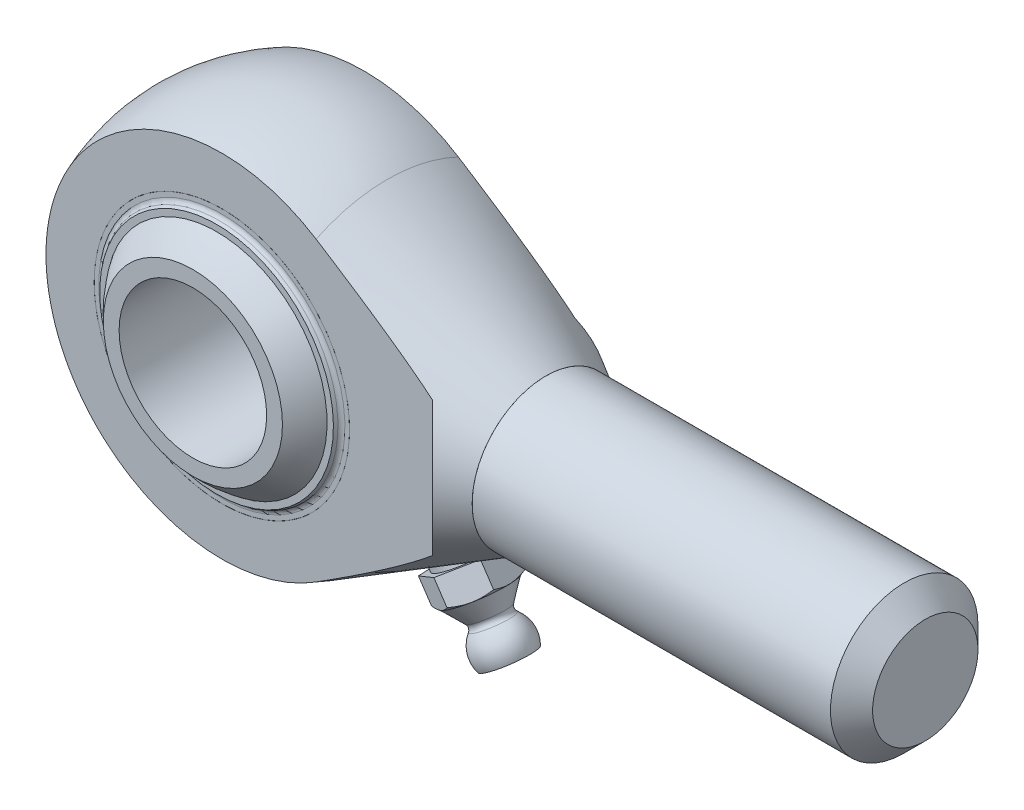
ISO-10303-21;
HEADER;
FILE_DESCRIPTION(('STEP AP214'),'2;1');
FILE_NAME('part.step','',(''),(''),'','','');
FILE_SCHEMA(('AUTOMOTIVE_DESIGN { 1 0 10303 214 1 1 1 1 }'));
ENDSEC;
DATA;
#1=APPLICATION_CONTEXT('core data for automotive mechanical design processes');
#2=APPLICATION_PROTOCOL_DEFINITION('international standard','automotive_design',2000,#1);
#3=PRODUCT_CONTEXT('',#1,'mechanical');
#4=PRODUCT('Part','Part','',(#3));
#5=PRODUCT_RELATED_PRODUCT_CATEGORY('part','',(#4));
#6=PRODUCT_DEFINITION_FORMATION('','',#4);
#7=PRODUCT_DEFINITION_CONTEXT('part definition',#1,'design');
#8=PRODUCT_DEFINITION('design','',#6,#7);
#9=PRODUCT_DEFINITION_SHAPE('','',#8);
#10=(LENGTH_UNIT() NAMED_UNIT(*) SI_UNIT(.MILLI.,.METRE.));
#11=(NAMED_UNIT(*) PLANE_ANGLE_UNIT() SI_UNIT($,.RADIAN.));
#12=(NAMED_UNIT(*) SI_UNIT($,.STERADIAN.) SOLID_ANGLE_UNIT());
#13=UNCERTAINTY_MEASURE_WITH_UNIT(LENGTH_MEASURE(1.E-05),#10,'distance_accuracy_value','');
#14=(GEOMETRIC_REPRESENTATION_CONTEXT(3) GLOBAL_UNCERTAINTY_ASSIGNED_CONTEXT((#13)) GLOBAL_UNIT_ASSIGNED_CONTEXT((#10,
#11,#12)) REPRESENTATION_CONTEXT('',''));
#15=CARTESIAN_POINT('',(0.,0.,0.));
#16=DIRECTION('',(0.,0.,1.));
#17=DIRECTION('',(1.,0.,0.));
#18=AXIS2_PLACEMENT_3D('',#15,#16,#17);
#19=CARTESIAN_POINT('',(-4.13038034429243,-12.7120035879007,1.87849571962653));
#20=DIRECTION('',(0.306009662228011,0.941800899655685,-0.139173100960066));
#21=DIRECTION('',(-0.0430068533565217,-0.132361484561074,-0.99026806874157));
#22=AXIS2_PLACEMENT_3D('',#19,#20,#21);
#23=SPHERICAL_SURFACE('',#22,1.5);
#24=CARTESIAN_POINT('',(-3.67136585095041,-11.2993022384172,1.66973606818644));
#25=VERTEX_POINT('',#24);
#26=VERTEX_LOOP('',#25);
#27=FACE_BOUND('',#26,.T.);
#28=ADVANCED_FACE('P0_F12',(#27),#23,.T.);
#29=CLOSED_SHELL('',(#28));
#30=MANIFOLD_SOLID_BREP('P0_B1',#29);
#31=CARTESIAN_POINT('',(0.,13.3661915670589,1.87849571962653));
#32=DIRECTION('',(0.,-0.99026806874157,-0.139173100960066));
#33=DIRECTION('',(0.,0.139173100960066,-0.99026806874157));
#34=AXIS2_PLACEMENT_3D('',#31,#32,#33);
#35=SPHERICAL_SURFACE('',#34,1.5);
#36=CARTESIAN_POINT('',(0.,11.8807894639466,1.66973606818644));
#37=VERTEX_POINT('',#36);
#38=VERTEX_LOOP('',#37);
#39=FACE_BOUND('',#38,.T.);
#40=ADVANCED_FACE('P1_F12',(#39),#35,.T.);
#41=CLOSED_SHELL('',(#40));
#42=MANIFOLD_SOLID_BREP('P1_B1',#41);
#43=CARTESIAN_POINT('',(4.13038034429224,-12.7120035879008,-1.87849571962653));
#44=DIRECTION('',(-0.306009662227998,0.94180089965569,0.139173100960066));
#45=DIRECTION('',(0.0430068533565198,-0.132361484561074,0.99026806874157));
#46=AXIS2_PLACEMENT_3D('',#43,#44,#45);
#47=SPHERICAL_SURFACE('',#46,1.5);
#48=CARTESIAN_POINT('',(3.67136585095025,-11.2993022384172,-1.66973606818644));
#49=VERTEX_POINT('',#48);
#50=VERTEX_LOOP('',#49);
#51=FACE_BOUND('',#50,.T.);
#52=ADVANCED_FACE('P2_F12',(#51),#47,.T.);
#53=CLOSED_SHELL('',(#52));
#54=MANIFOLD_SOLID_BREP('P2_B1',#53);
#55=CARTESIAN_POINT('',(0.,0.,0.));
#56=DIRECTION('',(0.,0.,1.));
#57=DIRECTION('',(0.999027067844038,0.044101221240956,0.));
#58=AXIS2_PLACEMENT_3D('',#55,#56,#57);
#59=CYLINDRICAL_SURFACE('',#58,12.12);
#60=CARTESIAN_POINT('',(0.,0.,-6.75));
#61=DIRECTION('',(0.,0.,1.));
#62=DIRECTION('',(0.999027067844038,0.044101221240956,0.));
#63=AXIS2_PLACEMENT_3D('',#60,#61,#62);
#64=CIRCLE('',#63,12.12);
#65=CARTESIAN_POINT('',(12.1082080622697,0.534506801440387,-6.75));
#66=VERTEX_POINT('',#65);
#67=EDGE_CURVE('P3_E34',#66,#66,#64,.T.);
#68=ORIENTED_EDGE('',*,*,#67,.T.);
#69=EDGE_LOOP('',(#68));
#70=FACE_BOUND('',#69,.T.);
#71=CARTESIAN_POINT('',(0.,0.,-6.25));
#72=DIRECTION('',(0.,0.,1.));
#73=DIRECTION('',(0.999027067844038,0.044101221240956,0.));
#74=AXIS2_PLACEMENT_3D('',#71,#72,#73);
#75=CIRCLE('',#74,12.12);
#76=CARTESIAN_POINT('',(12.1082080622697,0.534506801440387,-6.25));
#77=VERTEX_POINT('',#76);
#78=EDGE_CURVE('P3_E43',#77,#77,#75,.T.);
#79=ORIENTED_EDGE('',*,*,#78,.F.);
#80=EDGE_LOOP('',(#79));
#81=FACE_BOUND('',#80,.T.);
#82=ADVANCED_FACE('P3_F14',(#70,#81),#59,.T.);
#83=CARTESIAN_POINT('',(-0.534506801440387,12.1082080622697,-6.75));
#84=DIRECTION('',(0.,0.,-1.));
#85=DIRECTION('',(-0.999027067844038,-0.044101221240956,0.));
#86=AXIS2_PLACEMENT_3D('',#83,#84,#85);
#87=PLANE('',#86);
#88=CARTESIAN_POINT('',(0.,0.,-6.75));
#89=DIRECTION('',(0.,0.,-1.));
#90=DIRECTION('',(-0.999027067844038,-0.044101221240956,0.));
#91=AXIS2_PLACEMENT_3D('',#88,#89,#90);
#92=CIRCLE('',#91,11.680436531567);
#93=CARTESIAN_POINT('',(-11.6690722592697,-0.515121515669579,-6.75));
#94=VERTEX_POINT('',#93);
#95=EDGE_CURVE('P3_E21',#94,#94,#92,.F.);
#96=ORIENTED_EDGE('',*,*,#95,.T.);
#97=EDGE_LOOP('',(#96));
#98=FACE_BOUND('',#97,.T.);
#99=ORIENTED_EDGE('',*,*,#67,.F.);
#100=EDGE_LOOP('',(#99));
#101=FACE_BOUND('',#100,.T.);
#102=ADVANCED_FACE('P3_F50',(#98,#101),#87,.T.);
#103=CARTESIAN_POINT('',(0.,0.,0.));
#104=DIRECTION('',(0.,0.,1.));
#105=DIRECTION('',(-0.044101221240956,0.999027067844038,0.));
#106=AXIS2_PLACEMENT_3D('',#103,#104,#105);
#107=SPHERICAL_SURFACE('',#106,13.247548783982);
#108=CARTESIAN_POINT('',(0.,0.,-6.98631662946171));
#109=DIRECTION('',(0.,0.,1.));
#110=DIRECTION('',(0.999027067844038,0.044101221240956,0.));
#111=AXIS2_PLACEMENT_3D('',#108,#109,#110);
#112=CIRCLE('',#111,11.2556176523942);
#113=CARTESIAN_POINT('',(-0.496386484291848,11.244666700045,-6.98631662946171));
#114=VERTEX_POINT('',#113);
#115=EDGE_CURVE('P3_E10',#114,#114,#112,.F.);
#116=CARTESIAN_POINT('',(0.,0.,-7.25));
#117=DIRECTION('',(0.,0.,1.));
#118=DIRECTION('',(0.999027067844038,0.044101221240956,0.));
#119=AXIS2_PLACEMENT_3D('',#116,#117,#118);
#120=CIRCLE('',#119,11.0876078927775);
#121=CARTESIAN_POINT('',(-0.48897704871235,11.0768204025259,-7.25));
#122=VERTEX_POINT('',#121);
#123=EDGE_CURVE('P3_E37',#122,#122,#120,.T.);
#124=CARTESIAN_POINT('',(-0.496386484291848,11.244666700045,-6.98631662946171));
#125=CARTESIAN_POINT('',(-0.496310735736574,11.2429507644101,-6.98908385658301));
#126=CARTESIAN_POINT('',(-0.496234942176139,11.2412338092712,-6.99185045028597));
#127=CARTESIAN_POINT('',(-0.496083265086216,11.2377978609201,-6.99738236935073));
#128=CARTESIAN_POINT('',(-0.496007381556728,11.2360788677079,-7.00014769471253));
#129=CARTESIAN_POINT('',(-0.49585552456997,11.2326388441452,-7.00567707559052));
#130=CARTESIAN_POINT('',(-0.4957795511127,11.2309178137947,-7.0084411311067));
#131=CARTESIAN_POINT('',(-0.495627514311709,11.2274737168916,-7.01396797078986));
#132=CARTESIAN_POINT('',(-0.495551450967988,11.225750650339,-7.01673075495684));
#133=CARTESIAN_POINT('',(-0.495399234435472,11.2223024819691,-7.02225505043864));
#134=CARTESIAN_POINT('',(-0.495323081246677,11.2205773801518,-7.02501656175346));
#135=CARTESIAN_POINT('',(-0.495170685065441,11.2171251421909,-7.03053831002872));
#136=CARTESIAN_POINT('',(-0.495094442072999,11.2153980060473,-7.03329854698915));
#137=CARTESIAN_POINT('',(-0.494941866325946,11.2119417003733,-7.03881774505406));
#138=CARTESIAN_POINT('',(-0.494865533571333,11.210212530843,-7.04157670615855));
#139=CARTESIAN_POINT('',(-0.494712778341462,11.2067521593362,-7.04709335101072));
#140=CARTESIAN_POINT('',(-0.494636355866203,11.2050209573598,-7.0498510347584));
#141=CARTESIAN_POINT('',(-0.494483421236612,11.2015565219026,-7.05536512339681));
#142=CARTESIAN_POINT('',(-0.49440690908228,11.1998232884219,-7.05812152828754));
#143=CARTESIAN_POINT('',(-0.494253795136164,11.1963547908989,-7.06363305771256));
#144=CARTESIAN_POINT('',(-0.494177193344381,11.1946195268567,-7.06638818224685));
#145=CARTESIAN_POINT('',(-0.494023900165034,11.1911469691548,-7.07189714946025));
#146=CARTESIAN_POINT('',(-0.49394720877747,11.1894096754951,-7.07465099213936));
#147=CARTESIAN_POINT('',(-0.493793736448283,11.1859330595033,-7.08015739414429));
#148=CARTESIAN_POINT('',(-0.493716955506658,11.1841937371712,-7.08290995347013));
#149=CARTESIAN_POINT('',(-0.493563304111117,11.1807130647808,-7.08841378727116));
#150=CARTESIAN_POINT('',(-0.493486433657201,11.1789717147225,-7.09116506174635));
#151=CARTESIAN_POINT('',(-0.493332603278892,11.1754869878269,-7.09666632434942));
#152=CARTESIAN_POINT('',(-0.4932556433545,11.1737436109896,-7.0994163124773));
#153=CARTESIAN_POINT('',(-0.493101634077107,11.1702548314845,-7.10491500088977));
#154=CARTESIAN_POINT('',(-0.493024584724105,11.1685094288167,-7.10766370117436));
#155=CARTESIAN_POINT('',(-0.492870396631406,11.1650165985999,-7.11315981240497));
#156=CARTESIAN_POINT('',(-0.492793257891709,11.163269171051,-7.115907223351));
#157=CARTESIAN_POINT('',(-0.492638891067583,11.1597722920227,-7.12140075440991));
#158=CARTESIAN_POINT('',(-0.492561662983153,11.1580228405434,-7.1241468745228));
#159=CARTESIAN_POINT('',(-0.492407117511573,11.1545219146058,-7.12963782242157));
#160=CARTESIAN_POINT('',(-0.492329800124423,11.1527704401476,-7.13238265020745));
#161=CARTESIAN_POINT('',(-0.492175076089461,11.1492654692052,-7.13787101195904));
#162=CARTESIAN_POINT('',(-0.49209766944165,11.147511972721,-7.14061454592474));
#163=CARTESIAN_POINT('',(-0.491942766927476,11.1440029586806,-7.14610031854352));
#164=CARTESIAN_POINT('',(-0.491865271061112,11.1422474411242,-7.14884255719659));
#165=CARTESIAN_POINT('',(-0.491710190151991,11.1387343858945,-7.15432573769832));
#166=CARTESIAN_POINT('',(-0.491632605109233,11.1369768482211,-7.15706667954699));
#167=CARTESIAN_POINT('',(-0.491477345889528,11.1334597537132,-7.16254726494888));
#168=CARTESIAN_POINT('',(-0.491399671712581,11.1317001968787,-7.1652869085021));
#169=CARTESIAN_POINT('',(-0.491244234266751,11.128179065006,-7.17076489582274));
#170=CARTESIAN_POINT('',(-0.491166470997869,11.1264174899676,-7.17350323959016));
#171=CARTESIAN_POINT('',(-0.491010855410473,11.1228923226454,-7.17897862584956));
#172=CARTESIAN_POINT('',(-0.490933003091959,11.1211287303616,-7.18171566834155));
#173=CARTESIAN_POINT('',(-0.490777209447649,11.1175995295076,-7.18718845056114));
#174=CARTESIAN_POINT('',(-0.490699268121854,11.1158339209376,-7.18992419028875));
#175=CARTESIAN_POINT('',(-0.490543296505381,11.1123006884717,-7.19539436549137));
#176=CARTESIAN_POINT('',(-0.490465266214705,11.110533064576,-7.19812880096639));
#177=CARTESIAN_POINT('',(-0.490309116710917,11.1069958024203,-7.20359636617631));
#178=CARTESIAN_POINT('',(-0.490230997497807,11.1052261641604,-7.20632949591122));
#179=CARTESIAN_POINT('',(-0.490074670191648,11.1016848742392,-7.21179444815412));
#180=CARTESIAN_POINT('',(-0.489996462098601,11.0999132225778,-7.21452627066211));
#181=CARTESIAN_POINT('',(-0.489839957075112,11.0963679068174,-7.21998860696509));
#182=CARTESIAN_POINT('',(-0.489761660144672,11.0945942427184,-7.22271912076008));
#183=CARTESIAN_POINT('',(-0.489604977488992,11.0910449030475,-7.22817883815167));
#184=CARTESIAN_POINT('',(-0.489526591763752,11.0892692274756,-7.23090804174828));
#185=CARTESIAN_POINT('',(-0.489369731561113,11.085715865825,-7.23636513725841));
#186=CARTESIAN_POINT('',(-0.489291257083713,11.0839381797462,-7.23909302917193));
#187=CARTESIAN_POINT('',(-0.489134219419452,11.080380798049,-7.24454749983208));
#188=CARTESIAN_POINT('',(-0.489055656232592,11.0786011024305,-7.24727407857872));
#189=CARTESIAN_POINT('',(-0.48897704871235,11.0768204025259,-7.25));
#190=B_SPLINE_CURVE_WITH_KNOTS('',3,(#124,#125,#126,#127,#128,#129,#130,#131,#132,#133,#134,
#135,#136,#137,#138,#139,#140,#141,#142,#143,#144,#145,#146,#147,#148,#149,#150,#151,#152,#153,
#154,#155,#156,#157,#158,#159,#160,#161,#162,#163,#164,#165,#166,#167,#168,#169,#170,#171,#172,
#173,#174,#175,#176,#177,#178,#179,#180,#181,#182,#183,#184,#185,#186,#187,#188,#189),
.UNSPECIFIED.,.F.,.F.,(4,2,2,2,2,2,2,2,2,2,2,2,2,2,2,2,2,2,2,2,2,2,2,2,2,2,2,2,2,2,2,2,4),(0.,
0.00977084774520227,0.0195416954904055,0.0293125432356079,0.0390833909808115,0.0488542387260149,
0.0586250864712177,0.0683959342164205,0.0781667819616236,0.0879376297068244,0.0977084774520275,
0.107479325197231,0.117250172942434,0.127021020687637,0.136791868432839,0.146562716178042,
0.156333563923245,0.166104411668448,0.175875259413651,0.185646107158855,0.195416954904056,
0.20518780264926,0.214958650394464,0.224729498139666,0.234500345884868,0.24427119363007,
0.254042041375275,0.263812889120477,0.273583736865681,0.283354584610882,0.293125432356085,
0.302896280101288,0.312667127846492),.UNSPECIFIED.);
#191=EDGE_CURVE('P3_BSEAM57',#114,#122,#190,.T.);
#192=ORIENTED_EDGE('',*,*,#115,.T.);
#193=ORIENTED_EDGE('',*,*,#123,.T.);
#194=ORIENTED_EDGE('',*,*,#191,.T.);
#195=ORIENTED_EDGE('',*,*,#191,.F.);
#196=EDGE_LOOP('',(#192,#194,#193,#195));
#197=FACE_BOUND('',#196,.T.);
#198=ADVANCED_FACE('P3_F57',(#197),#107,.T.);
#199=CARTESIAN_POINT('',(-0.462406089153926,10.4749071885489,-7.25));
#200=DIRECTION('',(0.,0.,-1.));
#201=DIRECTION('',(-0.999027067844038,-0.044101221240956,0.));
#202=AXIS2_PLACEMENT_3D('',#199,#200,#201);
#203=PLANE('',#202);
#204=CARTESIAN_POINT('',(0.,0.,-7.25));
#205=DIRECTION('',(0.,0.,1.));
#206=DIRECTION('',(0.999027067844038,0.044101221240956,0.));
#207=AXIS2_PLACEMENT_3D('',#204,#205,#206);
#208=CIRCLE('',#207,10.4851084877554);
#209=CARTESIAN_POINT('',(-0.462406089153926,10.4749071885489,-7.25));
#210=VERTEX_POINT('',#209);
#211=EDGE_CURVE('P3_E40',#210,#210,#208,.T.);
#212=ORIENTED_EDGE('',*,*,#211,.T.);
#213=EDGE_LOOP('',(#212));
#214=FACE_BOUND('',#213,.T.);
#215=ORIENTED_EDGE('',*,*,#123,.F.);
#216=EDGE_LOOP('',(#215));
#217=FACE_BOUND('',#216,.T.);
#218=ADVANCED_FACE('P3_F77',(#214,#217),#203,.T.);
#219=CARTESIAN_POINT('',(0.,0.,0.));
#220=DIRECTION('',(0.,0.,1.));
#221=DIRECTION('',(-0.044101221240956,0.999027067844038,0.));
#222=AXIS2_PLACEMENT_3D('',#219,#220,#221);
#223=SPHERICAL_SURFACE('',#222,12.747548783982);
#224=CARTESIAN_POINT('',(0.,0.,-6.49523588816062));
#225=DIRECTION('',(0.,0.,1.));
#226=DIRECTION('',(0.999027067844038,0.044101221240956,0.));
#227=AXIS2_PLACEMENT_3D('',#224,#225,#226);
#228=CIRCLE('',#227,10.9686786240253);
#229=CARTESIAN_POINT('',(-0.483732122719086,10.9580068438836,-6.49523588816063));
#230=VERTEX_POINT('',#229);
#231=EDGE_CURVE('P3_E29',#230,#230,#228,.T.);
#232=CARTESIAN_POINT('',(-0.483732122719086,10.9580068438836,-6.49523588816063));
#233=CARTESIAN_POINT('',(-0.483522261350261,10.9532528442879,-6.50327191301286));
#234=CARTESIAN_POINT('',(-0.483312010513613,10.948490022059,-6.51130270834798));
#235=CARTESIAN_POINT('',(-0.482890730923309,10.9389467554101,-6.52735380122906));
#236=CARTESIAN_POINT('',(-0.482679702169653,10.9341663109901,-6.53537409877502));
#237=CARTESIAN_POINT('',(-0.48225686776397,10.9245878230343,-6.55140415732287));
#238=CARTESIAN_POINT('',(-0.482045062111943,10.9197897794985,-6.55941391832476));
#239=CARTESIAN_POINT('',(-0.481620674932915,10.910176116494,-6.57542286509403));
#240=CARTESIAN_POINT('',(-0.481408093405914,10.9053604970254,-6.58342205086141));
#241=CARTESIAN_POINT('',(-0.480982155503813,10.8957117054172,-6.59940980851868));
#242=CARTESIAN_POINT('',(-0.480768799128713,10.8908785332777,-6.60739838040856));
#243=CARTESIAN_POINT('',(-0.480341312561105,10.8811946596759,-6.62336487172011));
#244=CARTESIAN_POINT('',(-0.480127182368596,10.8763439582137,-6.63134279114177));
#245=CARTESIAN_POINT('',(-0.479698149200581,10.8666250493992,-6.64728793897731));
#246=CARTESIAN_POINT('',(-0.479483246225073,10.8617568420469,-6.6552551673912));
#247=CARTESIAN_POINT('',(-0.479052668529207,10.8520029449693,-6.67117889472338));
#248=CARTESIAN_POINT('',(-0.478836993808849,10.847117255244,-6.67913539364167));
#249=CARTESIAN_POINT('',(-0.478404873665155,10.8373284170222,-6.69503762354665));
#250=CARTESIAN_POINT('',(-0.478188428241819,10.8324252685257,-6.70298335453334));
#251=CARTESIAN_POINT('',(-0.477754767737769,10.8226015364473,-6.71886401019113));
#252=CARTESIAN_POINT('',(-0.477537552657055,10.8176809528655,-6.72679893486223));
#253=CARTESIAN_POINT('',(-0.477102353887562,10.8078223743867,-6.74265793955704));
#254=CARTESIAN_POINT('',(-0.476884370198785,10.8028843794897,-6.75058201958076));
#255=CARTESIAN_POINT('',(-0.476447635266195,10.792991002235,-6.76641929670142));
#256=CARTESIAN_POINT('',(-0.476228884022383,10.7880356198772,-6.77433249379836));
#257=CARTESIAN_POINT('',(-0.475790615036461,10.7781074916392,-6.79014796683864));
#258=CARTESIAN_POINT('',(-0.475571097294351,10.773134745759,-6.79805024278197));
#259=CARTESIAN_POINT('',(-0.475131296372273,10.7631719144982,-6.81384383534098));
#260=CARTESIAN_POINT('',(-0.474911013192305,10.7581818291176,-6.82173515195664));
#261=CARTESIAN_POINT('',(-0.474469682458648,10.7481843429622,-6.83750678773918));
#262=CARTESIAN_POINT('',(-0.474248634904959,10.7431769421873,-6.84538710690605));
#263=CARTESIAN_POINT('',(-0.473805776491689,10.7331448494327,-6.86113670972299));
#264=CARTESIAN_POINT('',(-0.473583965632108,10.7281201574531,-6.86900599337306));
#265=CARTESIAN_POINT('',(-0.473139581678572,10.7180535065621,-6.88473348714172));
#266=CARTESIAN_POINT('',(-0.472917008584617,10.7130115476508,-6.8925916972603));
#267=CARTESIAN_POINT('',(-0.472471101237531,10.7029103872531,-6.90829700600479));
#268=CARTESIAN_POINT('',(-0.4722477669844,10.6978511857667,-6.91614410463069));
#269=CARTESIAN_POINT('',(-0.47180033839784,10.6877155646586,-6.93182715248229));
#270=CARTESIAN_POINT('',(-0.47157624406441,10.682639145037,-6.939663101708));
#271=CARTESIAN_POINT('',(-0.471127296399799,10.6724691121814,-6.95532381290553));
#272=CARTESIAN_POINT('',(-0.470902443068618,10.6673754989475,-6.96314857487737));
#273=CARTESIAN_POINT('',(-0.470451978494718,10.6571711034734,-6.97878687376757));
#274=CARTESIAN_POINT('',(-0.470226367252,10.6520603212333,-6.98660041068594));
#275=CARTESIAN_POINT('',(-0.469774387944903,10.6418216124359,-7.00221622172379));
#276=CARTESIAN_POINT('',(-0.469548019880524,10.6366936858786,-7.01001849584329));
#277=CARTESIAN_POINT('',(-0.469094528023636,10.6264207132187,-7.02561174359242));
#278=CARTESIAN_POINT('',(-0.468867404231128,10.6212756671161,-7.03340271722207));
#279=CARTESIAN_POINT('',(-0.468412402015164,10.61096848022,-7.04897332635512));
#280=CARTESIAN_POINT('',(-0.468184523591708,10.6058063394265,-7.05675296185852));
#281=CARTESIAN_POINT('',(-0.467728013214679,10.5954649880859,-7.07230085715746));
#282=CARTESIAN_POINT('',(-0.467499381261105,10.5902857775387,-7.080069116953));
#283=CARTESIAN_POINT('',(-0.467041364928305,10.5799103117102,-7.09559422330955));
#284=CARTESIAN_POINT('',(-0.466811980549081,10.5747140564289,-7.10335106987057));
#285=CARTESIAN_POINT('',(-0.466352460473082,10.564304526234,-7.11885331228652));
#286=CARTESIAN_POINT('',(-0.466122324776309,10.5590912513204,-7.12659870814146));
#287=CARTESIAN_POINT('',(-0.46566130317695,10.5486477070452,-7.14207801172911));
#288=CARTESIAN_POINT('',(-0.465430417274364,10.5434174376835,-7.14981191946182));
#289=CARTESIAN_POINT('',(-0.464967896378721,10.5329399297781,-7.16526820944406));
#290=CARTESIAN_POINT('',(-0.464736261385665,10.5276926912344,-7.17299059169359));
#291=CARTESIAN_POINT('',(-0.464272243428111,10.5171812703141,-7.18842379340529));
#292=CARTESIAN_POINT('',(-0.464039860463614,10.5119170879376,-7.19613461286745));
#293=CARTESIAN_POINT('',(-0.463574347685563,10.5013718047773,-7.21154465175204));
#294=CARTESIAN_POINT('',(-0.463341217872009,10.4960907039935,-7.21924387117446));
#295=CARTESIAN_POINT('',(-0.462874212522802,10.4855116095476,-7.2346306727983));
#296=CARTESIAN_POINT('',(-0.462640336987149,10.4802136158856,-7.24231825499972));
#297=CARTESIAN_POINT('',(-0.462406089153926,10.4749071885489,-7.25));
#298=B_SPLINE_CURVE_WITH_KNOTS('',3,(#232,#233,#234,#235,#236,#237,#238,#239,#240,#241,#242,
#243,#244,#245,#246,#247,#248,#249,#250,#251,#252,#253,#254,#255,#256,#257,#258,#259,#260,#261,
#262,#263,#264,#265,#266,#267,#268,#269,#270,#271,#272,#273,#274,#275,#276,#277,#278,#279,#280,
#281,#282,#283,#284,#285,#286,#287,#288,#289,#290,#291,#292,#293,#294,#295,#296,#297),
.UNSPECIFIED.,.F.,.F.,(4,2,2,2,2,2,2,2,2,2,2,2,2,2,2,2,2,2,2,2,2,2,2,2,2,2,2,2,2,2,2,2,4),(0.,
0.0280178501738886,0.0560357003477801,0.0840535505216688,0.112071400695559,0.140089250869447,
0.168107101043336,0.196124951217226,0.224142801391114,0.252160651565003,0.280178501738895,
0.308196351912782,0.336214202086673,0.364232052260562,0.392249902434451,0.42026775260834,
0.448285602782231,0.476303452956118,0.504321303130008,0.532339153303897,0.560357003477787,
0.588374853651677,0.616392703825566,0.644410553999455,0.672428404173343,0.700446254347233,
0.728464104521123,0.756481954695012,0.7844998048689,0.812517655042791,0.840535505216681,
0.86855335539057,0.896571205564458),.UNSPECIFIED.);
#299=EDGE_CURVE('P3_BSEAM68',#230,#210,#298,.T.);
#300=ORIENTED_EDGE('',*,*,#231,.T.);
#301=ORIENTED_EDGE('',*,*,#211,.F.);
#302=ORIENTED_EDGE('',*,*,#299,.T.);
#303=ORIENTED_EDGE('',*,*,#299,.F.);
#304=EDGE_LOOP('',(#300,#302,#301,#303));
#305=FACE_BOUND('',#304,.T.);
#306=ADVANCED_FACE('P3_F68',(#305),#223,.F.);
#307=CARTESIAN_POINT('',(-0.534506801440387,12.1082080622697,-6.25));
#308=DIRECTION('',(0.,0.,1.));
#309=DIRECTION('',(0.999027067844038,0.044101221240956,0.));
#310=AXIS2_PLACEMENT_3D('',#307,#308,#309);
#311=PLANE('',#310);
#312=CARTESIAN_POINT('',(0.,0.,-6.25));
#313=DIRECTION('',(0.,0.,1.));
#314=DIRECTION('',(0.999027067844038,0.044101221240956,0.));
#315=AXIS2_PLACEMENT_3D('',#312,#313,#314);
#316=CIRCLE('',#315,11.3989055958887);
#317=CARTESIAN_POINT('',(11.3878152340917,0.502705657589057,-6.25));
#318=VERTEX_POINT('',#317);
#319=EDGE_CURVE('P3_E25',#318,#318,#316,.F.);
#320=ORIENTED_EDGE('',*,*,#319,.T.);
#321=EDGE_LOOP('',(#320));
#322=FACE_BOUND('',#321,.T.);
#323=ORIENTED_EDGE('',*,*,#78,.T.);
#324=EDGE_LOOP('',(#323));
#325=FACE_BOUND('',#324,.T.);
#326=ADVANCED_FACE('P3_F47',(#322,#325),#311,.T.);
#327=CARTESIAN_POINT('',(0.,0.,-6.75));
#328=DIRECTION('',(0.,0.,1.));
#329=DIRECTION('',(0.999027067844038,0.044101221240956,0.));
#330=AXIS2_PLACEMENT_3D('',#327,#328,#329);
#331=TOROIDAL_SURFACE('',#330,11.3989055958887,0.5);
#332=ORIENTED_EDGE('',*,*,#319,.F.);
#333=EDGE_LOOP('',(#332));
#334=FACE_BOUND('',#333,.T.);
#335=ORIENTED_EDGE('',*,*,#231,.F.);
#336=EDGE_LOOP('',(#335));
#337=FACE_BOUND('',#336,.T.);
#338=ADVANCED_FACE('P3_F60',(#334,#337),#331,.T.);
#339=CARTESIAN_POINT('',(0.,0.,-7.25));
#340=DIRECTION('',(0.,0.,-1.));
#341=DIRECTION('',(-0.999027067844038,-0.044101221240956,0.));
#342=AXIS2_PLACEMENT_3D('',#339,#340,#341);
#343=TOROIDAL_SURFACE('',#342,11.680436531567,0.5);
#344=ORIENTED_EDGE('',*,*,#115,.F.);
#345=EDGE_LOOP('',(#344));
#346=FACE_BOUND('',#345,.T.);
#347=ORIENTED_EDGE('',*,*,#95,.F.);
#348=EDGE_LOOP('',(#347));
#349=FACE_BOUND('',#348,.T.);
#350=ADVANCED_FACE('P3_F16',(#346,#349),#343,.F.);
#351=CLOSED_SHELL('',(#82,#102,#198,#218,#306,#326,#338,#350));
#352=MANIFOLD_SOLID_BREP('P3_B1',#351);
#353=CARTESIAN_POINT('',(-7.85645028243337,-10.8134761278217,1.87849571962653));
#354=DIRECTION('',(0.582064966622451,0.801143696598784,-0.139173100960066));
#355=DIRECTION('',(-0.0818038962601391,-0.112593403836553,-0.99026806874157));
#356=AXIS2_PLACEMENT_3D('',#353,#354,#355);
#357=SPHERICAL_SURFACE('',#356,1.5);
#358=CARTESIAN_POINT('',(-6.98335283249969,-9.61176058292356,1.66973606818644));
#359=VERTEX_POINT('',#358);
#360=VERTEX_LOOP('',#359);
#361=FACE_BOUND('',#360,.T.);
#362=ADVANCED_FACE('P4_F12',(#361),#357,.T.);
#363=CLOSED_SHELL('',(#362));
#364=MANIFOLD_SOLID_BREP('P4_B1',#363);
#365=CARTESIAN_POINT('',(4.13038034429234,12.7120035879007,1.87849571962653));
#366=DIRECTION('',(-0.306009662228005,-0.941800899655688,-0.139173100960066));
#367=DIRECTION('',(0.0430068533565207,0.132361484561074,-0.99026806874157));
#368=AXIS2_PLACEMENT_3D('',#365,#366,#367);
#369=SPHERICAL_SURFACE('',#368,1.5);
#370=CARTESIAN_POINT('',(3.67136585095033,11.2993022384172,1.66973606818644));
#371=VERTEX_POINT('',#370);
#372=VERTEX_LOOP('',#371);
#373=FACE_BOUND('',#372,.T.);
#374=ADVANCED_FACE('P5_F12',(#373),#369,.T.);
#375=CLOSED_SHELL('',(#374));
#376=MANIFOLD_SOLID_BREP('P5_B1',#375);
#377=CARTESIAN_POINT('',(0.,-13.3661915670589,-1.87849571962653));
#378=DIRECTION('',(0.,0.99026806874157,0.139173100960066));
#379=DIRECTION('',(0.,-0.139173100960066,0.99026806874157));
#380=AXIS2_PLACEMENT_3D('',#377,#378,#379);
#381=SPHERICAL_SURFACE('',#380,1.5);
#382=CARTESIAN_POINT('',(0.,-11.8807894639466,-1.66973606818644));
#383=VERTEX_POINT('',#382);
#384=VERTEX_LOOP('',#383);
#385=FACE_BOUND('',#384,.T.);
#386=ADVANCED_FACE('P6_F12',(#385),#381,.T.);
#387=CLOSED_SHELL('',(#386));
#388=MANIFOLD_SOLID_BREP('P6_B1',#387);
#389=CARTESIAN_POINT('',(-10.8134761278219,-7.85645028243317,1.87849571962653));
#390=DIRECTION('',(0.801143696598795,0.582064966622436,-0.139173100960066));
#391=DIRECTION('',(-0.112593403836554,-0.081803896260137,-0.99026806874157));
#392=AXIS2_PLACEMENT_3D('',#389,#390,#391);
#393=SPHERICAL_SURFACE('',#392,1.5);
#394=CARTESIAN_POINT('',(-9.61176058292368,-6.98335283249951,1.66973606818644));
#395=VERTEX_POINT('',#394);
#396=VERTEX_LOOP('',#395);
#397=FACE_BOUND('',#396,.T.);
#398=ADVANCED_FACE('P7_F12',(#397),#393,.T.);
#399=CLOSED_SHELL('',(#398));
#400=MANIFOLD_SOLID_BREP('P7_B1',#399);
#401=CARTESIAN_POINT('',(7.85645028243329,10.8134761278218,1.87849571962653));
#402=DIRECTION('',(-0.582064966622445,-0.801143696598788,-0.139173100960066));
#403=DIRECTION('',(0.0818038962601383,0.112593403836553,-0.99026806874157));
#404=AXIS2_PLACEMENT_3D('',#401,#402,#403);
#405=SPHERICAL_SURFACE('',#404,1.5);
#406=CARTESIAN_POINT('',(6.98335283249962,9.61176058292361,1.66973606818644));
#407=VERTEX_POINT('',#406);
#408=VERTEX_LOOP('',#407);
#409=FACE_BOUND('',#408,.T.);
#410=ADVANCED_FACE('P8_F12',(#409),#405,.T.);
#411=CLOSED_SHELL('',(#410));
#412=MANIFOLD_SOLID_BREP('P8_B1',#411);
#413=CARTESIAN_POINT('',(-4.13038034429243,-12.7120035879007,-1.87849571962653));
#414=DIRECTION('',(0.306009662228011,0.941800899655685,0.139173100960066));
#415=DIRECTION('',(-0.0430068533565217,-0.132361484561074,0.99026806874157));
#416=AXIS2_PLACEMENT_3D('',#413,#414,#415);
#417=SPHERICAL_SURFACE('',#416,1.5);
#418=CARTESIAN_POINT('',(-3.67136585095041,-11.2993022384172,-1.66973606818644));
#419=VERTEX_POINT('',#418);
#420=VERTEX_LOOP('',#419);
#421=FACE_BOUND('',#420,.T.);
#422=ADVANCED_FACE('P9_F12',(#421),#417,.T.);
#423=CLOSED_SHELL('',(#422));
#424=MANIFOLD_SOLID_BREP('P9_B1',#423);
#425=CARTESIAN_POINT('',(0.,0.,0.));
#426=DIRECTION('',(0.,1.,0.));
#427=DIRECTION('',(1.,0.,0.));
#428=AXIS2_PLACEMENT_3D('',#425,#426,#427);
#429=SPHERICAL_SURFACE('',#428,12.747548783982);
#430=CARTESIAN_POINT('',(0.,0.,0.));
#431=DIRECTION('',(0.,0.,1.));
#432=DIRECTION('',(1.,0.,0.));
#433=AXIS2_PLACEMENT_3D('',#430,#431,#432);
#434=SPHERICAL_SURFACE('',#433,12.747548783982);
#435=CARTESIAN_POINT('',(0.,0.,3.01402791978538));
#436=DIRECTION('',(0.,0.,1.));
#437=DIRECTION('',(1.,0.,0.));
#438=AXIS2_PLACEMENT_3D('',#435,#436,#437);
#439=CIRCLE('',#438,12.3861065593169);
#440=CARTESIAN_POINT('',(12.3861065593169,0.,3.01402791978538));
#441=VERTEX_POINT('',#440);
#442=EDGE_CURVE('P10_E18',#441,#441,#439,.F.);
#443=ORIENTED_EDGE('',*,*,#442,.F.);
#444=EDGE_LOOP('',(#443));
#445=FACE_BOUND('',#444,.T.);
#446=CARTESIAN_POINT('',(0.,0.,9.5));
#447=DIRECTION('',(0.,0.,-1.));
#448=DIRECTION('',(-1.,0.,0.));
#449=AXIS2_PLACEMENT_3D('',#446,#447,#448);
#450=CIRCLE('',#449,8.5);
#451=CARTESIAN_POINT('',(-8.5,0.,9.5));
#452=VERTEX_POINT('',#451);
#453=EDGE_CURVE('P10_E27',#452,#452,#450,.F.);
#454=ORIENTED_EDGE('',*,*,#453,.F.);
#455=EDGE_LOOP('',(#454));
#456=FACE_BOUND('',#455,.T.);
#457=ADVANCED_FACE('P10_F14',(#445,#456),#434,.T.);
#458=CARTESIAN_POINT('',(0.,0.,0.));
#459=DIRECTION('',(0.,0.,-1.));
#460=DIRECTION('',(-1.,0.,0.));
#461=AXIS2_PLACEMENT_3D('',#458,#459,#460);
#462=SPHERICAL_SURFACE('',#461,12.747548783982);
#463=CARTESIAN_POINT('',(0.,0.,-3.01402791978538));
#464=DIRECTION('',(0.,0.,-1.));
#465=DIRECTION('',(-1.,0.,0.));
#466=AXIS2_PLACEMENT_3D('',#463,#464,#465);
#467=CIRCLE('',#466,12.3861065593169);
#468=CARTESIAN_POINT('',(-12.3861065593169,0.,-3.01402791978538));
#469=VERTEX_POINT('',#468);
#470=EDGE_CURVE('P10_E34',#469,#469,#467,.F.);
#471=ORIENTED_EDGE('',*,*,#470,.F.);
#472=EDGE_LOOP('',(#471));
#473=FACE_BOUND('',#472,.T.);
#474=CARTESIAN_POINT('',(0.,0.,-9.5));
#475=DIRECTION('',(0.,0.,1.));
#476=DIRECTION('',(1.,0.,0.));
#477=AXIS2_PLACEMENT_3D('',#474,#475,#476);
#478=CIRCLE('',#477,8.5);
#479=CARTESIAN_POINT('',(8.5,0.,-9.5));
#480=VERTEX_POINT('',#479);
#481=EDGE_CURVE('P10_E10',#480,#480,#478,.F.);
#482=ORIENTED_EDGE('',*,*,#481,.F.);
#483=EDGE_LOOP('',(#482));
#484=FACE_BOUND('',#483,.T.);
#485=ADVANCED_FACE('P10_F50',(#473,#484),#462,.T.);
#486=CARTESIAN_POINT('',(0.,0.,0.));
#487=DIRECTION('',(0.,0.,-1.));
#488=DIRECTION('',(-1.,0.,0.));
#489=AXIS2_PLACEMENT_3D('',#486,#487,#488);
#490=SPHERICAL_SURFACE('',#489,12.747548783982);
#491=CARTESIAN_POINT('',(0.,0.,0.516804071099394));
#492=DIRECTION('',(0.,0.,-1.));
#493=DIRECTION('',(-1.,0.,0.));
#494=AXIS2_PLACEMENT_3D('',#491,#492,#493);
#495=CIRCLE('',#494,12.7370684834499);
#496=CARTESIAN_POINT('',(-12.7370684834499,0.,0.516804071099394));
#497=VERTEX_POINT('',#496);
#498=EDGE_CURVE('P10_E39',#497,#497,#495,.F.);
#499=ORIENTED_EDGE('',*,*,#498,.F.);
#500=EDGE_LOOP('',(#499));
#501=FACE_BOUND('',#500,.T.);
#502=CARTESIAN_POINT('',(0.,0.,-0.516804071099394));
#503=DIRECTION('',(0.,0.,1.));
#504=DIRECTION('',(1.,0.,0.));
#505=AXIS2_PLACEMENT_3D('',#502,#503,#504);
#506=CIRCLE('',#505,12.7370684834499);
#507=CARTESIAN_POINT('',(12.7370684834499,0.,-0.516804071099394));
#508=VERTEX_POINT('',#507);
#509=EDGE_CURVE('P10_E35',#508,#508,#506,.F.);
#510=ORIENTED_EDGE('',*,*,#509,.F.);
#511=EDGE_LOOP('',(#510));
#512=FACE_BOUND('',#511,.T.);
#513=ADVANCED_FACE('P10_F16',(#501,#512),#490,.T.);
#514=CARTESIAN_POINT('',(0.,0.,-12.747548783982));
#515=DIRECTION('',(0.,0.,1.));
#516=DIRECTION('',(1.,0.,0.));
#517=AXIS2_PLACEMENT_3D('',#514,#515,#516);
#518=CYLINDRICAL_SURFACE('',#517,7.);
#519=CARTESIAN_POINT('',(0.,0.,9.5));
#520=DIRECTION('',(0.,0.,-1.));
#521=DIRECTION('',(-1.,0.,0.));
#522=AXIS2_PLACEMENT_3D('',#519,#520,#521);
#523=CIRCLE('',#522,7.);
#524=CARTESIAN_POINT('',(-7.,0.,9.5));
#525=VERTEX_POINT('',#524);
#526=EDGE_CURVE('P10_E31',#525,#525,#523,.F.);
#527=ORIENTED_EDGE('',*,*,#526,.T.);
#528=EDGE_LOOP('',(#527));
#529=FACE_BOUND('',#528,.T.);
#530=CARTESIAN_POINT('',(0.,0.,-9.5));
#531=DIRECTION('',(0.,0.,1.));
#532=DIRECTION('',(1.,0.,0.));
#533=AXIS2_PLACEMENT_3D('',#530,#531,#532);
#534=CIRCLE('',#533,7.);
#535=CARTESIAN_POINT('',(7.,0.,-9.5));
#536=VERTEX_POINT('',#535);
#537=EDGE_CURVE('P10_E22',#536,#536,#534,.F.);
#538=ORIENTED_EDGE('',*,*,#537,.T.);
#539=EDGE_LOOP('',(#538));
#540=FACE_BOUND('',#539,.T.);
#541=ADVANCED_FACE('P10_F62',(#529,#540),#518,.F.);
#542=CARTESIAN_POINT('',(-12.747548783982,-12.747548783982,-9.5));
#543=DIRECTION('',(0.,0.,1.));
#544=DIRECTION('',(1.,0.,0.));
#545=AXIS2_PLACEMENT_3D('',#542,#543,#544);
#546=PLANE('',#545);
#547=ORIENTED_EDGE('',*,*,#481,.T.);
#548=EDGE_LOOP('',(#547));
#549=FACE_BOUND('',#548,.T.);
#550=ORIENTED_EDGE('',*,*,#537,.F.);
#551=EDGE_LOOP('',(#550));
#552=FACE_BOUND('',#551,.T.);
#553=ADVANCED_FACE('P10_F58',(#549,#552),#546,.F.);
#554=CARTESIAN_POINT('',(-12.747548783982,-12.747548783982,9.5));
#555=DIRECTION('',(0.,0.,-1.));
#556=DIRECTION('',(-1.,0.,0.));
#557=AXIS2_PLACEMENT_3D('',#554,#555,#556);
#558=PLANE('',#557);
#559=ORIENTED_EDGE('',*,*,#453,.T.);
#560=EDGE_LOOP('',(#559));
#561=FACE_BOUND('',#560,.T.);
#562=ORIENTED_EDGE('',*,*,#526,.F.);
#563=EDGE_LOOP('',(#562));
#564=FACE_BOUND('',#563,.T.);
#565=ADVANCED_FACE('P10_F54',(#561,#564),#558,.F.);
#566=CARTESIAN_POINT('',(0.,0.,-1.87849571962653));
#567=DIRECTION('',(0.,0.,-1.));
#568=DIRECTION('',(-1.,0.,0.));
#569=AXIS2_PLACEMENT_3D('',#566,#567,#568);
#570=TOROIDAL_SURFACE('',#569,13.3661915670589,1.5);
#571=ORIENTED_EDGE('',*,*,#470,.T.);
#572=EDGE_LOOP('',(#571));
#573=FACE_BOUND('',#572,.T.);
#574=ORIENTED_EDGE('',*,*,#509,.T.);
#575=EDGE_LOOP('',(#574));
#576=FACE_BOUND('',#575,.T.);
#577=ADVANCED_FACE('P10_F57',(#573,#576),#570,.F.);
#578=CARTESIAN_POINT('',(0.,0.,1.87849571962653));
#579=DIRECTION('',(0.,0.,-1.));
#580=DIRECTION('',(-1.,0.,0.));
#581=AXIS2_PLACEMENT_3D('',#578,#579,#580);
#582=TOROIDAL_SURFACE('',#581,13.3661915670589,1.5);
#583=ORIENTED_EDGE('',*,*,#442,.T.);
#584=EDGE_LOOP('',(#583));
#585=FACE_BOUND('',#584,.T.);
#586=ORIENTED_EDGE('',*,*,#498,.T.);
#587=EDGE_LOOP('',(#586));
#588=FACE_BOUND('',#587,.T.);
#589=ADVANCED_FACE('P10_F46',(#585,#588),#582,.F.);
#590=CLOSED_SHELL('',(#457,#485,#513,#541,#553,#565,#577,#589));
#591=MANIFOLD_SOLID_BREP('P10_B1',#590);
#592=CARTESIAN_POINT('',(-12.7120035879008,-4.1303803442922,1.87849571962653));
#593=DIRECTION('',(0.94180089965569,0.306009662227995,-0.139173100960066));
#594=DIRECTION('',(-0.132361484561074,-0.0430068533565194,-0.99026806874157));
#595=AXIS2_PLACEMENT_3D('',#592,#593,#594);
#596=SPHERICAL_SURFACE('',#595,1.5);
#597=CARTESIAN_POINT('',(-11.2993022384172,-3.67136585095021,1.66973606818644));
#598=VERTEX_POINT('',#597);
#599=VERTEX_LOOP('',#598);
#600=FACE_BOUND('',#599,.T.);
#601=ADVANCED_FACE('P11_F12',(#600),#596,.T.);
#602=CLOSED_SHELL('',(#601));
#603=MANIFOLD_SOLID_BREP('P11_B1',#602);
#604=CARTESIAN_POINT('',(10.8134761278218,7.85645028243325,1.87849571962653));
#605=DIRECTION('',(-0.80114369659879,-0.582064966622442,-0.139173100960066));
#606=DIRECTION('',(0.112593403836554,0.0818038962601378,-0.99026806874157));
#607=AXIS2_PLACEMENT_3D('',#604,#605,#606);
#608=SPHERICAL_SURFACE('',#607,1.5);
#609=CARTESIAN_POINT('',(9.61176058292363,6.98335283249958,1.66973606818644));
#610=VERTEX_POINT('',#609);
#611=VERTEX_LOOP('',#610);
#612=FACE_BOUND('',#611,.T.);
#613=ADVANCED_FACE('P12_F12',(#612),#608,.T.);
#614=CLOSED_SHELL('',(#613));
#615=MANIFOLD_SOLID_BREP('P12_B1',#614);
#616=CARTESIAN_POINT('',(-7.85645028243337,-10.8134761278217,-1.87849571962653));
#617=DIRECTION('',(0.582064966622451,0.801143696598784,0.139173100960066));
#618=DIRECTION('',(-0.0818038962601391,-0.112593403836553,0.99026806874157));
#619=AXIS2_PLACEMENT_3D('',#616,#617,#618);
#620=SPHERICAL_SURFACE('',#619,1.5);
#621=CARTESIAN_POINT('',(-6.98335283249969,-9.61176058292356,-1.66973606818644));
#622=VERTEX_POINT('',#621);
#623=VERTEX_LOOP('',#622);
#624=FACE_BOUND('',#623,.T.);
#625=ADVANCED_FACE('P13_F12',(#624),#620,.T.);
#626=CLOSED_SHELL('',(#625));
#627=MANIFOLD_SOLID_BREP('P13_B1',#626);
#628=CARTESIAN_POINT('',(0.,13.3661915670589,-1.87849571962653));
#629=DIRECTION('',(0.,-0.99026806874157,0.139173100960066));
#630=DIRECTION('',(0.,0.139173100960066,0.99026806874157));
#631=AXIS2_PLACEMENT_3D('',#628,#629,#630);
#632=SPHERICAL_SURFACE('',#631,1.5);
#633=CARTESIAN_POINT('',(0.,11.8807894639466,-1.66973606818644));
#634=VERTEX_POINT('',#633);
#635=VERTEX_LOOP('',#634);
#636=FACE_BOUND('',#635,.T.);
#637=ADVANCED_FACE('P14_F12',(#636),#632,.T.);
#638=CLOSED_SHELL('',(#637));
#639=MANIFOLD_SOLID_BREP('P14_B1',#638);
#640=CARTESIAN_POINT('',(-13.3661915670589,1.40003506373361E-13,1.87849571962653));
#641=DIRECTION('',(0.99026806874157,0.,-0.139173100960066));
#642=DIRECTION('',(-0.139173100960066,0.,-0.99026806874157));
#643=AXIS2_PLACEMENT_3D('',#640,#641,#642);
#644=SPHERICAL_SURFACE('',#643,1.5);
#645=CARTESIAN_POINT('',(-11.8807894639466,1.2444473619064E-13,1.66973606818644));
#646=VERTEX_POINT('',#645);
#647=VERTEX_LOOP('',#646);
#648=FACE_BOUND('',#647,.T.);
#649=ADVANCED_FACE('P15_F12',(#648),#644,.T.);
#650=CLOSED_SHELL('',(#649));
#651=MANIFOLD_SOLID_BREP('P15_B1',#650);
#652=CARTESIAN_POINT('',(12.7120035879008,4.13038034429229,1.87849571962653));
#653=DIRECTION('',(-0.941800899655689,-0.306009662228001,-0.139173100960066));
#654=DIRECTION('',(0.132361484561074,0.0430068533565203,-0.99026806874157));
#655=AXIS2_PLACEMENT_3D('',#652,#653,#654);
#656=SPHERICAL_SURFACE('',#655,1.5);
#657=CARTESIAN_POINT('',(11.2993022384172,3.67136585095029,1.66973606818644));
#658=VERTEX_POINT('',#657);
#659=VERTEX_LOOP('',#658);
#660=FACE_BOUND('',#659,.T.);
#661=ADVANCED_FACE('P16_F12',(#660),#656,.T.);
#662=CLOSED_SHELL('',(#661));
#663=MANIFOLD_SOLID_BREP('P16_B1',#662);
#664=CARTESIAN_POINT('',(-10.8134761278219,-7.85645028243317,-1.87849571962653));
#665=DIRECTION('',(0.801143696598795,0.582064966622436,0.139173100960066));
#666=DIRECTION('',(-0.112593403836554,-0.081803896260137,0.99026806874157));
#667=AXIS2_PLACEMENT_3D('',#664,#665,#666);
#668=SPHERICAL_SURFACE('',#667,1.5);
#669=CARTESIAN_POINT('',(-9.61176058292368,-6.98335283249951,-1.66973606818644));
#670=VERTEX_POINT('',#669);
#671=VERTEX_LOOP('',#670);
#672=FACE_BOUND('',#671,.T.);
#673=ADVANCED_FACE('P17_F12',(#672),#668,.T.);
#674=CLOSED_SHELL('',(#673));
#675=MANIFOLD_SOLID_BREP('P17_B1',#674);
#676=CARTESIAN_POINT('',(4.13038034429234,12.7120035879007,-1.87849571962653));
#677=DIRECTION('',(-0.306009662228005,-0.941800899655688,0.139173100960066));
#678=DIRECTION('',(0.0430068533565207,0.132361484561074,0.99026806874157));
#679=AXIS2_PLACEMENT_3D('',#676,#677,#678);
#680=SPHERICAL_SURFACE('',#679,1.5);
#681=CARTESIAN_POINT('',(3.67136585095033,11.2993022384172,-1.66973606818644));
#682=VERTEX_POINT('',#681);
#683=VERTEX_LOOP('',#682);
#684=FACE_BOUND('',#683,.T.);
#685=ADVANCED_FACE('P18_F12',(#684),#680,.T.);
#686=CLOSED_SHELL('',(#685));
#687=MANIFOLD_SOLID_BREP('P18_B1',#686);
#688=CARTESIAN_POINT('',(-12.7120035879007,4.13038034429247,1.87849571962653));
#689=DIRECTION('',(0.941800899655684,-0.306009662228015,-0.139173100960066));
#690=DIRECTION('',(-0.132361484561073,0.0430068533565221,-0.99026806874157));
#691=AXIS2_PLACEMENT_3D('',#688,#689,#690);
#692=SPHERICAL_SURFACE('',#691,1.5);
#693=CARTESIAN_POINT('',(-11.2993022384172,3.67136585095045,1.66973606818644));
#694=VERTEX_POINT('',#693);
#695=VERTEX_LOOP('',#694);
#696=FACE_BOUND('',#695,.T.);
#697=ADVANCED_FACE('P19_F12',(#696),#692,.T.);
#698=CLOSED_SHELL('',(#697));
#699=MANIFOLD_SOLID_BREP('P19_B1',#698);
#700=CARTESIAN_POINT('',(13.3661915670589,0.,1.87849571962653));
#701=DIRECTION('',(-0.99026806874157,0.,-0.139173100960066));
#702=DIRECTION('',(0.139173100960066,0.,-0.99026806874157));
#703=AXIS2_PLACEMENT_3D('',#700,#701,#702);
#704=SPHERICAL_SURFACE('',#703,1.5);
#705=CARTESIAN_POINT('',(11.8807894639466,0.,1.66973606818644));
#706=VERTEX_POINT('',#705);
#707=VERTEX_LOOP('',#706);
#708=FACE_BOUND('',#707,.T.);
#709=ADVANCED_FACE('P20_F12',(#708),#704,.T.);
#710=CLOSED_SHELL('',(#709));
#711=MANIFOLD_SOLID_BREP('P20_B1',#710);
#712=CARTESIAN_POINT('',(-12.7120035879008,-4.1303803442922,-1.87849571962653));
#713=DIRECTION('',(0.94180089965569,0.306009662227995,0.139173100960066));
#714=DIRECTION('',(-0.132361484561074,-0.0430068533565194,0.99026806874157));
#715=AXIS2_PLACEMENT_3D('',#712,#713,#714);
#716=SPHERICAL_SURFACE('',#715,1.5);
#717=CARTESIAN_POINT('',(-11.2993022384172,-3.67136585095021,-1.66973606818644));
#718=VERTEX_POINT('',#717);
#719=VERTEX_LOOP('',#718);
#720=FACE_BOUND('',#719,.T.);
#721=ADVANCED_FACE('P21_F12',(#720),#716,.T.);
#722=CLOSED_SHELL('',(#721));
#723=MANIFOLD_SOLID_BREP('P21_B1',#722);
#724=CARTESIAN_POINT('',(7.85645028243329,10.8134761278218,-1.87849571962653));
#725=DIRECTION('',(-0.582064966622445,-0.801143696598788,0.139173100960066));
#726=DIRECTION('',(0.0818038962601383,0.112593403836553,0.99026806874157));
#727=AXIS2_PLACEMENT_3D('',#724,#725,#726);
#728=SPHERICAL_SURFACE('',#727,1.5);
#729=CARTESIAN_POINT('',(6.98335283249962,9.61176058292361,-1.66973606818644));
#730=VERTEX_POINT('',#729);
#731=VERTEX_LOOP('',#730);
#732=FACE_BOUND('',#731,.T.);
#733=ADVANCED_FACE('P22_F12',(#732),#728,.T.);
#734=CLOSED_SHELL('',(#733));
#735=MANIFOLD_SOLID_BREP('P22_B1',#734);
#736=CARTESIAN_POINT('',(-10.8134761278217,7.8564502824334,1.87849571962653));
#737=DIRECTION('',(0.801143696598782,-0.582064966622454,-0.139173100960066));
#738=DIRECTION('',(-0.112593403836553,0.0818038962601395,-0.99026806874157));
#739=AXIS2_PLACEMENT_3D('',#736,#737,#738);
#740=SPHERICAL_SURFACE('',#739,1.5);
#741=CARTESIAN_POINT('',(-9.61176058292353,6.98335283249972,1.66973606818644));
#742=VERTEX_POINT('',#741);
#743=VERTEX_LOOP('',#742);
#744=FACE_BOUND('',#743,.T.);
#745=ADVANCED_FACE('P23_F12',(#744),#740,.T.);
#746=CLOSED_SHELL('',(#745));
#747=MANIFOLD_SOLID_BREP('P23_B1',#746);
#748=CARTESIAN_POINT('',(12.7120035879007,-4.13038034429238,1.87849571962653));
#749=DIRECTION('',(-0.941800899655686,0.306009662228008,-0.139173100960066));
#750=DIRECTION('',(0.132361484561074,-0.0430068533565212,-0.99026806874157));
#751=AXIS2_PLACEMENT_3D('',#748,#749,#750);
#752=SPHERICAL_SURFACE('',#751,1.5);
#753=CARTESIAN_POINT('',(11.2993022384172,-3.67136585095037,1.66973606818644));
#754=VERTEX_POINT('',#753);
#755=VERTEX_LOOP('',#754);
#756=FACE_BOUND('',#755,.T.);
#757=ADVANCED_FACE('P24_F12',(#756),#752,.T.);
#758=CLOSED_SHELL('',(#757));
#759=MANIFOLD_SOLID_BREP('P24_B1',#758);
#760=CARTESIAN_POINT('',(-13.3661915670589,1.40003506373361E-13,-1.87849571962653));
#761=DIRECTION('',(0.99026806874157,0.,0.139173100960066));
#762=DIRECTION('',(-0.139173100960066,0.,0.99026806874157));
#763=AXIS2_PLACEMENT_3D('',#760,#761,#762);
#764=SPHERICAL_SURFACE('',#763,1.5);
#765=CARTESIAN_POINT('',(-11.8807894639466,1.2444473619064E-13,-1.66973606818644));
#766=VERTEX_POINT('',#765);
#767=VERTEX_LOOP('',#766);
#768=FACE_BOUND('',#767,.T.);
#769=ADVANCED_FACE('P25_F12',(#768),#764,.T.);
#770=CLOSED_SHELL('',(#769));
#771=MANIFOLD_SOLID_BREP('P25_B1',#770);
#772=CARTESIAN_POINT('',(10.8134761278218,7.85645028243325,-1.87849571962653));
#773=DIRECTION('',(-0.80114369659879,-0.582064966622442,0.139173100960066));
#774=DIRECTION('',(0.112593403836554,0.0818038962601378,0.99026806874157));
#775=AXIS2_PLACEMENT_3D('',#772,#773,#774);
#776=SPHERICAL_SURFACE('',#775,1.5);
#777=CARTESIAN_POINT('',(9.61176058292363,6.98335283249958,-1.66973606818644));
#778=VERTEX_POINT('',#777);
#779=VERTEX_LOOP('',#778);
#780=FACE_BOUND('',#779,.T.);
#781=ADVANCED_FACE('P26_F12',(#780),#776,.T.);
#782=CLOSED_SHELL('',(#781));
#783=MANIFOLD_SOLID_BREP('P26_B1',#782);
#784=CARTESIAN_POINT('',(16.319177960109,-11.790094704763,0.));
#785=DIRECTION('',(-0.559192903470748,0.829037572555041,0.));
#786=DIRECTION('',(0.291751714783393,0.196789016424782,-0.936031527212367));
#787=AXIS2_PLACEMENT_3D('',#784,#785,#786);
#788=CYLINDRICAL_SURFACE('',#787,2.5);
#789=CARTESIAN_POINT('',(14.3620027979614,-8.8884632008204,0.));
#790=DIRECTION('',(0.559192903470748,-0.829037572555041,0.));
#791=DIRECTION('',(-0.291751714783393,-0.196789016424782,0.936031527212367));
#792=AXIS2_PLACEMENT_3D('',#789,#790,#791);
#793=CIRCLE('',#792,2.5);
#794=CARTESIAN_POINT('',(13.6326235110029,-9.38043574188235,2.34007881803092));
#795=VERTEX_POINT('',#794);
#796=EDGE_CURVE('P27_E207',#795,#795,#793,.T.);
#797=ORIENTED_EDGE('',*,*,#796,.T.);
#798=EDGE_LOOP('',(#797));
#799=FACE_BOUND('',#798,.T.);
#800=CARTESIAN_POINT('',(16.319177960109,-11.790094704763,0.));
#801=DIRECTION('',(0.559192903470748,-0.829037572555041,0.));
#802=DIRECTION('',(-0.291751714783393,-0.196789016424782,0.936031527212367));
#803=AXIS2_PLACEMENT_3D('',#800,#801,#802);
#804=CIRCLE('',#803,2.5);
#805=CARTESIAN_POINT('',(15.5897986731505,-12.282067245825,2.34007881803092));
#806=VERTEX_POINT('',#805);
#807=EDGE_CURVE('P27_E337',#806,#806,#804,.T.);
#808=ORIENTED_EDGE('',*,*,#807,.F.);
#809=EDGE_LOOP('',(#808));
#810=FACE_BOUND('',#809,.T.);
#811=ADVANCED_FACE('P27_F16',(#799,#810),#788,.T.);
#812=CARTESIAN_POINT('',(14.082406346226,-8.47394441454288,0.));
#813=DIRECTION('',(0.559192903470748,-0.829037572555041,0.));
#814=DIRECTION('',(-0.291751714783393,-0.196789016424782,0.936031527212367));
#815=AXIS2_PLACEMENT_3D('',#812,#813,#814);
#816=PLANE('',#815);
#817=CARTESIAN_POINT('',(14.082406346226,-8.47394441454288,0.));
#818=DIRECTION('',(0.559192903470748,-0.829037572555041,0.));
#819=DIRECTION('',(-0.291751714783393,-0.196789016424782,0.936031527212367));
#820=AXIS2_PLACEMENT_3D('',#817,#818,#819);
#821=CIRCLE('',#820,2.);
#822=CARTESIAN_POINT('',(13.4989029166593,-8.86752244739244,1.87206305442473));
#823=VERTEX_POINT('',#822);
#824=EDGE_CURVE('P27_E205',#823,#823,#821,.F.);
#825=ORIENTED_EDGE('',*,*,#824,.T.);
#826=EDGE_LOOP('',(#825));
#827=FACE_BOUND('',#826,.T.);
#828=CARTESIAN_POINT('',(14.082406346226,-8.47394441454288,0.));
#829=DIRECTION('',(0.559192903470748,-0.829037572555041,0.));
#830=DIRECTION('',(-0.291751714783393,-0.196789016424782,0.936031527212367));
#831=AXIS2_PLACEMENT_3D('',#828,#829,#830);
#832=CIRCLE('',#831,1.);
#833=CARTESIAN_POINT('',(13.7906546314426,-8.67073343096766,0.936031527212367));
#834=VERTEX_POINT('',#833);
#835=EDGE_CURVE('P27_E280',#834,#834,#832,.T.);
#836=ORIENTED_EDGE('',*,*,#835,.T.);
#837=EDGE_LOOP('',(#836));
#838=FACE_BOUND('',#837,.T.);
#839=ADVANCED_FACE('P27_F180',(#827,#838),#816,.F.);
#840=CARTESIAN_POINT('',(14.0998422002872,-13.2870555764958,2.19855792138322));
#841=DIRECTION('',(0.559192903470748,-0.829037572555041,0.));
#842=DIRECTION('',(-0.291751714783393,-0.196789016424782,0.936031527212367));
#843=AXIS2_PLACEMENT_3D('',#840,#841,#842);
#844=PLANE('',#843);
#845=DIRECTION('',(-0.776005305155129,-0.523422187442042,-0.351916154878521));
#846=VECTOR('',#845,1.);
#847=CARTESIAN_POINT('',(16.7880034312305,-11.4738679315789,3.41763124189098));
#848=LINE('',#847,#846);
#849=CARTESIAN_POINT('',(16.7880034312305,-11.4738679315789,3.41763124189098));
#850=VERTEX_POINT('',#849);
#851=CARTESIAN_POINT('',(14.0998422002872,-13.2870555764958,2.19855792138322));
#852=VERTEX_POINT('',#851);
#853=EDGE_CURVE('P27_E314',#850,#852,#848,.T.);
#854=ORIENTED_EDGE('',*,*,#853,.F.);
#855=DIRECTION('',(-0.640667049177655,-0.432135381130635,0.634669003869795));
#856=VECTOR('',#855,1.);
#857=CARTESIAN_POINT('',(19.0073391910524,-9.97690705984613,1.21907332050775));
#858=LINE('',#857,#856);
#859=CARTESIAN_POINT('',(19.0073391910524,-9.97690705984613,1.21907332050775));
#860=VERTEX_POINT('',#859);
#861=EDGE_CURVE('P27_E347',#860,#850,#858,.T.);
#862=ORIENTED_EDGE('',*,*,#861,.F.);
#863=DIRECTION('',(0.135338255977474,0.091286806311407,0.986585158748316));
#864=VECTOR('',#863,1.);
#865=CARTESIAN_POINT('',(18.5385137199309,-10.2931338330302,-2.19855792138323));
#866=LINE('',#865,#864);
#867=CARTESIAN_POINT('',(18.5385137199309,-10.2931338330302,-2.19855792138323));
#868=VERTEX_POINT('',#867);
#869=EDGE_CURVE('P27_E349',#868,#860,#866,.T.);
#870=ORIENTED_EDGE('',*,*,#869,.F.);
#871=DIRECTION('',(0.776005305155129,0.523422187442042,0.351916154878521));
#872=VECTOR('',#871,1.);
#873=CARTESIAN_POINT('',(15.8503524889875,-12.1063214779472,-3.41763124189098));
#874=LINE('',#873,#872);
#875=CARTESIAN_POINT('',(15.8503524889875,-12.1063214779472,-3.41763124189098));
#876=VERTEX_POINT('',#875);
#877=EDGE_CURVE('P27_E352',#876,#868,#874,.T.);
#878=ORIENTED_EDGE('',*,*,#877,.F.);
#879=DIRECTION('',(0.640667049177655,0.432135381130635,-0.634669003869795));
#880=VECTOR('',#879,1.);
#881=CARTESIAN_POINT('',(13.6310167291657,-13.60328234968,-1.21907332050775));
#882=LINE('',#881,#880);
#883=CARTESIAN_POINT('',(13.6310167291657,-13.60328234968,-1.21907332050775));
#884=VERTEX_POINT('',#883);
#885=EDGE_CURVE('P27_E354',#884,#876,#882,.T.);
#886=ORIENTED_EDGE('',*,*,#885,.F.);
#887=DIRECTION('',(-0.135338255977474,-0.091286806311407,-0.986585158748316));
#888=VECTOR('',#887,1.);
#889=CARTESIAN_POINT('',(14.0998422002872,-13.2870555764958,2.19855792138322));
#890=LINE('',#889,#888);
#891=EDGE_CURVE('P27_E355',#852,#884,#890,.T.);
#892=ORIENTED_EDGE('',*,*,#891,.F.);
#893=EDGE_LOOP('',(#854,#862,#870,#878,#886,#892));
#894=FACE_BOUND('',#893,.T.);
#895=ORIENTED_EDGE('',*,*,#807,.T.);
#896=EDGE_LOOP('',(#895));
#897=FACE_BOUND('',#896,.T.);
#898=ADVANCED_FACE('P27_F147',(#894,#897),#844,.F.);
#899=CARTESIAN_POINT('',(18.1859856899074,-13.5464618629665,3.41763124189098));
#900=DIRECTION('',(0.291751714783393,0.196789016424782,-0.936031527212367));
#901=DIRECTION('',(0.559192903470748,-0.829037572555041,0.));
#902=AXIS2_PLACEMENT_3D('',#899,#900,#901);
#903=PLANE('',#902);
#904=DIRECTION('',(-0.559192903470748,0.829037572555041,0.));
#905=VECTOR('',#904,1.);
#906=CARTESIAN_POINT('',(15.497824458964,-15.3596495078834,2.19855792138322));
#907=LINE('',#906,#905);
#908=CARTESIAN_POINT('',(15.3479891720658,-15.1375095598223,2.19855792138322));
#909=VERTEX_POINT('',#908);
#910=EDGE_CURVE('P27_E300',#909,#852,#907,.T.);
#911=ORIENTED_EDGE('',*,*,#910,.F.);
#912=CARTESIAN_POINT('',(19.6459906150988,-10.7812509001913,4.45405155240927));
#913=CARTESIAN_POINT('',(19.5797944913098,-10.9028210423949,4.40786026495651));
#914=CARTESIAN_POINT('',(19.5130285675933,-11.0240464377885,4.36156385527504));
#915=CARTESIAN_POINT('',(19.3780440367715,-11.2656093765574,4.26870490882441));
#916=CARTESIAN_POINT('',(19.3098252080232,-11.385946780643,4.22214233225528));
#917=CARTESIAN_POINT('',(19.1712724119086,-11.6261384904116,4.12845947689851));
#918=CARTESIAN_POINT('',(19.1009290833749,-11.7459867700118,4.08133754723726));
#919=CARTESIAN_POINT('',(18.958066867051,-11.9842266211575,3.98672184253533));
#920=CARTESIAN_POINT('',(18.8855480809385,-12.1026182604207,3.93922808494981));
#921=CARTESIAN_POINT('',(18.7354072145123,-12.3413491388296,3.84224046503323));
#922=CARTESIAN_POINT('',(18.6576958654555,-12.4616264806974,3.79273179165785));
#923=CARTESIAN_POINT('',(18.4986552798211,-12.6995570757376,3.69313846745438));
#924=CARTESIAN_POINT('',(18.4173256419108,-12.8172100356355,3.64305375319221));
#925=CARTESIAN_POINT('',(18.2503192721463,-13.0487573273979,3.54231958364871));
#926=CARTESIAN_POINT('',(18.1646516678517,-13.1626587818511,3.49167147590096));
#927=CARTESIAN_POINT('',(17.9877871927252,-13.3857195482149,3.3896488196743));
#928=CARTESIAN_POINT('',(17.8965920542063,-13.4948803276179,3.33827450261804));
#929=CARTESIAN_POINT('',(17.7080592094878,-13.7063572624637,3.23505028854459));
#930=CARTESIAN_POINT('',(17.610758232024,-13.8087079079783,3.18320458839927));
#931=CARTESIAN_POINT('',(17.4086647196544,-14.0054115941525,3.0788595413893));
#932=CARTESIAN_POINT('',(17.3038729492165,-14.0997654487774,3.0263602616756));
#933=CARTESIAN_POINT('',(17.087878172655,-14.2775499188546,2.92165985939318));
#934=CARTESIAN_POINT('',(16.9767788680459,-14.3611090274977,2.86946404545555));
#935=CARTESIAN_POINT('',(16.7473550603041,-14.5176463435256,2.76504489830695));
#936=CARTESIAN_POINT('',(16.6290303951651,-14.5906243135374,2.71282156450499));
#937=CARTESIAN_POINT('',(16.4229185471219,-14.7054897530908,2.62442951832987));
#938=CARTESIAN_POINT('',(16.3366793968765,-14.7501174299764,2.58816721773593));
#939=CARTESIAN_POINT('',(16.1617059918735,-14.8344308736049,2.51590389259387));
#940=CARTESIAN_POINT('',(16.0729714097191,-14.8741159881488,2.47990290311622));
#941=CARTESIAN_POINT('',(15.803628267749,-14.9864087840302,2.37234315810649));
#942=CARTESIAN_POINT('',(15.6199696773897,-15.0522054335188,2.30126567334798));
#943=CARTESIAN_POINT('',(15.3387496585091,-15.1409726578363,2.19494998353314));
#944=CARTESIAN_POINT('',(15.2429481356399,-15.1691645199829,2.15916261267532));
#945=CARTESIAN_POINT('',(15.0503359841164,-15.2223985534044,2.08793552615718));
#946=CARTESIAN_POINT('',(14.9535253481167,-15.2474407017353,2.0524958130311));
#947=CARTESIAN_POINT('',(14.7591713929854,-15.2948389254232,1.98195273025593));
#948=CARTESIAN_POINT('',(14.6616283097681,-15.3171958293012,1.94684925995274));
#949=CARTESIAN_POINT('',(14.4659510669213,-15.3596438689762,1.87693443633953));
#950=CARTESIAN_POINT('',(14.3678169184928,-15.3797350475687,1.84212307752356));
#951=CARTESIAN_POINT('',(14.1124421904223,-15.4294150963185,1.75208070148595));
#952=CARTESIAN_POINT('',(13.9548442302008,-15.4575250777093,1.69704921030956));
#953=CARTESIAN_POINT('',(13.6388380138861,-15.5100091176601,1.58751909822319));
#954=CARTESIAN_POINT('',(13.4804296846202,-15.5343828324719,1.5330205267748));
#955=CARTESIAN_POINT('',(13.1630017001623,-15.5802317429,1.42444221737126));
#956=CARTESIAN_POINT('',(13.0039818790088,-15.6017060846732,1.3703626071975));
#957=CARTESIAN_POINT('',(12.6855288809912,-15.6423652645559,1.26255588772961));
#958=CARTESIAN_POINT('',(12.5260956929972,-15.6615500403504,1.20882878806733));
#959=CARTESIAN_POINT('',(12.0469024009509,-15.7164476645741,1.04792746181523));
#960=CARTESIAN_POINT('',(11.7266880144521,-15.7494432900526,0.941182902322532));
#961=CARTESIAN_POINT('',(11.0856219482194,-15.8107061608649,0.728489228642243));
#962=CARTESIAN_POINT('',(10.7647703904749,-15.8389742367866,0.622539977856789));
#963=CARTESIAN_POINT('',(10.1543110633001,-15.8896171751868,0.421618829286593));
#964=CARTESIAN_POINT('',(9.86474534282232,-15.9122983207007,0.326595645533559));
#965=CARTESIAN_POINT('',(9.28534511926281,-15.9557061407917,0.136876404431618));
#966=CARTESIAN_POINT('',(8.99551060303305,-15.9764327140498,0.0421803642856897));
#967=CARTESIAN_POINT('',(8.41653765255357,-16.0163523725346,-0.146672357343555));
#968=CARTESIAN_POINT('',(8.12739977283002,-16.035549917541,-0.240829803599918));
#969=CARTESIAN_POINT('',(7.54900520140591,-16.0727929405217,-0.428939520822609));
#970=CARTESIAN_POINT('',(7.25974851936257,-16.0908384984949,-0.522891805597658));
#971=CARTESIAN_POINT('',(6.97044393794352,-16.1084653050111,-0.616770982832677));
#972=B_SPLINE_CURVE_WITH_KNOTS('',3,(#912,#913,#914,#915,#916,#917,#918,#919,#920,#921,#922,
#923,#924,#925,#926,#927,#928,#929,#930,#931,#932,#933,#934,#935,#936,#937,#938,#939,#940,#941,
#942,#943,#944,#945,#946,#947,#948,#949,#950,#951,#952,#953,#954,#955,#956,#957,#958,#959,#960,
#961,#962,#963,#964,#965,#966,#967,#968,#969,#970,#971),.UNSPECIFIED.,.F.,.F.,(4,2,2,2,2,2,2,2,
2,2,2,2,2,2,2,2,2,2,2,2,2,2,2,2,2,2,2,2,2,4),(0.,0.437788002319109,0.875643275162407,
1.31584036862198,1.75601691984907,2.2105101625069,2.66505394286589,3.11867812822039,
3.5721608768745,4.02313767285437,4.47406851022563,4.91900709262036,5.36395565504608,
5.6747619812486,5.98560927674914,6.6076280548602,6.92584727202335,7.24406880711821,
7.56219190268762,7.88030898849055,8.38808558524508,8.89590887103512,9.40388138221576,
9.91186771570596,10.9292445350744,11.946442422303,12.8632373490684,13.7800797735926,
14.6941418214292,15.608140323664),.UNSPECIFIED.);
#973=CARTESIAN_POINT('',(16.8419050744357,-14.453055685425,2.8080945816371));
#974=VERTEX_POINT('',#973);
#975=EDGE_CURVE('P27_E119',#909,#974,#972,.F.);
#976=ORIENTED_EDGE('',*,*,#975,.T.);
#977=CARTESIAN_POINT('',(18.0361504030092,-13.3243219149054,3.41763124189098));
#978=VERTEX_POINT('',#977);
#979=EDGE_CURVE('P27_E127',#974,#978,#972,.F.);
#980=ORIENTED_EDGE('',*,*,#979,.T.);
#981=DIRECTION('',(-0.559192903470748,0.829037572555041,0.));
#982=VECTOR('',#981,1.);
#983=CARTESIAN_POINT('',(18.1859856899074,-13.5464618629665,3.41763124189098));
#984=LINE('',#983,#982);
#985=EDGE_CURVE('P27_E292',#978,#850,#984,.T.);
#986=ORIENTED_EDGE('',*,*,#985,.T.);
#987=ORIENTED_EDGE('',*,*,#853,.T.);
#988=EDGE_LOOP('',(#911,#976,#980,#986,#987));
#989=FACE_BOUND('',#988,.T.);
#990=ADVANCED_FACE('P27_F298',(#989),#903,.F.);
#991=CARTESIAN_POINT('',(15.497824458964,-15.3596495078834,2.19855792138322));
#992=DIRECTION('',(0.817916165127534,0.551691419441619,-0.163247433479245));
#993=DIRECTION('',(0.135338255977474,0.091286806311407,0.986585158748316));
#994=AXIS2_PLACEMENT_3D('',#991,#992,#993);
#995=PLANE('',#994);
#996=DIRECTION('',(-0.559192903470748,0.829037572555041,0.));
#997=VECTOR('',#996,1.);
#998=CARTESIAN_POINT('',(15.0289989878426,-15.6758762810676,-1.21907332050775));
#999=LINE('',#998,#997);
#1000=CARTESIAN_POINT('',(14.8791637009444,-15.4537363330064,-1.21907332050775));
#1001=VERTEX_POINT('',#1000);
#1002=EDGE_CURVE('P27_E308',#1001,#884,#999,.T.);
#1003=ORIENTED_EDGE('',*,*,#1002,.F.);
#1004=CARTESIAN_POINT('',(14.8790951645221,-15.4537021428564,-1.21930116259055));
#1005=CARTESIAN_POINT('',(14.9242810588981,-15.4762518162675,-1.06911312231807));
#1006=CARTESIAN_POINT('',(14.9674191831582,-15.4953819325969,-0.917628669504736));
#1007=CARTESIAN_POINT('',(15.0483656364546,-15.5249642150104,-0.612036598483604));
#1008=CARTESIAN_POINT('',(15.0861609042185,-15.535395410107,-0.457923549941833));
#1009=CARTESIAN_POINT('',(15.154105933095,-15.5454880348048,-0.151607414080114));
#1010=CARTESIAN_POINT('',(15.1844217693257,-15.5454096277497,0.000548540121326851));
#1011=CARTESIAN_POINT('',(15.2375388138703,-15.5339000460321,0.305576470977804));
#1012=CARTESIAN_POINT('',(15.2603492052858,-15.52248281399,0.458447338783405));
#1013=CARTESIAN_POINT('',(15.2957092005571,-15.4903804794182,0.744100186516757));
#1014=CARTESIAN_POINT('',(15.3092039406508,-15.4710839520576,0.876924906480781));
#1015=CARTESIAN_POINT('',(15.3305475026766,-15.4243765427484,1.14170898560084));
#1016=CARTESIAN_POINT('',(15.3383910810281,-15.3969581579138,1.27366742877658));
#1017=CARTESIAN_POINT('',(15.3491435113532,-15.3343871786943,1.53899753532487));
#1018=CARTESIAN_POINT('',(15.3519390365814,-15.2990765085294,1.67233561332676));
#1019=CARTESIAN_POINT('',(15.3530794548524,-15.2224453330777,1.93702295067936));
#1020=CARTESIAN_POINT('',(15.3514330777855,-15.1811367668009,2.06837560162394));
#1021=CARTESIAN_POINT('',(15.3479831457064,-15.1374332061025,2.19878576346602));
#1022=B_SPLINE_CURVE_WITH_KNOTS('',3,(#1004,#1005,#1006,#1007,#1008,#1009,#1010,#1011,#1012,
#1013,#1014,#1015,#1016,#1017,#1018,#1019,#1020,#1021),.UNSPECIFIED.,.F.,.F.,(4,2,2,2,2,2,2,2,
4),(0.,0.47553983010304,0.952222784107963,1.41710776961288,1.88142182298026,2.28572436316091,
2.69040156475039,3.10405572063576,3.5168974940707),.UNSPECIFIED.);
#1023=CARTESIAN_POINT('',(15.2634117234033,-15.5177628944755,0.489742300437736));
#1024=VERTEX_POINT('',#1023);
#1025=EDGE_CURVE('P27_E105',#1001,#1024,#1022,.T.);
#1026=ORIENTED_EDGE('',*,*,#1025,.T.);
#1027=EDGE_CURVE('P27_E116',#1024,#909,#1022,.T.);
#1028=ORIENTED_EDGE('',*,*,#1027,.T.);
#1029=ORIENTED_EDGE('',*,*,#910,.T.);
#1030=ORIENTED_EDGE('',*,*,#891,.T.);
#1031=EDGE_LOOP('',(#1003,#1026,#1028,#1029,#1030));
#1032=FACE_BOUND('',#1031,.T.);
#1033=ADVANCED_FACE('P27_F305',(#1032),#995,.F.);
#1034=CARTESIAN_POINT('',(15.0289989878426,-15.6758762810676,-1.21907332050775));
#1035=DIRECTION('',(0.52616445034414,0.354902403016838,0.772784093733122));
#1036=DIRECTION('',(-0.640667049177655,-0.432135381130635,0.634669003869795));
#1037=AXIS2_PLACEMENT_3D('',#1034,#1035,#1036);
#1038=PLANE('',#1037);
#1039=DIRECTION('',(-0.559192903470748,0.829037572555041,0.));
#1040=VECTOR('',#1039,1.);
#1041=CARTESIAN_POINT('',(17.2483347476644,-14.1789154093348,-3.41763124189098));
#1042=LINE('',#1041,#1040);
#1043=CARTESIAN_POINT('',(17.0984994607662,-13.9567754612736,-3.41763124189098));
#1044=VERTEX_POINT('',#1043);
#1045=EDGE_CURVE('P27_E341',#1044,#876,#1042,.T.);
#1046=ORIENTED_EDGE('',*,*,#1045,.F.);
#1047=CARTESIAN_POINT('',(17.0986101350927,-13.9566203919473,-3.41777781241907));
#1048=CARTESIAN_POINT('',(17.0256645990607,-14.0588507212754,-3.32116203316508));
#1049=CARTESIAN_POINT('',(16.9496515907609,-14.1583492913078,-3.22371227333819));
#1050=CARTESIAN_POINT('',(16.7902325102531,-14.3500601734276,-3.0271252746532));
#1051=CARTESIAN_POINT('',(16.7068091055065,-14.4422543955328,-2.92798454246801));
#1052=CARTESIAN_POINT('',(16.5338190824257,-14.6148597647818,-2.73093175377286));
#1053=CARTESIAN_POINT('',(16.4444556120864,-14.6955060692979,-2.63305001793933));
#1054=CARTESIAN_POINT('',(16.2576508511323,-14.8458257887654,-2.43682592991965));
#1055=CARTESIAN_POINT('',(16.1602196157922,-14.9155125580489,-2.33848429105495));
#1056=CARTESIAN_POINT('',(15.9708974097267,-15.0349602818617,-2.15472416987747));
#1057=CARTESIAN_POINT('',(15.8799179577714,-15.0861324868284,-2.06927819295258));
#1058=CARTESIAN_POINT('',(15.6929937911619,-15.1799034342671,-1.89894292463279));
#1059=CARTESIAN_POINT('',(15.5970445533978,-15.2224941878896,-1.81405422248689));
#1060=CARTESIAN_POINT('',(15.399099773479,-15.3006912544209,-1.64336769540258));
#1061=CARTESIAN_POINT('',(15.2970173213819,-15.3361216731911,-1.5575914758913));
#1062=CARTESIAN_POINT('',(15.0899661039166,-15.3999175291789,-1.38731844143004));
#1063=CARTESIAN_POINT('',(14.9850034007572,-15.4282967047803,-1.30281944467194));
#1064=CARTESIAN_POINT('',(14.8789784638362,-15.453780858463,-1.21892674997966));
#1065=B_SPLINE_CURVE_WITH_KNOTS('',3,(#1047,#1048,#1049,#1050,#1051,#1052,#1053,#1054,#1055,
#1056,#1057,#1058,#1059,#1060,#1061,#1062,#1063,#1064),.UNSPECIFIED.,.F.,.F.,(4,2,2,2,2,2,2,2,
4),(0.,0.475539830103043,0.952222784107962,1.41710776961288,1.88142182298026,2.28572436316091,
2.69040156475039,3.10405572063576,3.5168974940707),.UNSPECIFIED.);
#1066=CARTESIAN_POINT('',(16.1386668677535,-14.9273958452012,-2.31835228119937));
#1067=VERTEX_POINT('',#1066);
#1068=EDGE_CURVE('P27_E100',#1044,#1067,#1065,.T.);
#1069=ORIENTED_EDGE('',*,*,#1068,.T.);
#1070=EDGE_CURVE('P27_E104',#1067,#1001,#1065,.T.);
#1071=ORIENTED_EDGE('',*,*,#1070,.T.);
#1072=ORIENTED_EDGE('',*,*,#1002,.T.);
#1073=ORIENTED_EDGE('',*,*,#885,.T.);
#1074=EDGE_LOOP('',(#1046,#1069,#1071,#1072,#1073));
#1075=FACE_BOUND('',#1074,.T.);
#1076=ADVANCED_FACE('P27_F312',(#1075),#1038,.F.);
#1077=CARTESIAN_POINT('',(17.2483347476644,-14.1789154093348,-3.41763124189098));
#1078=DIRECTION('',(-0.291751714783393,-0.196789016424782,0.936031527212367));
#1079=DIRECTION('',(-0.776005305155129,-0.523422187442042,-0.351916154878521));
#1080=AXIS2_PLACEMENT_3D('',#1077,#1078,#1079);
#1081=PLANE('',#1080);
#1082=DIRECTION('',(-0.559192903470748,0.829037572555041,0.));
#1083=VECTOR('',#1082,1.);
#1084=CARTESIAN_POINT('',(19.9364959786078,-12.3657277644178,-2.19855792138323));
#1085=LINE('',#1084,#1083);
#1086=CARTESIAN_POINT('',(19.7866606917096,-12.1435878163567,-2.19855792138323));
#1087=VERTEX_POINT('',#1086);
#1088=EDGE_CURVE('P27_E115',#1087,#868,#1085,.T.);
#1089=ORIENTED_EDGE('',*,*,#1088,.F.);
#1090=CARTESIAN_POINT('',(21.3965009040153,-9.6005168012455,-1.16213761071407));
#1091=CARTESIAN_POINT('',(21.33030478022,-9.72208694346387,-1.2083288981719));
#1092=CARTESIAN_POINT('',(21.2635388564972,-9.84331233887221,-1.25462530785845));
#1093=CARTESIAN_POINT('',(21.1285543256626,-10.0848752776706,-1.34748425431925));
#1094=CARTESIAN_POINT('',(21.060335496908,-10.205212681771,-1.39404683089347));
#1095=CARTESIAN_POINT('',(20.9217827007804,-10.4454043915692,-1.48772968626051));
#1096=CARTESIAN_POINT('',(20.8514393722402,-10.5652526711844,-1.53485161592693));
#1097=CARTESIAN_POINT('',(20.708577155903,-10.8034925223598,-1.62946732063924));
#1098=CARTESIAN_POINT('',(20.6360583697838,-10.9218841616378,-1.67696107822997));
#1099=CARTESIAN_POINT('',(20.4859175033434,-11.160615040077,-1.77394869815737));
#1100=CARTESIAN_POINT('',(20.4082061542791,-11.2808923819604,-1.82345737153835));
#1101=CARTESIAN_POINT('',(20.2491655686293,-11.5188229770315,-1.92305069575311));
#1102=CARTESIAN_POINT('',(20.167835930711,-11.6364759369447,-1.97313541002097));
#1103=CARTESIAN_POINT('',(20.00082956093,-11.8680232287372,-2.07386957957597));
#1104=CARTESIAN_POINT('',(19.9151619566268,-11.9819246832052,-2.12451768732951));
#1105=CARTESIAN_POINT('',(19.7382974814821,-12.2049854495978,-2.22654034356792));
#1106=CARTESIAN_POINT('',(19.6471023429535,-12.3141462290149,-2.27791466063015));
#1107=CARTESIAN_POINT('',(19.4585694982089,-12.5256231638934,-2.38113887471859));
#1108=CARTESIAN_POINT('',(19.3612685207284,-12.6279738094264,-2.43298457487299));
#1109=CARTESIAN_POINT('',(19.1591750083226,-12.8246774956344,-2.53732962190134));
#1110=CARTESIAN_POINT('',(19.0543832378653,-12.9190313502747,-2.58982890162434));
#1111=CARTESIAN_POINT('',(18.8383884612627,-13.0968158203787,-2.6945293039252));
#1112=CARTESIAN_POINT('',(18.727289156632,-13.1803749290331,-2.74672511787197));
#1113=CARTESIAN_POINT('',(18.4978653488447,-13.3369122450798,-2.85114426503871));
#1114=CARTESIAN_POINT('',(18.3795406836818,-13.4098902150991,-2.90336759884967));
#1115=CARTESIAN_POINT('',(18.1734288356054,-13.5247556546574,-2.99175964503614));
#1116=CARTESIAN_POINT('',(18.0871896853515,-13.5693833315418,-3.02802194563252));
#1117=CARTESIAN_POINT('',(17.9122162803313,-13.6536967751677,-3.10028527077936));
#1118=CARTESIAN_POINT('',(17.8234816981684,-13.69338188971,-3.13628626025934));
#1119=CARTESIAN_POINT('',(17.5541385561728,-13.8056746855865,-3.24384600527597));
#1120=CARTESIAN_POINT('',(17.3704799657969,-13.8714713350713,-3.31492349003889));
#1121=CARTESIAN_POINT('',(17.0892599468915,-13.9602385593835,-3.42123917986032));
#1122=CARTESIAN_POINT('',(16.993458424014,-13.9884304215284,-3.45702655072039));
#1123=CARTESIAN_POINT('',(16.8008462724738,-14.0416644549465,-3.528253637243));
#1124=CARTESIAN_POINT('',(16.7040356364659,-14.0667066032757,-3.5636933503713));
#1125=CARTESIAN_POINT('',(16.5096816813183,-14.1141048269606,-3.63423643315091));
#1126=CARTESIAN_POINT('',(16.4121385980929,-14.1364617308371,-3.6693399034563));
#1127=CARTESIAN_POINT('',(16.2164613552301,-14.1789097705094,-3.73925472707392));
#1128=CARTESIAN_POINT('',(16.1183272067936,-14.1990009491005,-3.7740660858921));
#1129=CARTESIAN_POINT('',(15.862952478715,-14.2486809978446,-3.86410846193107));
#1130=CARTESIAN_POINT('',(15.7053545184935,-14.2767909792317,-3.91913995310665));
#1131=CARTESIAN_POINT('',(15.3893483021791,-14.3292750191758,-4.02867006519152));
#1132=CARTESIAN_POINT('',(15.2309399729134,-14.3536487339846,-4.0831686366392));
#1133=CARTESIAN_POINT('',(14.9135119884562,-14.3994976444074,-4.19174694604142));
#1134=CARTESIAN_POINT('',(14.7544921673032,-14.4209719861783,-4.24582655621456));
#1135=CARTESIAN_POINT('',(14.4360391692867,-14.4616311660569,-4.35363327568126));
#1136=CARTESIAN_POINT('',(14.2766059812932,-14.4808159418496,-4.40736037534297));
#1137=CARTESIAN_POINT('',(13.7974126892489,-14.5357135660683,-4.56826170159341));
#1138=CARTESIAN_POINT('',(13.4771983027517,-14.5687091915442,-4.67500626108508));
#1139=CARTESIAN_POINT('',(12.8361322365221,-14.6299720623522,-4.88769993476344));
#1140=CARTESIAN_POINT('',(12.5152806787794,-14.6582401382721,-4.99364918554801));
#1141=CARTESIAN_POINT('',(11.9048213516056,-14.7088830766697,-5.1945703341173));
#1142=CARTESIAN_POINT('',(11.6152556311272,-14.7315642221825,-5.28959351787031));
#1143=CARTESIAN_POINT('',(11.0358554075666,-14.7749720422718,-5.47931275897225));
#1144=CARTESIAN_POINT('',(10.7460208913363,-14.7956986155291,-5.5740087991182));
#1145=CARTESIAN_POINT('',(10.1670479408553,-14.8356182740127,-5.76286152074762));
#1146=CARTESIAN_POINT('',(9.87791006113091,-14.8548158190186,-5.85701896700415));
#1147=CARTESIAN_POINT('',(9.29951548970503,-14.8920588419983,-6.04512868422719));
#1148=CARTESIAN_POINT('',(9.01025880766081,-14.9101043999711,-6.13908096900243));
#1149=CARTESIAN_POINT('',(8.72095422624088,-14.9277312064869,-6.23296014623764));
#1150=B_SPLINE_CURVE_WITH_KNOTS('',3,(#1090,#1091,#1092,#1093,#1094,#1095,#1096,#1097,#1098,
#1099,#1100,#1101,#1102,#1103,#1104,#1105,#1106,#1107,#1108,#1109,#1110,#1111,#1112,#1113,#1114,
#1115,#1116,#1117,#1118,#1119,#1120,#1121,#1122,#1123,#1124,#1125,#1126,#1127,#1128,#1129,#1130,
#1131,#1132,#1133,#1134,#1135,#1136,#1137,#1138,#1139,#1140,#1141,#1142,#1143,#1144,#1145,#1146,
#1147,#1148,#1149),.UNSPECIFIED.,.F.,.F.,(4,2,2,2,2,2,2,2,2,2,2,2,2,2,2,2,2,2,2,2,2,2,2,2,2,2,2,
2,2,4),(0.,0.437788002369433,0.875643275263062,1.31584036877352,1.75601692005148,
2.21051016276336,2.66505394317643,3.11867812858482,3.57216087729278,4.02313767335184,
4.47406851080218,4.91900709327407,5.36395565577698,5.6747619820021,5.98560927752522,
6.60762805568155,6.9258472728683,7.24406880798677,7.56219190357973,7.88030898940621,
8.38808558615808,8.89590887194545,9.40388138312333,9.91186771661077,10.9292445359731,
11.9464424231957,12.8632373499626,13.7800797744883,14.6941418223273,15.6081403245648),.UNSPECIFIED.);
#1151=CARTESIAN_POINT('',(18.5924153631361,-13.2723215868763,-2.8080945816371));
#1152=VERTEX_POINT('',#1151);
#1153=EDGE_CURVE('P27_E107',#1087,#1152,#1150,.T.);
#1154=ORIENTED_EDGE('',*,*,#1153,.T.);
#1155=EDGE_CURVE('P27_E98',#1152,#1044,#1150,.T.);
#1156=ORIENTED_EDGE('',*,*,#1155,.T.);
#1157=ORIENTED_EDGE('',*,*,#1045,.T.);
#1158=ORIENTED_EDGE('',*,*,#877,.T.);
#1159=EDGE_LOOP('',(#1089,#1154,#1156,#1157,#1158));
#1160=FACE_BOUND('',#1159,.T.);
#1161=ADVANCED_FACE('P27_F113',(#1160),#1081,.F.);
#1162=CARTESIAN_POINT('',(19.9364959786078,-12.3657277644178,-2.19855792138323));
#1163=DIRECTION('',(-0.817916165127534,-0.551691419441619,0.163247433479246));
#1164=DIRECTION('',(-0.135338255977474,-0.091286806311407,-0.986585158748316));
#1165=AXIS2_PLACEMENT_3D('',#1162,#1163,#1164);
#1166=PLANE('',#1165);
#1167=DIRECTION('',(-0.559192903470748,0.829037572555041,0.));
#1168=VECTOR('',#1167,1.);
#1169=CARTESIAN_POINT('',(20.4053214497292,-12.0495009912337,1.21907332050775));
#1170=LINE('',#1169,#1168);
#1171=CARTESIAN_POINT('',(20.255486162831,-11.8273610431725,1.21907332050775));
#1172=VERTEX_POINT('',#1171);
#1173=EDGE_CURVE('P27_E344',#1172,#860,#1170,.T.);
#1174=ORIENTED_EDGE('',*,*,#1173,.F.);
#1175=CARTESIAN_POINT('',(20.2554801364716,-11.8272846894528,1.21930116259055));
#1176=CARTESIAN_POINT('',(20.2594608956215,-11.8776275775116,1.06911312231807));
#1177=CARTESIAN_POINT('',(20.2610382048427,-11.9247908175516,0.917628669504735));
#1178=CARTESIAN_POINT('',(20.2581433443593,-12.0109247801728,0.612036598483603));
#1179=CARTESIAN_POINT('',(20.2536566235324,-12.0498755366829,0.457923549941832));
#1180=CARTESIAN_POINT('',(20.2375616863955,-12.1166538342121,0.151607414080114));
#1181=CARTESIAN_POINT('',(20.2261324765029,-12.144732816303,-0.000548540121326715));
#1182=CARTESIAN_POINT('',(20.1955629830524,-12.1896705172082,-0.305576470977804));
#1183=CARTESIAN_POINT('',(20.1764321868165,-12.2065429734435,-0.458447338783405));
#1184=CARTESIAN_POINT('',(20.1334213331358,-12.2273024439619,-0.744100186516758));
#1185=CARTESIAN_POINT('',(20.1104746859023,-12.232585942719,-0.876924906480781));
#1186=CARTESIAN_POINT('',(20.0591728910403,-12.2348784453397,-1.14170898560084));
#1187=CARTESIAN_POINT('',(20.0308127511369,-12.2318797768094,-1.27366742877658));
#1188=CARTESIAN_POINT('',(19.9687700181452,-12.2184097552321,-1.53899753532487));
#1189=CARTESIAN_POINT('',(19.9349833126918,-12.207774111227,-1.67233561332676));
#1190=CARTESIAN_POINT('',(19.863504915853,-12.1801249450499,-1.93702295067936));
#1191=CARTESIAN_POINT('',(19.8258210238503,-12.1631239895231,-2.06837560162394));
#1192=CARTESIAN_POINT('',(19.7865921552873,-12.1435536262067,-2.19878576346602));
#1193=B_SPLINE_CURVE_WITH_KNOTS('',3,(#1175,#1176,#1177,#1178,#1179,#1180,#1181,#1182,#1183,
#1184,#1185,#1186,#1187,#1188,#1189,#1190,#1191,#1192),.UNSPECIFIED.,.F.,.F.,(4,2,2,2,2,2,2,2,
4),(0.,0.47553983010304,0.952222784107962,1.41710776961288,1.88142182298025,2.28572436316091,
2.69040156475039,3.10405572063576,3.5168974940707),.UNSPECIFIED.);
#1194=CARTESIAN_POINT('',(20.1709087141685,-12.2076143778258,-0.489742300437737));
#1195=VERTEX_POINT('',#1194);
#1196=EDGE_CURVE('P27_E37',#1172,#1195,#1193,.T.);
#1197=ORIENTED_EDGE('',*,*,#1196,.T.);
#1198=EDGE_CURVE('P27_E111',#1195,#1087,#1193,.T.);
#1199=ORIENTED_EDGE('',*,*,#1198,.T.);
#1200=ORIENTED_EDGE('',*,*,#1088,.T.);
#1201=ORIENTED_EDGE('',*,*,#869,.T.);
#1202=EDGE_LOOP('',(#1174,#1197,#1199,#1200,#1201));
#1203=FACE_BOUND('',#1202,.T.);
#1204=ADVANCED_FACE('P27_F164',(#1203),#1166,.F.);
#1205=CARTESIAN_POINT('',(20.4053214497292,-12.0495009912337,1.21907332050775));
#1206=DIRECTION('',(-0.52616445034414,-0.354902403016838,-0.772784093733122));
#1207=DIRECTION('',(0.640667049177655,0.432135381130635,-0.634669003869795));
#1208=AXIS2_PLACEMENT_3D('',#1205,#1206,#1207);
#1209=PLANE('',#1208);
#1210=ORIENTED_EDGE('',*,*,#985,.F.);
#1211=CARTESIAN_POINT('',(18.0359651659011,-13.3243664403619,3.41777781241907));
#1212=CARTESIAN_POINT('',(18.158077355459,-13.2950286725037,3.32116203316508));
#1213=CARTESIAN_POINT('',(18.2788057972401,-13.2618234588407,3.22371227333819));
#1214=CARTESIAN_POINT('',(18.5162764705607,-13.1858288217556,3.0271252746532));
#1215=CARTESIAN_POINT('',(18.6330084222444,-13.1430165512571,2.92798454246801));
#1216=CARTESIAN_POINT('',(18.8578485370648,-13.0472821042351,2.73093175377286));
#1217=CARTESIAN_POINT('',(18.9660986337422,-12.9946363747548,2.63305001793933));
#1218=CARTESIAN_POINT('',(19.1754509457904,-12.8777447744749,2.43682592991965));
#1219=CARTESIAN_POINT('',(19.2765617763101,-12.8135132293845,2.33848429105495));
#1220=CARTESIAN_POINT('',(19.4582331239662,-12.6827226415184,2.15472416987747));
#1221=CARTESIAN_POINT('',(19.5397606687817,-12.6175374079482,2.06927819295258));
#1222=CARTESIAN_POINT('',(19.696726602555,-12.479351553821,1.89894292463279));
#1223=CARTESIAN_POINT('',(19.7721592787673,-12.4063437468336,1.81405422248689));
#1224=CARTESIAN_POINT('',(19.9188137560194,-12.2521056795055,1.64336769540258));
#1225=CARTESIAN_POINT('',(19.9899050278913,-12.1707289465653,1.5575914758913));
#1226=CARTESIAN_POINT('',(20.1266182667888,-12.0026527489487,1.38731844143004));
#1227=CARTESIAN_POINT('',(20.1922507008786,-11.9159640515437,1.30281944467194));
#1228=CARTESIAN_POINT('',(20.2555968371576,-11.8272059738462,1.21892674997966));
#1229=B_SPLINE_CURVE_WITH_KNOTS('',3,(#1211,#1212,#1213,#1214,#1215,#1216,#1217,#1218,#1219,
#1220,#1221,#1222,#1223,#1224,#1225,#1226,#1227,#1228),.UNSPECIFIED.,.F.,.F.,(4,2,2,2,2,2,2,2,
4),(0.,0.475539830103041,0.952222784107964,1.41710776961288,1.88142182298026,2.28572436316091,
2.69040156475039,3.10405572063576,3.5168974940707),.UNSPECIFIED.);
#1230=CARTESIAN_POINT('',(19.2956535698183,-12.7979814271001,2.31835228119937));
#1231=VERTEX_POINT('',#1230);
#1232=EDGE_CURVE('P27_E163',#978,#1231,#1229,.T.);
#1233=ORIENTED_EDGE('',*,*,#1232,.T.);
#1234=EDGE_CURVE('P27_E152',#1231,#1172,#1229,.T.);
#1235=ORIENTED_EDGE('',*,*,#1234,.T.);
#1236=ORIENTED_EDGE('',*,*,#1173,.T.);
#1237=ORIENTED_EDGE('',*,*,#861,.T.);
#1238=EDGE_LOOP('',(#1210,#1233,#1235,#1236,#1237));
#1239=FACE_BOUND('',#1238,.T.);
#1240=ADVANCED_FACE('P27_F167',(#1239),#1209,.F.);
#1241=CARTESIAN_POINT('',(16.7486096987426,-12.4267534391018,0.));
#1242=DIRECTION('',(-0.559192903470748,0.829037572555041,0.));
#1243=DIRECTION('',(0.291751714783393,0.196789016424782,-0.936031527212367));
#1244=AXIS2_PLACEMENT_3D('',#1241,#1242,#1243);
#1245=CONICAL_SURFACE('',#1244,6.,1.0471975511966);
#1246=CARTESIAN_POINT('',(17.7171602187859,-13.8626886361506,0.));
#1247=DIRECTION('',(0.559192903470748,-0.829037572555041,0.));
#1248=DIRECTION('',(-0.291751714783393,-0.196789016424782,0.936031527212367));
#1249=AXIS2_PLACEMENT_3D('',#1246,#1247,#1248);
#1250=CIRCLE('',#1249,3.);
#1251=EDGE_CURVE('P27_E279',#974,#1024,#1250,.T.);
#1252=ORIENTED_EDGE('',*,*,#1251,.F.);
#1253=ORIENTED_EDGE('',*,*,#975,.F.);
#1254=ORIENTED_EDGE('',*,*,#1027,.F.);
#1255=EDGE_LOOP('',(#1252,#1253,#1254));
#1256=FACE_BOUND('',#1255,.T.);
#1257=ADVANCED_FACE('P27_F171',(#1256),#1245,.T.);
#1258=CARTESIAN_POINT('',(17.7171602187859,-13.8626886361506,0.));
#1259=DIRECTION('',(0.559192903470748,-0.829037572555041,0.));
#1260=DIRECTION('',(-0.291751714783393,-0.196789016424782,0.936031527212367));
#1261=AXIS2_PLACEMENT_3D('',#1258,#1259,#1260);
#1262=CIRCLE('',#1261,3.);
#1263=EDGE_CURVE('P27_E92',#1067,#1024,#1262,.F.);
#1264=ORIENTED_EDGE('',*,*,#1263,.T.);
#1265=ORIENTED_EDGE('',*,*,#1025,.F.);
#1266=ORIENTED_EDGE('',*,*,#1070,.F.);
#1267=EDGE_LOOP('',(#1264,#1265,#1266));
#1268=FACE_BOUND('',#1267,.T.);
#1269=ADVANCED_FACE('P27_F144',(#1268),#1245,.T.);
#1270=ORIENTED_EDGE('',*,*,#1155,.F.);
#1271=EDGE_CURVE('P27_E85',#1152,#1067,#1262,.F.);
#1272=ORIENTED_EDGE('',*,*,#1271,.T.);
#1273=ORIENTED_EDGE('',*,*,#1068,.F.);
#1274=EDGE_LOOP('',(#1270,#1272,#1273));
#1275=FACE_BOUND('',#1274,.T.);
#1276=ADVANCED_FACE('P27_F99',(#1275),#1245,.T.);
#1277=ORIENTED_EDGE('',*,*,#1198,.F.);
#1278=EDGE_CURVE('P27_E89',#1195,#1152,#1262,.F.);
#1279=ORIENTED_EDGE('',*,*,#1278,.T.);
#1280=ORIENTED_EDGE('',*,*,#1153,.F.);
#1281=EDGE_LOOP('',(#1277,#1279,#1280));
#1282=FACE_BOUND('',#1281,.T.);
#1283=ADVANCED_FACE('P27_F109',(#1282),#1245,.T.);
#1284=ORIENTED_EDGE('',*,*,#1234,.F.);
#1285=EDGE_CURVE('P27_E31',#1231,#1195,#1262,.F.);
#1286=ORIENTED_EDGE('',*,*,#1285,.T.);
#1287=ORIENTED_EDGE('',*,*,#1196,.F.);
#1288=EDGE_LOOP('',(#1284,#1286,#1287));
#1289=FACE_BOUND('',#1288,.T.);
#1290=ADVANCED_FACE('P27_F145',(#1289),#1245,.T.);
#1291=EDGE_CURVE('P27_E208',#974,#1231,#1262,.F.);
#1292=ORIENTED_EDGE('',*,*,#1291,.T.);
#1293=ORIENTED_EDGE('',*,*,#1232,.F.);
#1294=ORIENTED_EDGE('',*,*,#979,.F.);
#1295=EDGE_LOOP('',(#1292,#1293,#1294));
#1296=FACE_BOUND('',#1295,.T.);
#1297=ADVANCED_FACE('P27_F219',(#1296),#1245,.T.);
#1298=CARTESIAN_POINT('',(17.7171602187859,-13.8626886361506,0.));
#1299=DIRECTION('',(-0.559192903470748,0.829037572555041,0.));
#1300=DIRECTION('',(0.291751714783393,0.196789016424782,-0.936031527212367));
#1301=AXIS2_PLACEMENT_3D('',#1298,#1299,#1300);
#1302=CONICAL_SURFACE('',#1301,3.,0.643501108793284);
#1303=CARTESIAN_POINT('',(18.6306399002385,-15.2169779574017,0.));
#1304=DIRECTION('',(-0.559192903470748,0.829037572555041,0.));
#1305=DIRECTION('',(0.291751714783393,0.196789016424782,-0.936031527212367));
#1306=AXIS2_PLACEMENT_3D('',#1303,#1304,#1305);
#1307=CIRCLE('',#1306,1.77482393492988);
#1308=CARTESIAN_POINT('',(19.1484478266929,-14.8677121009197,-1.66129115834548));
#1309=VERTEX_POINT('',#1308);
#1310=EDGE_CURVE('P27_E24',#1309,#1309,#1307,.T.);
#1311=ORIENTED_EDGE('',*,*,#1310,.T.);
#1312=EDGE_LOOP('',(#1311));
#1313=FACE_BOUND('',#1312,.T.);
#1314=ORIENTED_EDGE('',*,*,#1271,.F.);
#1315=ORIENTED_EDGE('',*,*,#1278,.F.);
#1316=ORIENTED_EDGE('',*,*,#1285,.F.);
#1317=ORIENTED_EDGE('',*,*,#1291,.F.);
#1318=ORIENTED_EDGE('',*,*,#1251,.T.);
#1319=ORIENTED_EDGE('',*,*,#1263,.F.);
#1320=EDGE_LOOP('',(#1314,#1315,#1316,#1317,#1318,#1319));
#1321=FACE_BOUND('',#1320,.T.);
#1322=ADVANCED_FACE('P27_F87',(#1313,#1321),#1302,.T.);
#1323=CARTESIAN_POINT('',(19.9539318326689,-17.1788389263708,0.));
#1324=DIRECTION('',(-0.559192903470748,0.829037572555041,0.));
#1325=DIRECTION('',(0.291751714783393,0.196789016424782,-0.936031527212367));
#1326=AXIS2_PLACEMENT_3D('',#1323,#1324,#1325);
#1327=SPHERICAL_SURFACE('',#1326,2.5);
#1328=CARTESIAN_POINT('',(18.9909867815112,-15.7512141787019,0.));
#1329=DIRECTION('',(0.559192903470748,-0.829037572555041,0.));
#1330=DIRECTION('',(-0.291751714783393,-0.196789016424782,0.936031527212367));
#1331=AXIS2_PLACEMENT_3D('',#1328,#1329,#1330);
#1332=CIRCLE('',#1331,1.81235327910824);
#1333=CARTESIAN_POINT('',(19.5197439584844,-15.394562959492,-1.69641980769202));
#1334=VERTEX_POINT('',#1333);
#1335=EDGE_CURVE('P27_E11',#1334,#1334,#1332,.T.);
#1336=CARTESIAN_POINT('',(20.5131247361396,-18.0078764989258,0.));
#1337=DIRECTION('',(-0.559192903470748,0.829037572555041,0.));
#1338=DIRECTION('',(0.291751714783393,0.196789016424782,-0.936031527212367));
#1339=AXIS2_PLACEMENT_3D('',#1336,#1337,#1338);
#1340=CIRCLE('',#1339,2.29128784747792);
#1341=CARTESIAN_POINT('',(21.1816118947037,-17.5569762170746,-2.14471766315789));
#1342=VERTEX_POINT('',#1341);
#1343=EDGE_CURVE('P27_E277',#1342,#1342,#1340,.T.);
#1344=CARTESIAN_POINT('',(19.5197439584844,-15.394562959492,-1.69641980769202));
#1345=CARTESIAN_POINT('',(19.5382399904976,-15.408761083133,-1.71608757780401));
#1346=CARTESIAN_POINT('',(19.5568330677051,-15.4233580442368,-1.73537613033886));
#1347=CARTESIAN_POINT('',(19.5941882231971,-15.453329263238,-1.7731697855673));
#1348=CARTESIAN_POINT('',(19.6129503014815,-15.4687035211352,-1.7916748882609));
#1349=CARTESIAN_POINT('',(19.6506183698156,-15.500208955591,-1.82787662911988));
#1350=CARTESIAN_POINT('',(19.6695243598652,-15.5163401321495,-1.84557326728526));
#1351=CARTESIAN_POINT('',(19.7074549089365,-15.5493377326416,-1.88013442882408));
#1352=CARTESIAN_POINT('',(19.7264794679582,-15.5662041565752,-1.89699895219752));
#1353=CARTESIAN_POINT('',(19.7646216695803,-15.6006496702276,-1.92987327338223));
#1354=CARTESIAN_POINT('',(19.7837393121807,-15.6182287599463,-1.94588307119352));
#1355=CARTESIAN_POINT('',(19.8220420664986,-15.6540760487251,-1.9770264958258));
#1356=CARTESIAN_POINT('',(19.8412271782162,-15.6723442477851,-1.99216012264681));
#1357=CARTESIAN_POINT('',(19.8796391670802,-15.7095452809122,-2.0215309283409));
#1358=CARTESIAN_POINT('',(19.8988660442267,-15.7284781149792,-2.03576810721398));
#1359=CARTESIAN_POINT('',(19.9373358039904,-15.7669830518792,-2.06332694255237));
#1360=CARTESIAN_POINT('',(19.9565786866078,-15.7865551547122,-2.07664859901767));
#1361=CARTESIAN_POINT('',(19.9950546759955,-15.8263124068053,-2.10235854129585));
#1362=CARTESIAN_POINT('',(20.0142877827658,-15.8464975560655,-2.11474682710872));
#1363=CARTESIAN_POINT('',(20.0527184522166,-15.8874538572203,-2.13857343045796));
#1364=CARTESIAN_POINT('',(20.0719160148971,-15.9082250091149,-2.15001174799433));
#1365=CARTESIAN_POINT('',(20.1102498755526,-15.9503254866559,-2.17192308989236));
#1366=CARTESIAN_POINT('',(20.1293861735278,-15.9716548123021,-2.18239611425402));
#1367=CARTESIAN_POINT('',(20.1675718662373,-16.0148430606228,-2.20236283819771));
#1368=CARTESIAN_POINT('',(20.1866212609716,-16.0367019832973,-2.21185653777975));
#1369=CARTESIAN_POINT('',(20.2246076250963,-16.0809201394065,-2.22985189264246));
#1370=CARTESIAN_POINT('',(20.2435445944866,-16.1032793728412,-2.23835354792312));
#1371=CARTESIAN_POINT('',(20.2812807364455,-16.1484681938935,-2.25435342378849));
#1372=CARTESIAN_POINT('',(20.3000799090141,-16.1712977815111,-2.26185164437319));
#1373=CARTESIAN_POINT('',(20.3375152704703,-16.2173967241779,-2.27583460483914));
#1374=CARTESIAN_POINT('',(20.3561514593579,-16.2406660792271,-2.28231934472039));
#1375=CARTESIAN_POINT('',(20.3932358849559,-16.2876133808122,-2.29426665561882));
#1376=CARTESIAN_POINT('',(20.4116841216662,-16.3112913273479,-2.29972922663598));
#1377=CARTESIAN_POINT('',(20.4483679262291,-16.3590240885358,-2.30962488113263));
#1378=CARTESIAN_POINT('',(20.4666034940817,-16.3830789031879,-2.3140579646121));
#1379=CARTESIAN_POINT('',(20.502837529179,-16.431533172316,-2.32188870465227));
#1380=CARTESIAN_POINT('',(20.5208359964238,-16.455932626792,-2.32528636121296));
#1381=CARTESIAN_POINT('',(20.5565717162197,-16.5050434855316,-2.33104169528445));
#1382=CARTESIAN_POINT('',(20.5743089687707,-16.5297548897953,-2.33339937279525));
#1383=CARTESIAN_POINT('',(20.6094984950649,-16.5794565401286,-2.33707158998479));
#1384=CARTESIAN_POINT('',(20.626950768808,-16.6044467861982,-2.33838612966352));
#1385=CARTESIAN_POINT('',(20.6615469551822,-16.6546726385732,-2.33997030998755));
#1386=CARTESIAN_POINT('',(20.6786908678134,-16.6799082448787,-2.34023995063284));
#1387=CARTESIAN_POINT('',(20.7126473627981,-16.7305910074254,-2.33973397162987));
#1388=CARTESIAN_POINT('',(20.7294599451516,-16.7560381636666,-2.33895835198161));
#1389=CARTESIAN_POINT('',(20.7627312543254,-16.8071099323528,-2.33636289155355));
#1390=CARTESIAN_POINT('',(20.7791899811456,-16.8327345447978,-2.33454305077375));
#1391=CARTESIAN_POINT('',(20.8117315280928,-16.8841268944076,-2.32986158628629));
#1392=CARTESIAN_POINT('',(20.8278143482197,-16.9098946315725,-2.32699996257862));
#1393=CARTESIAN_POINT('',(20.8595825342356,-16.9615387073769,-2.32023876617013));
#1394=CARTESIAN_POINT('',(20.8752679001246,-16.9874150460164,-2.31633919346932));
#1395=CARTESIAN_POINT('',(20.9062201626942,-17.0392416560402,-2.30750732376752));
#1396=CARTESIAN_POINT('',(20.9214870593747,-17.0651919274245,-2.30257502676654));
#1397=CARTESIAN_POINT('',(20.9515819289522,-17.1171316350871,-2.29168431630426));
#1398=CARTESIAN_POINT('',(20.9664099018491,-17.1431210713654,-2.28572590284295));
#1399=CARTESIAN_POINT('',(20.9956070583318,-17.1951042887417,-2.27279094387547));
#1400=CARTESIAN_POINT('',(21.0099762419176,-17.2210980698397,-2.26581439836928));
#1401=CARTESIAN_POINT('',(21.0382365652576,-17.273055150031,-2.25085251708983));
#1402=CARTESIAN_POINT('',(21.0521277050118,-17.2990184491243,-2.24286718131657));
#1403=CARTESIAN_POINT('',(21.0794133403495,-17.3508797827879,-2.22589843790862));
#1404=CARTESIAN_POINT('',(21.0928078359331,-17.3767778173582,-2.21691503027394));
#1405=CARTESIAN_POINT('',(21.1190821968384,-17.4284739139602,-2.19796210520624));
#1406=CARTESIAN_POINT('',(21.1319620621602,-17.4542719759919,-2.18799258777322));
#1407=CARTESIAN_POINT('',(21.1571900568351,-17.5057336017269,-2.16708107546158));
#1408=CARTESIAN_POINT('',(21.1695381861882,-17.5313971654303,-2.15613908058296));
#1409=CARTESIAN_POINT('',(21.1816118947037,-17.5569762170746,-2.14471766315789));
#1410=B_SPLINE_CURVE_WITH_KNOTS('',3,(#1344,#1345,#1346,#1347,#1348,#1349,#1350,#1351,#1352,
#1353,#1354,#1355,#1356,#1357,#1358,#1359,#1360,#1361,#1362,#1363,#1364,#1365,#1366,#1367,#1368,
#1369,#1370,#1371,#1372,#1373,#1374,#1375,#1376,#1377,#1378,#1379,#1380,#1381,#1382,#1383,#1384,
#1385,#1386,#1387,#1388,#1389,#1390,#1391,#1392,#1393,#1394,#1395,#1396,#1397,#1398,#1399,#1400,
#1401,#1402,#1403,#1404,#1405,#1406,#1407,#1408,#1409),.UNSPECIFIED.,.F.,.F.,(4,2,2,2,2,2,2,2,2,
2,2,2,2,2,2,2,2,2,2,2,2,2,2,2,2,2,2,2,2,2,2,2,4),(0.,0.0915077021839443,0.183015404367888,
0.274523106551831,0.366030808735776,0.457538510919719,0.549046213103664,0.640553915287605,
0.732061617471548,0.823569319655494,0.915077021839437,1.00658472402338,1.09809242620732,
1.18960012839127,1.28110783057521,1.37261553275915,1.4641232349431,1.55563093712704,
1.64713863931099,1.73864634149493,1.83015404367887,1.92166174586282,2.01316944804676,
2.1046771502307,2.19618485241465,2.28769255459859,2.37920025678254,2.47070795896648,
2.56221566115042,2.65372336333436,2.74523106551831,2.83673876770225,2.9282464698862),.UNSPECIFIED.);
#1411=EDGE_CURVE('P27_BSEAM218',#1334,#1342,#1410,.T.);
#1412=ORIENTED_EDGE('',*,*,#1335,.T.);
#1413=ORIENTED_EDGE('',*,*,#1343,.T.);
#1414=ORIENTED_EDGE('',*,*,#1411,.T.);
#1415=ORIENTED_EDGE('',*,*,#1411,.F.);
#1416=EDGE_LOOP('',(#1412,#1414,#1413,#1415));
#1417=FACE_BOUND('',#1416,.T.);
#1418=ADVANCED_FACE('P27_F218',(#1417),#1327,.T.);
#1419=CARTESIAN_POINT('',(21.1816118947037,-17.5569762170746,-2.14471766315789));
#1420=DIRECTION('',(0.559192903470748,-0.829037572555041,0.));
#1421=DIRECTION('',(-0.291751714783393,-0.196789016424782,0.936031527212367));
#1422=AXIS2_PLACEMENT_3D('',#1419,#1420,#1421);
#1423=PLANE('',#1422);
#1424=CARTESIAN_POINT('',(20.5131247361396,-18.0078764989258,0.));
#1425=DIRECTION('',(0.559192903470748,-0.829037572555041,0.));
#1426=DIRECTION('',(-0.291751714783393,-0.196789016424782,0.936031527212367));
#1427=AXIS2_PLACEMENT_3D('',#1424,#1425,#1426);
#1428=CIRCLE('',#1427,1.);
#1429=CARTESIAN_POINT('',(20.2213730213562,-18.2046655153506,0.936031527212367));
#1430=VERTEX_POINT('',#1429);
#1431=EDGE_CURVE('P27_E274',#1430,#1430,#1428,.T.);
#1432=ORIENTED_EDGE('',*,*,#1431,.F.);
#1433=EDGE_LOOP('',(#1432));
#1434=FACE_BOUND('',#1433,.T.);
#1435=ORIENTED_EDGE('',*,*,#1343,.F.);
#1436=EDGE_LOOP('',(#1435));
#1437=FACE_BOUND('',#1436,.T.);
#1438=ADVANCED_FACE('P27_F199',(#1434,#1437),#1423,.T.);
#1439=CARTESIAN_POINT('',(14.082406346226,-8.47394441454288,0.));
#1440=DIRECTION('',(0.559192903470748,-0.829037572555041,0.));
#1441=DIRECTION('',(-0.291751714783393,-0.196789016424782,0.936031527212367));
#1442=AXIS2_PLACEMENT_3D('',#1439,#1440,#1441);
#1443=CYLINDRICAL_SURFACE('',#1442,1.);
#1444=ORIENTED_EDGE('',*,*,#835,.F.);
#1445=EDGE_LOOP('',(#1444));
#1446=FACE_BOUND('',#1445,.T.);
#1447=ORIENTED_EDGE('',*,*,#1431,.T.);
#1448=EDGE_LOOP('',(#1447));
#1449=FACE_BOUND('',#1448,.T.);
#1450=ADVANCED_FACE('P27_F192',(#1446,#1449),#1443,.F.);
#1451=CARTESIAN_POINT('',(14.3620027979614,-8.8884632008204,0.));
#1452=DIRECTION('',(0.559192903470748,-0.829037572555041,0.));
#1453=DIRECTION('',(-0.291751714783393,-0.196789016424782,0.936031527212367));
#1454=AXIS2_PLACEMENT_3D('',#1451,#1452,#1453);
#1455=TOROIDAL_SURFACE('',#1454,2.,0.5);
#1456=ORIENTED_EDGE('',*,*,#824,.F.);
#1457=EDGE_LOOP('',(#1456));
#1458=FACE_BOUND('',#1457,.T.);
#1459=ORIENTED_EDGE('',*,*,#796,.F.);
#1460=EDGE_LOOP('',(#1459));
#1461=FACE_BOUND('',#1460,.T.);
#1462=ADVANCED_FACE('P27_F190',(#1458,#1461),#1455,.T.);
#1463=CARTESIAN_POINT('',(18.7983977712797,-15.4656892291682,0.));
#1464=DIRECTION('',(0.559192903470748,-0.829037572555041,0.));
#1465=DIRECTION('',(-0.291751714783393,-0.196789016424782,0.936031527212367));
#1466=AXIS2_PLACEMENT_3D('',#1463,#1464,#1465);
#1467=TOROIDAL_SURFACE('',#1466,2.17482393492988,0.5);
#1468=ORIENTED_EDGE('',*,*,#1335,.F.);
#1469=EDGE_LOOP('',(#1468));
#1470=FACE_BOUND('',#1469,.T.);
#1471=ORIENTED_EDGE('',*,*,#1310,.F.);
#1472=EDGE_LOOP('',(#1471));
#1473=FACE_BOUND('',#1472,.T.);
#1474=ADVANCED_FACE('P27_F18',(#1470,#1473),#1467,.F.);
#1475=CLOSED_SHELL('',(#811,#839,#898,#990,#1033,#1076,#1161,#1204,#1240,#1257,#1269,#1276,
#1283,#1290,#1297,#1322,#1418,#1438,#1450,#1462,#1474));
#1476=MANIFOLD_SOLID_BREP('P27_B1',#1475);
#1477=CARTESIAN_POINT('',(10.8134761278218,-7.85645028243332,1.87849571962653));
#1478=DIRECTION('',(-0.801143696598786,0.582064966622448,-0.139173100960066));
#1479=DIRECTION('',(0.112593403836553,-0.0818038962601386,-0.99026806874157));
#1480=AXIS2_PLACEMENT_3D('',#1477,#1478,#1479);
#1481=SPHERICAL_SURFACE('',#1480,1.5);
#1482=CARTESIAN_POINT('',(9.61176058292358,-6.98335283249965,1.66973606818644));
#1483=VERTEX_POINT('',#1482);
#1484=VERTEX_LOOP('',#1483);
#1485=FACE_BOUND('',#1484,.T.);
#1486=ADVANCED_FACE('P28_F12',(#1485),#1481,.T.);
#1487=CLOSED_SHELL('',(#1486));
#1488=MANIFOLD_SOLID_BREP('P28_B1',#1487);
#1489=CARTESIAN_POINT('',(-12.7120035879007,4.13038034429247,-1.87849571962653));
#1490=DIRECTION('',(0.941800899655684,-0.306009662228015,0.139173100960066));
#1491=DIRECTION('',(-0.132361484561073,0.0430068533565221,0.99026806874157));
#1492=AXIS2_PLACEMENT_3D('',#1489,#1490,#1491);
#1493=SPHERICAL_SURFACE('',#1492,1.5);
#1494=CARTESIAN_POINT('',(-11.2993022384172,3.67136585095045,-1.66973606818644));
#1495=VERTEX_POINT('',#1494);
#1496=VERTEX_LOOP('',#1495);
#1497=FACE_BOUND('',#1496,.T.);
#1498=ADVANCED_FACE('P29_F12',(#1497),#1493,.T.);
#1499=CLOSED_SHELL('',(#1498));
#1500=MANIFOLD_SOLID_BREP('P29_B1',#1499);
#1501=CARTESIAN_POINT('',(12.7120035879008,4.13038034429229,-1.87849571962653));
#1502=DIRECTION('',(-0.941800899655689,-0.306009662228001,0.139173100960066));
#1503=DIRECTION('',(0.132361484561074,0.0430068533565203,0.99026806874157));
#1504=AXIS2_PLACEMENT_3D('',#1501,#1502,#1503);
#1505=SPHERICAL_SURFACE('',#1504,1.5);
#1506=CARTESIAN_POINT('',(11.2993022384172,3.67136585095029,-1.66973606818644));
#1507=VERTEX_POINT('',#1506);
#1508=VERTEX_LOOP('',#1507);
#1509=FACE_BOUND('',#1508,.T.);
#1510=ADVANCED_FACE('P30_F12',(#1509),#1505,.T.);
#1511=CLOSED_SHELL('',(#1510));
#1512=MANIFOLD_SOLID_BREP('P30_B1',#1511);
#1513=CARTESIAN_POINT('',(-10.8134761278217,7.8564502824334,-1.87849571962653));
#1514=DIRECTION('',(0.801143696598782,-0.582064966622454,0.139173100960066));
#1515=DIRECTION('',(-0.112593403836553,0.0818038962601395,0.99026806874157));
#1516=AXIS2_PLACEMENT_3D('',#1513,#1514,#1515);
#1517=SPHERICAL_SURFACE('',#1516,1.5);
#1518=CARTESIAN_POINT('',(-9.61176058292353,6.98335283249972,-1.66973606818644));
#1519=VERTEX_POINT('',#1518);
#1520=VERTEX_LOOP('',#1519);
#1521=FACE_BOUND('',#1520,.T.);
#1522=ADVANCED_FACE('P31_F12',(#1521),#1517,.T.);
#1523=CLOSED_SHELL('',(#1522));
#1524=MANIFOLD_SOLID_BREP('P31_B1',#1523);
#1525=CARTESIAN_POINT('',(13.3661915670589,0.,-1.87849571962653));
#1526=DIRECTION('',(-0.99026806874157,0.,0.139173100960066));
#1527=DIRECTION('',(0.139173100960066,0.,0.99026806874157));
#1528=AXIS2_PLACEMENT_3D('',#1525,#1526,#1527);
#1529=SPHERICAL_SURFACE('',#1528,1.5);
#1530=CARTESIAN_POINT('',(11.8807894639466,0.,-1.66973606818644));
#1531=VERTEX_POINT('',#1530);
#1532=VERTEX_LOOP('',#1531);
#1533=FACE_BOUND('',#1532,.T.);
#1534=ADVANCED_FACE('P32_F12',(#1533),#1529,.T.);
#1535=CLOSED_SHELL('',(#1534));
#1536=MANIFOLD_SOLID_BREP('P32_B1',#1535);
#1537=CARTESIAN_POINT('',(12.7120035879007,-4.13038034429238,-1.87849571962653));
#1538=DIRECTION('',(-0.941800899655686,0.306009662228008,0.139173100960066));
#1539=DIRECTION('',(0.132361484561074,-0.0430068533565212,0.99026806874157));
#1540=AXIS2_PLACEMENT_3D('',#1537,#1538,#1539);
#1541=SPHERICAL_SURFACE('',#1540,1.5);
#1542=CARTESIAN_POINT('',(11.2993022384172,-3.67136585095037,-1.66973606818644));
#1543=VERTEX_POINT('',#1542);
#1544=VERTEX_LOOP('',#1543);
#1545=FACE_BOUND('',#1544,.T.);
#1546=ADVANCED_FACE('P33_F12',(#1545),#1541,.T.);
#1547=CLOSED_SHELL('',(#1546));
#1548=MANIFOLD_SOLID_BREP('P33_B1',#1547);
#1549=CARTESIAN_POINT('',(10.8134761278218,-7.85645028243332,-1.87849571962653));
#1550=DIRECTION('',(-0.801143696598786,0.582064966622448,0.139173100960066));
#1551=DIRECTION('',(0.112593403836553,-0.0818038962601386,0.99026806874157));
#1552=AXIS2_PLACEMENT_3D('',#1549,#1550,#1551);
#1553=SPHERICAL_SURFACE('',#1552,1.5);
#1554=CARTESIAN_POINT('',(9.61176058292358,-6.98335283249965,-1.66973606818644));
#1555=VERTEX_POINT('',#1554);
#1556=VERTEX_LOOP('',#1555);
#1557=FACE_BOUND('',#1556,.T.);
#1558=ADVANCED_FACE('P34_F12',(#1557),#1553,.T.);
#1559=CLOSED_SHELL('',(#1558));
#1560=MANIFOLD_SOLID_BREP('P34_B1',#1559);
#1561=CARTESIAN_POINT('',(0.,0.,0.));
#1562=DIRECTION('',(0.,0.,-1.));
#1563=DIRECTION('',(-0.999027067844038,-0.044101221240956,0.));
#1564=AXIS2_PLACEMENT_3D('',#1561,#1562,#1563);
#1565=CYLINDRICAL_SURFACE('',#1564,12.12);
#1566=CARTESIAN_POINT('',(0.,0.,6.75));
#1567=DIRECTION('',(0.,0.,-1.));
#1568=DIRECTION('',(-0.999027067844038,-0.044101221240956,0.));
#1569=AXIS2_PLACEMENT_3D('',#1566,#1567,#1568);
#1570=CIRCLE('',#1569,12.12);
#1571=CARTESIAN_POINT('',(-12.1082080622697,-0.534506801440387,6.75));
#1572=VERTEX_POINT('',#1571);
#1573=EDGE_CURVE('P35_E34',#1572,#1572,#1570,.T.);
#1574=CARTESIAN_POINT('',(0.,0.,6.25));
#1575=DIRECTION('',(0.,0.,-1.));
#1576=DIRECTION('',(-0.999027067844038,-0.044101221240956,0.));
#1577=AXIS2_PLACEMENT_3D('',#1574,#1575,#1576);
#1578=CIRCLE('',#1577,12.12);
#1579=CARTESIAN_POINT('',(-12.1082080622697,-0.534506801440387,6.25));
#1580=VERTEX_POINT('',#1579);
#1581=EDGE_CURVE('P35_E43',#1580,#1580,#1578,.T.);
#1582=CARTESIAN_POINT('',(-12.1082080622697,-0.534506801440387,6.75));
#1583=CARTESIAN_POINT('',(-12.1082080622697,-0.534506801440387,6.74479166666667));
#1584=CARTESIAN_POINT('',(-12.1082080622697,-0.534506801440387,6.73958333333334));
#1585=CARTESIAN_POINT('',(-12.1082080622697,-0.534506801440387,6.72916666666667));
#1586=CARTESIAN_POINT('',(-12.1082080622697,-0.534506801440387,6.72395833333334));
#1587=CARTESIAN_POINT('',(-12.1082080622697,-0.534506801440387,6.71354166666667));
#1588=CARTESIAN_POINT('',(-12.1082080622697,-0.534506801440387,6.70833333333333));
#1589=CARTESIAN_POINT('',(-12.1082080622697,-0.534506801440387,6.69791666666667));
#1590=CARTESIAN_POINT('',(-12.1082080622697,-0.534506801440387,6.69270833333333));
#1591=CARTESIAN_POINT('',(-12.1082080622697,-0.534506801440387,6.68229166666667));
#1592=CARTESIAN_POINT('',(-12.1082080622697,-0.534506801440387,6.67708333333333));
#1593=CARTESIAN_POINT('',(-12.1082080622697,-0.534506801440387,6.66666666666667));
#1594=CARTESIAN_POINT('',(-12.1082080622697,-0.534506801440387,6.66145833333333));
#1595=CARTESIAN_POINT('',(-12.1082080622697,-0.534506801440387,6.65104166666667));
#1596=CARTESIAN_POINT('',(-12.1082080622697,-0.534506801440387,6.64583333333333));
#1597=CARTESIAN_POINT('',(-12.1082080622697,-0.534506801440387,6.63541666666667));
#1598=CARTESIAN_POINT('',(-12.1082080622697,-0.534506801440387,6.63020833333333));
#1599=CARTESIAN_POINT('',(-12.1082080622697,-0.534506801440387,6.61979166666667));
#1600=CARTESIAN_POINT('',(-12.1082080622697,-0.534506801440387,6.61458333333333));
#1601=CARTESIAN_POINT('',(-12.1082080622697,-0.534506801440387,6.60416666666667));
#1602=CARTESIAN_POINT('',(-12.1082080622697,-0.534506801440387,6.59895833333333));
#1603=CARTESIAN_POINT('',(-12.1082080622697,-0.534506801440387,6.58854166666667));
#1604=CARTESIAN_POINT('',(-12.1082080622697,-0.534506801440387,6.58333333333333));
#1605=CARTESIAN_POINT('',(-12.1082080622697,-0.534506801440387,6.57291666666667));
#1606=CARTESIAN_POINT('',(-12.1082080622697,-0.534506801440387,6.56770833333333));
#1607=CARTESIAN_POINT('',(-12.1082080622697,-0.534506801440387,6.55729166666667));
#1608=CARTESIAN_POINT('',(-12.1082080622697,-0.534506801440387,6.55208333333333));
#1609=CARTESIAN_POINT('',(-12.1082080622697,-0.534506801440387,6.54166666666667));
#1610=CARTESIAN_POINT('',(-12.1082080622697,-0.534506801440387,6.53645833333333));
#1611=CARTESIAN_POINT('',(-12.1082080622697,-0.534506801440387,6.52604166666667));
#1612=CARTESIAN_POINT('',(-12.1082080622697,-0.534506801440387,6.52083333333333));
#1613=CARTESIAN_POINT('',(-12.1082080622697,-0.534506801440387,6.51041666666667));
#1614=CARTESIAN_POINT('',(-12.1082080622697,-0.534506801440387,6.50520833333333));
#1615=CARTESIAN_POINT('',(-12.1082080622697,-0.534506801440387,6.49479166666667));
#1616=CARTESIAN_POINT('',(-12.1082080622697,-0.534506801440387,6.48958333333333));
#1617=CARTESIAN_POINT('',(-12.1082080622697,-0.534506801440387,6.47916666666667));
#1618=CARTESIAN_POINT('',(-12.1082080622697,-0.534506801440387,6.47395833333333));
#1619=CARTESIAN_POINT('',(-12.1082080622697,-0.534506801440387,6.46354166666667));
#1620=CARTESIAN_POINT('',(-12.1082080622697,-0.534506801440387,6.45833333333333));
#1621=CARTESIAN_POINT('',(-12.1082080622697,-0.534506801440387,6.44791666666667));
#1622=CARTESIAN_POINT('',(-12.1082080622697,-0.534506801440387,6.44270833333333));
#1623=CARTESIAN_POINT('',(-12.1082080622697,-0.534506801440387,6.43229166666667));
#1624=CARTESIAN_POINT('',(-12.1082080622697,-0.534506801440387,6.42708333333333));
#1625=CARTESIAN_POINT('',(-12.1082080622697,-0.534506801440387,6.41666666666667));
#1626=CARTESIAN_POINT('',(-12.1082080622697,-0.534506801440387,6.41145833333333));
#1627=CARTESIAN_POINT('',(-12.1082080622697,-0.534506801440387,6.40104166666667));
#1628=CARTESIAN_POINT('',(-12.1082080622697,-0.534506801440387,6.39583333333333));
#1629=CARTESIAN_POINT('',(-12.1082080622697,-0.534506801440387,6.38541666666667));
#1630=CARTESIAN_POINT('',(-12.1082080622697,-0.534506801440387,6.38020833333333));
#1631=CARTESIAN_POINT('',(-12.1082080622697,-0.534506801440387,6.36979166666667));
#1632=CARTESIAN_POINT('',(-12.1082080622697,-0.534506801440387,6.36458333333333));
#1633=CARTESIAN_POINT('',(-12.1082080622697,-0.534506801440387,6.35416666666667));
#1634=CARTESIAN_POINT('',(-12.1082080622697,-0.534506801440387,6.34895833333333));
#1635=CARTESIAN_POINT('',(-12.1082080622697,-0.534506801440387,6.33854166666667));
#1636=CARTESIAN_POINT('',(-12.1082080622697,-0.534506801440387,6.33333333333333));
#1637=CARTESIAN_POINT('',(-12.1082080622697,-0.534506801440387,6.32291666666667));
#1638=CARTESIAN_POINT('',(-12.1082080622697,-0.534506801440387,6.31770833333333));
#1639=CARTESIAN_POINT('',(-12.1082080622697,-0.534506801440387,6.30729166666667));
#1640=CARTESIAN_POINT('',(-12.1082080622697,-0.534506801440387,6.30208333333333));
#1641=CARTESIAN_POINT('',(-12.1082080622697,-0.534506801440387,6.29166666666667));
#1642=CARTESIAN_POINT('',(-12.1082080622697,-0.534506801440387,6.28645833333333));
#1643=CARTESIAN_POINT('',(-12.1082080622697,-0.534506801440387,6.27604166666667));
#1644=CARTESIAN_POINT('',(-12.1082080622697,-0.534506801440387,6.27083333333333));
#1645=CARTESIAN_POINT('',(-12.1082080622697,-0.534506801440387,6.26041666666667));
#1646=CARTESIAN_POINT('',(-12.1082080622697,-0.534506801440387,6.25520833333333));
#1647=CARTESIAN_POINT('',(-12.1082080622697,-0.534506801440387,6.25));
#1648=B_SPLINE_CURVE_WITH_KNOTS('',3,(#1582,#1583,#1584,#1585,#1586,#1587,#1588,#1589,#1590,
#1591,#1592,#1593,#1594,#1595,#1596,#1597,#1598,#1599,#1600,#1601,#1602,#1603,#1604,#1605,#1606,
#1607,#1608,#1609,#1610,#1611,#1612,#1613,#1614,#1615,#1616,#1617,#1618,#1619,#1620,#1621,#1622,
#1623,#1624,#1625,#1626,#1627,#1628,#1629,#1630,#1631,#1632,#1633,#1634,#1635,#1636,#1637,#1638,
#1639,#1640,#1641,#1642,#1643,#1644,#1645,#1646,#1647),.UNSPECIFIED.,.F.,.F.,(4,2,2,2,2,2,2,2,2,
2,2,2,2,2,2,2,2,2,2,2,2,2,2,2,2,2,2,2,2,2,2,2,4),(0.,0.015625,0.03125,0.046875,
0.0625000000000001,0.0781250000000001,0.0937500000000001,0.109375,0.125,0.140625,0.15625,
0.171875,0.1875,0.203125,0.21875,0.234375,0.25,0.265625,0.28125,0.296875,0.3125,0.328125,
0.34375,0.359375,0.375,0.390625,0.40625,0.421875,0.4375,0.453125,0.46875,0.484375,0.5),.UNSPECIFIED.);
#1649=EDGE_CURVE('P35_BSEAM14',#1572,#1580,#1648,.T.);
#1650=ORIENTED_EDGE('',*,*,#1573,.T.);
#1651=ORIENTED_EDGE('',*,*,#1581,.F.);
#1652=ORIENTED_EDGE('',*,*,#1649,.T.);
#1653=ORIENTED_EDGE('',*,*,#1649,.F.);
#1654=EDGE_LOOP('',(#1650,#1652,#1651,#1653));
#1655=FACE_BOUND('',#1654,.T.);
#1656=ADVANCED_FACE('P35_F14',(#1655),#1565,.T.);
#1657=CARTESIAN_POINT('',(-0.534506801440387,12.1082080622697,6.75));
#1658=DIRECTION('',(0.,0.,1.));
#1659=DIRECTION('',(0.999027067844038,0.044101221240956,0.));
#1660=AXIS2_PLACEMENT_3D('',#1657,#1658,#1659);
#1661=PLANE('',#1660);
#1662=CARTESIAN_POINT('',(0.,0.,6.75));
#1663=DIRECTION('',(0.,0.,1.));
#1664=DIRECTION('',(0.999027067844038,0.044101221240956,0.));
#1665=AXIS2_PLACEMENT_3D('',#1662,#1663,#1664);
#1666=CIRCLE('',#1665,11.680436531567);
#1667=CARTESIAN_POINT('',(11.6690722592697,0.515121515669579,6.75));
#1668=VERTEX_POINT('',#1667);
#1669=EDGE_CURVE('P35_E21',#1668,#1668,#1666,.F.);
#1670=ORIENTED_EDGE('',*,*,#1669,.T.);
#1671=EDGE_LOOP('',(#1670));
#1672=FACE_BOUND('',#1671,.T.);
#1673=ORIENTED_EDGE('',*,*,#1573,.F.);
#1674=EDGE_LOOP('',(#1673));
#1675=FACE_BOUND('',#1674,.T.);
#1676=ADVANCED_FACE('P35_F50',(#1672,#1675),#1661,.T.);
#1677=CARTESIAN_POINT('',(0.,0.,0.));
#1678=DIRECTION('',(0.,0.,-1.));
#1679=DIRECTION('',(-0.044101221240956,0.999027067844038,0.));
#1680=AXIS2_PLACEMENT_3D('',#1677,#1678,#1679);
#1681=SPHERICAL_SURFACE('',#1680,13.247548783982);
#1682=CARTESIAN_POINT('',(0.,0.,6.98631662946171));
#1683=DIRECTION('',(0.,0.,-1.));
#1684=DIRECTION('',(-0.999027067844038,-0.044101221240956,0.));
#1685=AXIS2_PLACEMENT_3D('',#1682,#1683,#1684);
#1686=CIRCLE('',#1685,11.2556176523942);
#1687=CARTESIAN_POINT('',(-0.496386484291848,11.244666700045,6.98631662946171));
#1688=VERTEX_POINT('',#1687);
#1689=EDGE_CURVE('P35_E10',#1688,#1688,#1686,.F.);
#1690=CARTESIAN_POINT('',(0.,0.,7.25));
#1691=DIRECTION('',(0.,0.,-1.));
#1692=DIRECTION('',(-0.999027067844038,-0.044101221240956,0.));
#1693=AXIS2_PLACEMENT_3D('',#1690,#1691,#1692);
#1694=CIRCLE('',#1693,11.0876078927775);
#1695=CARTESIAN_POINT('',(-0.48897704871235,11.0768204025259,7.25));
#1696=VERTEX_POINT('',#1695);
#1697=EDGE_CURVE('P35_E37',#1696,#1696,#1694,.T.);
#1698=CARTESIAN_POINT('',(-0.496386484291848,11.244666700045,6.98631662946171));
#1699=CARTESIAN_POINT('',(-0.496310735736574,11.2429507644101,6.98908385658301));
#1700=CARTESIAN_POINT('',(-0.496234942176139,11.2412338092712,6.99185045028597));
#1701=CARTESIAN_POINT('',(-0.496083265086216,11.2377978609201,6.99738236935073));
#1702=CARTESIAN_POINT('',(-0.496007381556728,11.2360788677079,7.00014769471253));
#1703=CARTESIAN_POINT('',(-0.49585552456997,11.2326388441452,7.00567707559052));
#1704=CARTESIAN_POINT('',(-0.4957795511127,11.2309178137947,7.0084411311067));
#1705=CARTESIAN_POINT('',(-0.495627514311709,11.2274737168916,7.01396797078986));
#1706=CARTESIAN_POINT('',(-0.495551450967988,11.225750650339,7.01673075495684));
#1707=CARTESIAN_POINT('',(-0.495399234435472,11.2223024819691,7.02225505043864));
#1708=CARTESIAN_POINT('',(-0.495323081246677,11.2205773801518,7.02501656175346));
#1709=CARTESIAN_POINT('',(-0.495170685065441,11.2171251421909,7.03053831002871));
#1710=CARTESIAN_POINT('',(-0.495094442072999,11.2153980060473,7.03329854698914));
#1711=CARTESIAN_POINT('',(-0.494941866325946,11.2119417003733,7.03881774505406));
#1712=CARTESIAN_POINT('',(-0.494865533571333,11.210212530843,7.04157670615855));
#1713=CARTESIAN_POINT('',(-0.494712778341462,11.2067521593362,7.04709335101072));
#1714=CARTESIAN_POINT('',(-0.494636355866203,11.2050209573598,7.0498510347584));
#1715=CARTESIAN_POINT('',(-0.494483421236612,11.2015565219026,7.05536512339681));
#1716=CARTESIAN_POINT('',(-0.49440690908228,11.1998232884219,7.05812152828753));
#1717=CARTESIAN_POINT('',(-0.494253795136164,11.1963547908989,7.06363305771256));
#1718=CARTESIAN_POINT('',(-0.494177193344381,11.1946195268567,7.06638818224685));
#1719=CARTESIAN_POINT('',(-0.494023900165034,11.1911469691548,7.07189714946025));
#1720=CARTESIAN_POINT('',(-0.49394720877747,11.1894096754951,7.07465099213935));
#1721=CARTESIAN_POINT('',(-0.493793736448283,11.1859330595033,7.08015739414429));
#1722=CARTESIAN_POINT('',(-0.493716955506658,11.1841937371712,7.08290995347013));
#1723=CARTESIAN_POINT('',(-0.493563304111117,11.1807130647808,7.08841378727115));
#1724=CARTESIAN_POINT('',(-0.493486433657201,11.1789717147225,7.09116506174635));
#1725=CARTESIAN_POINT('',(-0.493332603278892,11.1754869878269,7.09666632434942));
#1726=CARTESIAN_POINT('',(-0.4932556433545,11.1737436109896,7.0994163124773));
#1727=CARTESIAN_POINT('',(-0.493101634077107,11.1702548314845,7.10491500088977));
#1728=CARTESIAN_POINT('',(-0.493024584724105,11.1685094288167,7.10766370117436));
#1729=CARTESIAN_POINT('',(-0.492870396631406,11.1650165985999,7.11315981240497));
#1730=CARTESIAN_POINT('',(-0.492793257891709,11.163269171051,7.115907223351));
#1731=CARTESIAN_POINT('',(-0.492638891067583,11.1597722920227,7.12140075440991));
#1732=CARTESIAN_POINT('',(-0.492561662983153,11.1580228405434,7.1241468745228));
#1733=CARTESIAN_POINT('',(-0.492407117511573,11.1545219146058,7.12963782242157));
#1734=CARTESIAN_POINT('',(-0.492329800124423,11.1527704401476,7.13238265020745));
#1735=CARTESIAN_POINT('',(-0.492175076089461,11.1492654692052,7.13787101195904));
#1736=CARTESIAN_POINT('',(-0.49209766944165,11.147511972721,7.14061454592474));
#1737=CARTESIAN_POINT('',(-0.491942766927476,11.1440029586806,7.14610031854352));
#1738=CARTESIAN_POINT('',(-0.491865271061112,11.1422474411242,7.14884255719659));
#1739=CARTESIAN_POINT('',(-0.491710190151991,11.1387343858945,7.15432573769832));
#1740=CARTESIAN_POINT('',(-0.491632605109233,11.1369768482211,7.15706667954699));
#1741=CARTESIAN_POINT('',(-0.491477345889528,11.1334597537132,7.16254726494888));
#1742=CARTESIAN_POINT('',(-0.491399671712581,11.1317001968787,7.1652869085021));
#1743=CARTESIAN_POINT('',(-0.491244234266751,11.128179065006,7.17076489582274));
#1744=CARTESIAN_POINT('',(-0.491166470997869,11.1264174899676,7.17350323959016));
#1745=CARTESIAN_POINT('',(-0.491010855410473,11.1228923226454,7.17897862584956));
#1746=CARTESIAN_POINT('',(-0.490933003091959,11.1211287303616,7.18171566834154));
#1747=CARTESIAN_POINT('',(-0.490777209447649,11.1175995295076,7.18718845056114));
#1748=CARTESIAN_POINT('',(-0.490699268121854,11.1158339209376,7.18992419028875));
#1749=CARTESIAN_POINT('',(-0.490543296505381,11.1123006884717,7.19539436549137));
#1750=CARTESIAN_POINT('',(-0.490465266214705,11.110533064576,7.19812880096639));
#1751=CARTESIAN_POINT('',(-0.490309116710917,11.1069958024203,7.20359636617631));
#1752=CARTESIAN_POINT('',(-0.490230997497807,11.1052261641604,7.20632949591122));
#1753=CARTESIAN_POINT('',(-0.490074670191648,11.1016848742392,7.21179444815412));
#1754=CARTESIAN_POINT('',(-0.489996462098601,11.0999132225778,7.21452627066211));
#1755=CARTESIAN_POINT('',(-0.489839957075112,11.0963679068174,7.21998860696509));
#1756=CARTESIAN_POINT('',(-0.489761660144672,11.0945942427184,7.22271912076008));
#1757=CARTESIAN_POINT('',(-0.489604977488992,11.0910449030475,7.22817883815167));
#1758=CARTESIAN_POINT('',(-0.489526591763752,11.0892692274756,7.23090804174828));
#1759=CARTESIAN_POINT('',(-0.489369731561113,11.085715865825,7.23636513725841));
#1760=CARTESIAN_POINT('',(-0.489291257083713,11.0839381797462,7.23909302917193));
#1761=CARTESIAN_POINT('',(-0.489134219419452,11.080380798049,7.24454749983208));
#1762=CARTESIAN_POINT('',(-0.489055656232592,11.0786011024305,7.24727407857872));
#1763=CARTESIAN_POINT('',(-0.48897704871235,11.0768204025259,7.25));
#1764=B_SPLINE_CURVE_WITH_KNOTS('',3,(#1698,#1699,#1700,#1701,#1702,#1703,#1704,#1705,#1706,
#1707,#1708,#1709,#1710,#1711,#1712,#1713,#1714,#1715,#1716,#1717,#1718,#1719,#1720,#1721,#1722,
#1723,#1724,#1725,#1726,#1727,#1728,#1729,#1730,#1731,#1732,#1733,#1734,#1735,#1736,#1737,#1738,
#1739,#1740,#1741,#1742,#1743,#1744,#1745,#1746,#1747,#1748,#1749,#1750,#1751,#1752,#1753,#1754,
#1755,#1756,#1757,#1758,#1759,#1760,#1761,#1762,#1763),.UNSPECIFIED.,.F.,.F.,(4,2,2,2,2,2,2,2,2,
2,2,2,2,2,2,2,2,2,2,2,2,2,2,2,2,2,2,2,2,2,2,2,4),(0.,0.00977084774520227,0.0195416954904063,
0.0293125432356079,0.0390833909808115,0.0488542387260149,0.0586250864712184,0.0683959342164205,
0.0781667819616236,0.0879376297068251,0.0977084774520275,0.107479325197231,0.117250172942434,
0.127021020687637,0.136791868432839,0.146562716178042,0.156333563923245,0.166104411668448,
0.175875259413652,0.185646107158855,0.195416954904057,0.20518780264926,0.214958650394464,
0.224729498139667,0.234500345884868,0.244271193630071,0.254042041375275,0.263812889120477,
0.273583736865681,0.283354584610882,0.293125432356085,0.302896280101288,0.312667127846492),.UNSPECIFIED.);
#1765=EDGE_CURVE('P35_BSEAM57',#1688,#1696,#1764,.T.);
#1766=ORIENTED_EDGE('',*,*,#1689,.T.);
#1767=ORIENTED_EDGE('',*,*,#1697,.T.);
#1768=ORIENTED_EDGE('',*,*,#1765,.T.);
#1769=ORIENTED_EDGE('',*,*,#1765,.F.);
#1770=EDGE_LOOP('',(#1766,#1768,#1767,#1769));
#1771=FACE_BOUND('',#1770,.T.);
#1772=ADVANCED_FACE('P35_F57',(#1771),#1681,.T.);
#1773=CARTESIAN_POINT('',(-0.462406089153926,10.4749071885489,7.25));
#1774=DIRECTION('',(0.,0.,1.));
#1775=DIRECTION('',(0.999027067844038,0.044101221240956,0.));
#1776=AXIS2_PLACEMENT_3D('',#1773,#1774,#1775);
#1777=PLANE('',#1776);
#1778=CARTESIAN_POINT('',(0.,0.,7.25));
#1779=DIRECTION('',(0.,0.,-1.));
#1780=DIRECTION('',(-0.999027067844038,-0.044101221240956,0.));
#1781=AXIS2_PLACEMENT_3D('',#1778,#1779,#1780);
#1782=CIRCLE('',#1781,10.4851084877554);
#1783=CARTESIAN_POINT('',(-0.462406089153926,10.4749071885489,7.25));
#1784=VERTEX_POINT('',#1783);
#1785=EDGE_CURVE('P35_E40',#1784,#1784,#1782,.T.);
#1786=ORIENTED_EDGE('',*,*,#1785,.T.);
#1787=EDGE_LOOP('',(#1786));
#1788=FACE_BOUND('',#1787,.T.);
#1789=ORIENTED_EDGE('',*,*,#1697,.F.);
#1790=EDGE_LOOP('',(#1789));
#1791=FACE_BOUND('',#1790,.T.);
#1792=ADVANCED_FACE('P35_F77',(#1788,#1791),#1777,.T.);
#1793=CARTESIAN_POINT('',(0.,0.,0.));
#1794=DIRECTION('',(0.,0.,-1.));
#1795=DIRECTION('',(-0.044101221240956,0.999027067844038,0.));
#1796=AXIS2_PLACEMENT_3D('',#1793,#1794,#1795);
#1797=SPHERICAL_SURFACE('',#1796,12.747548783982);
#1798=CARTESIAN_POINT('',(0.,0.,6.49523588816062));
#1799=DIRECTION('',(0.,0.,-1.));
#1800=DIRECTION('',(-0.999027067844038,-0.044101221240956,0.));
#1801=AXIS2_PLACEMENT_3D('',#1798,#1799,#1800);
#1802=CIRCLE('',#1801,10.9686786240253);
#1803=CARTESIAN_POINT('',(-0.483732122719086,10.9580068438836,6.49523588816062));
#1804=VERTEX_POINT('',#1803);
#1805=EDGE_CURVE('P35_E29',#1804,#1804,#1802,.T.);
#1806=CARTESIAN_POINT('',(-0.483732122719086,10.9580068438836,6.49523588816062));
#1807=CARTESIAN_POINT('',(-0.483522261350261,10.9532528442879,6.50327191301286));
#1808=CARTESIAN_POINT('',(-0.483312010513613,10.948490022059,6.51130270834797));
#1809=CARTESIAN_POINT('',(-0.482890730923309,10.9389467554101,6.52735380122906));
#1810=CARTESIAN_POINT('',(-0.482679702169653,10.9341663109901,6.53537409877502));
#1811=CARTESIAN_POINT('',(-0.48225686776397,10.9245878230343,6.55140415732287));
#1812=CARTESIAN_POINT('',(-0.482045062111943,10.9197897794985,6.55941391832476));
#1813=CARTESIAN_POINT('',(-0.481620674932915,10.910176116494,6.57542286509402));
#1814=CARTESIAN_POINT('',(-0.481408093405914,10.9053604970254,6.58342205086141));
#1815=CARTESIAN_POINT('',(-0.480982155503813,10.8957117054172,6.59940980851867));
#1816=CARTESIAN_POINT('',(-0.480768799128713,10.8908785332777,6.60739838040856));
#1817=CARTESIAN_POINT('',(-0.480341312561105,10.8811946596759,6.62336487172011));
#1818=CARTESIAN_POINT('',(-0.480127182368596,10.8763439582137,6.63134279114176));
#1819=CARTESIAN_POINT('',(-0.479698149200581,10.8666250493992,6.64728793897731));
#1820=CARTESIAN_POINT('',(-0.479483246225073,10.8617568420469,6.6552551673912));
#1821=CARTESIAN_POINT('',(-0.479052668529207,10.8520029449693,6.67117889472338));
#1822=CARTESIAN_POINT('',(-0.478836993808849,10.847117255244,6.67913539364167));
#1823=CARTESIAN_POINT('',(-0.478404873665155,10.8373284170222,6.69503762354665));
#1824=CARTESIAN_POINT('',(-0.478188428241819,10.8324252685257,6.70298335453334));
#1825=CARTESIAN_POINT('',(-0.477754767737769,10.8226015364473,6.71886401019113));
#1826=CARTESIAN_POINT('',(-0.477537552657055,10.8176809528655,6.72679893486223));
#1827=CARTESIAN_POINT('',(-0.477102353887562,10.8078223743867,6.74265793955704));
#1828=CARTESIAN_POINT('',(-0.476884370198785,10.8028843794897,6.75058201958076));
#1829=CARTESIAN_POINT('',(-0.476447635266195,10.792991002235,6.76641929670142));
#1830=CARTESIAN_POINT('',(-0.476228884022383,10.7880356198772,6.77433249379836));
#1831=CARTESIAN_POINT('',(-0.475790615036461,10.7781074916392,6.79014796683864));
#1832=CARTESIAN_POINT('',(-0.475571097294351,10.773134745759,6.79805024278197));
#1833=CARTESIAN_POINT('',(-0.475131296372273,10.7631719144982,6.81384383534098));
#1834=CARTESIAN_POINT('',(-0.474911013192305,10.7581818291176,6.82173515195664));
#1835=CARTESIAN_POINT('',(-0.474469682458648,10.7481843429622,6.83750678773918));
#1836=CARTESIAN_POINT('',(-0.474248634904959,10.7431769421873,6.84538710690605));
#1837=CARTESIAN_POINT('',(-0.473805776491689,10.7331448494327,6.86113670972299));
#1838=CARTESIAN_POINT('',(-0.473583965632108,10.7281201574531,6.86900599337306));
#1839=CARTESIAN_POINT('',(-0.473139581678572,10.7180535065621,6.88473348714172));
#1840=CARTESIAN_POINT('',(-0.472917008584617,10.7130115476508,6.8925916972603));
#1841=CARTESIAN_POINT('',(-0.472471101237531,10.7029103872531,6.90829700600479));
#1842=CARTESIAN_POINT('',(-0.4722477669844,10.6978511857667,6.91614410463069));
#1843=CARTESIAN_POINT('',(-0.47180033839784,10.6877155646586,6.93182715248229));
#1844=CARTESIAN_POINT('',(-0.47157624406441,10.682639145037,6.93966310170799));
#1845=CARTESIAN_POINT('',(-0.471127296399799,10.6724691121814,6.95532381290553));
#1846=CARTESIAN_POINT('',(-0.470902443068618,10.6673754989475,6.96314857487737));
#1847=CARTESIAN_POINT('',(-0.470451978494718,10.6571711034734,6.97878687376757));
#1848=CARTESIAN_POINT('',(-0.470226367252,10.6520603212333,6.98660041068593));
#1849=CARTESIAN_POINT('',(-0.469774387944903,10.6418216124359,7.00221622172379));
#1850=CARTESIAN_POINT('',(-0.469548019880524,10.6366936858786,7.01001849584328));
#1851=CARTESIAN_POINT('',(-0.469094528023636,10.6264207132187,7.02561174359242));
#1852=CARTESIAN_POINT('',(-0.468867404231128,10.6212756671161,7.03340271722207));
#1853=CARTESIAN_POINT('',(-0.468412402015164,10.61096848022,7.04897332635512));
#1854=CARTESIAN_POINT('',(-0.468184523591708,10.6058063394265,7.05675296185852));
#1855=CARTESIAN_POINT('',(-0.467728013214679,10.5954649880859,7.07230085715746));
#1856=CARTESIAN_POINT('',(-0.467499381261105,10.5902857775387,7.080069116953));
#1857=CARTESIAN_POINT('',(-0.467041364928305,10.5799103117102,7.09559422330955));
#1858=CARTESIAN_POINT('',(-0.466811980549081,10.5747140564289,7.10335106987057));
#1859=CARTESIAN_POINT('',(-0.466352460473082,10.564304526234,7.11885331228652));
#1860=CARTESIAN_POINT('',(-0.466122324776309,10.5590912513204,7.12659870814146));
#1861=CARTESIAN_POINT('',(-0.46566130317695,10.5486477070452,7.14207801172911));
#1862=CARTESIAN_POINT('',(-0.465430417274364,10.5434174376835,7.14981191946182));
#1863=CARTESIAN_POINT('',(-0.464967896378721,10.5329399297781,7.16526820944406));
#1864=CARTESIAN_POINT('',(-0.464736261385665,10.5276926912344,7.17299059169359));
#1865=CARTESIAN_POINT('',(-0.464272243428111,10.5171812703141,7.18842379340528));
#1866=CARTESIAN_POINT('',(-0.464039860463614,10.5119170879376,7.19613461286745));
#1867=CARTESIAN_POINT('',(-0.463574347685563,10.5013718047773,7.21154465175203));
#1868=CARTESIAN_POINT('',(-0.463341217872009,10.4960907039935,7.21924387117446));
#1869=CARTESIAN_POINT('',(-0.462874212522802,10.4855116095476,7.2346306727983));
#1870=CARTESIAN_POINT('',(-0.462640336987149,10.4802136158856,7.24231825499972));
#1871=CARTESIAN_POINT('',(-0.462406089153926,10.4749071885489,7.25));
#1872=B_SPLINE_CURVE_WITH_KNOTS('',3,(#1806,#1807,#1808,#1809,#1810,#1811,#1812,#1813,#1814,
#1815,#1816,#1817,#1818,#1819,#1820,#1821,#1822,#1823,#1824,#1825,#1826,#1827,#1828,#1829,#1830,
#1831,#1832,#1833,#1834,#1835,#1836,#1837,#1838,#1839,#1840,#1841,#1842,#1843,#1844,#1845,#1846,
#1847,#1848,#1849,#1850,#1851,#1852,#1853,#1854,#1855,#1856,#1857,#1858,#1859,#1860,#1861,#1862,
#1863,#1864,#1865,#1866,#1867,#1868,#1869,#1870,#1871),.UNSPECIFIED.,.F.,.F.,(4,2,2,2,2,2,2,2,2,
2,2,2,2,2,2,2,2,2,2,2,2,2,2,2,2,2,2,2,2,2,2,2,4),(0.,0.0280178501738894,0.0560357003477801,
0.0840535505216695,0.112071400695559,0.140089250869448,0.168107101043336,0.196124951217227,
0.224142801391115,0.252160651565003,0.280178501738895,0.308196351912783,0.336214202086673,
0.364232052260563,0.392249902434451,0.42026775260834,0.448285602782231,0.476303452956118,
0.504321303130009,0.532339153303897,0.560357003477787,0.588374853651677,0.616392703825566,
0.644410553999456,0.672428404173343,0.700446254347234,0.728464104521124,0.756481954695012,
0.784499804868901,0.812517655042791,0.840535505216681,0.86855335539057,0.896571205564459),.UNSPECIFIED.);
#1873=EDGE_CURVE('P35_BSEAM68',#1804,#1784,#1872,.T.);
#1874=ORIENTED_EDGE('',*,*,#1805,.T.);
#1875=ORIENTED_EDGE('',*,*,#1785,.F.);
#1876=ORIENTED_EDGE('',*,*,#1873,.T.);
#1877=ORIENTED_EDGE('',*,*,#1873,.F.);
#1878=EDGE_LOOP('',(#1874,#1876,#1875,#1877));
#1879=FACE_BOUND('',#1878,.T.);
#1880=ADVANCED_FACE('P35_F68',(#1879),#1797,.F.);
#1881=CARTESIAN_POINT('',(-0.534506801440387,12.1082080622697,6.25));
#1882=DIRECTION('',(0.,0.,-1.));
#1883=DIRECTION('',(-0.999027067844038,-0.044101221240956,0.));
#1884=AXIS2_PLACEMENT_3D('',#1881,#1882,#1883);
#1885=PLANE('',#1884);
#1886=CARTESIAN_POINT('',(0.,0.,6.25));
#1887=DIRECTION('',(0.,0.,-1.));
#1888=DIRECTION('',(-0.999027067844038,-0.044101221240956,0.));
#1889=AXIS2_PLACEMENT_3D('',#1886,#1887,#1888);
#1890=CIRCLE('',#1889,11.3989055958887);
#1891=CARTESIAN_POINT('',(-11.3878152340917,-0.502705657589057,6.25));
#1892=VERTEX_POINT('',#1891);
#1893=EDGE_CURVE('P35_E25',#1892,#1892,#1890,.F.);
#1894=ORIENTED_EDGE('',*,*,#1893,.T.);
#1895=EDGE_LOOP('',(#1894));
#1896=FACE_BOUND('',#1895,.T.);
#1897=ORIENTED_EDGE('',*,*,#1581,.T.);
#1898=EDGE_LOOP('',(#1897));
#1899=FACE_BOUND('',#1898,.T.);
#1900=ADVANCED_FACE('P35_F47',(#1896,#1899),#1885,.T.);
#1901=CARTESIAN_POINT('',(0.,0.,6.75));
#1902=DIRECTION('',(0.,0.,-1.));
#1903=DIRECTION('',(-0.999027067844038,-0.044101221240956,0.));
#1904=AXIS2_PLACEMENT_3D('',#1901,#1902,#1903);
#1905=TOROIDAL_SURFACE('',#1904,11.3989055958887,0.5);
#1906=ORIENTED_EDGE('',*,*,#1893,.F.);
#1907=EDGE_LOOP('',(#1906));
#1908=FACE_BOUND('',#1907,.T.);
#1909=ORIENTED_EDGE('',*,*,#1805,.F.);
#1910=EDGE_LOOP('',(#1909));
#1911=FACE_BOUND('',#1910,.T.);
#1912=ADVANCED_FACE('P35_F60',(#1908,#1911),#1905,.T.);
#1913=CARTESIAN_POINT('',(0.,0.,7.25));
#1914=DIRECTION('',(0.,0.,1.));
#1915=DIRECTION('',(0.999027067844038,0.044101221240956,0.));
#1916=AXIS2_PLACEMENT_3D('',#1913,#1914,#1915);
#1917=TOROIDAL_SURFACE('',#1916,11.680436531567,0.5);
#1918=ORIENTED_EDGE('',*,*,#1689,.F.);
#1919=EDGE_LOOP('',(#1918));
#1920=FACE_BOUND('',#1919,.T.);
#1921=ORIENTED_EDGE('',*,*,#1669,.F.);
#1922=EDGE_LOOP('',(#1921));
#1923=FACE_BOUND('',#1922,.T.);
#1924=ADVANCED_FACE('P35_F16',(#1920,#1923),#1917,.F.);
#1925=CLOSED_SHELL('',(#1656,#1676,#1772,#1792,#1880,#1900,#1912,#1924));
#1926=MANIFOLD_SOLID_BREP('P35_B1',#1925);
#1927=CARTESIAN_POINT('',(-7.85645028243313,10.8134761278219,1.87849571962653));
#1928=DIRECTION('',(0.582064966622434,-0.801143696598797,-0.139173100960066));
#1929=DIRECTION('',(-0.0818038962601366,0.112593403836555,-0.99026806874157));
#1930=AXIS2_PLACEMENT_3D('',#1927,#1928,#1929);
#1931=SPHERICAL_SURFACE('',#1930,1.5);
#1932=CARTESIAN_POINT('',(-6.98335283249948,9.61176058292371,1.66973606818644));
#1933=VERTEX_POINT('',#1932);
#1934=VERTEX_LOOP('',#1933);
#1935=FACE_BOUND('',#1934,.T.);
#1936=ADVANCED_FACE('P36_F12',(#1935),#1931,.T.);
#1937=CLOSED_SHELL('',(#1936));
#1938=MANIFOLD_SOLID_BREP('P36_B1',#1937);
#1939=CARTESIAN_POINT('',(-4.13038034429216,12.7120035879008,1.87849571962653));
#1940=DIRECTION('',(0.306009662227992,-0.941800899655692,-0.139173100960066));
#1941=DIRECTION('',(-0.0430068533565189,0.132361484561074,-0.99026806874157));
#1942=AXIS2_PLACEMENT_3D('',#1939,#1940,#1941);
#1943=SPHERICAL_SURFACE('',#1942,1.5);
#1944=CARTESIAN_POINT('',(-3.67136585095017,11.2993022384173,1.66973606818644));
#1945=VERTEX_POINT('',#1944);
#1946=VERTEX_LOOP('',#1945);
#1947=FACE_BOUND('',#1946,.T.);
#1948=ADVANCED_FACE('P37_F12',(#1947),#1943,.T.);
#1949=CLOSED_SHELL('',(#1948));
#1950=MANIFOLD_SOLID_BREP('P37_B1',#1949);
#1951=CARTESIAN_POINT('',(7.85645028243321,-10.8134761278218,1.87849571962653));
#1952=DIRECTION('',(-0.58206496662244,0.801143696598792,-0.139173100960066));
#1953=DIRECTION('',(0.0818038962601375,-0.112593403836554,-0.99026806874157));
#1954=AXIS2_PLACEMENT_3D('',#1951,#1952,#1953);
#1955=SPHERICAL_SURFACE('',#1954,1.5);
#1956=CARTESIAN_POINT('',(6.98335283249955,-9.61176058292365,1.66973606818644));
#1957=VERTEX_POINT('',#1956);
#1958=VERTEX_LOOP('',#1957);
#1959=FACE_BOUND('',#1958,.T.);
#1960=ADVANCED_FACE('P38_F12',(#1959),#1955,.T.);
#1961=CLOSED_SHELL('',(#1960));
#1962=MANIFOLD_SOLID_BREP('P38_B1',#1961);
#1963=CARTESIAN_POINT('',(24.,0.,0.));
#1964=DIRECTION('',(1.,0.,0.));
#1965=DIRECTION('',(0.,0.,-1.));
#1966=AXIS2_PLACEMENT_3D('',#1963,#1964,#1965);
#1967=CYLINDRICAL_SURFACE('',#1966,7.);
#1968=CARTESIAN_POINT('',(58.,0.,0.));
#1969=DIRECTION('',(1.,0.,0.));
#1970=DIRECTION('',(0.,0.,-1.));
#1971=AXIS2_PLACEMENT_3D('',#1968,#1969,#1970);
#1972=CIRCLE('',#1971,7.);
#1973=CARTESIAN_POINT('',(58.,0.,-7.));
#1974=VERTEX_POINT('',#1973);
#1975=EDGE_CURVE('P39_E10',#1974,#1974,#1972,.F.);
#1976=ORIENTED_EDGE('',*,*,#1975,.T.);
#1977=EDGE_LOOP('',(#1976));
#1978=FACE_BOUND('',#1977,.T.);
#1979=CARTESIAN_POINT('',(24.,0.,0.));
#1980=DIRECTION('',(1.,0.,0.));
#1981=DIRECTION('',(0.,0.,-1.));
#1982=AXIS2_PLACEMENT_3D('',#1979,#1980,#1981);
#1983=CIRCLE('',#1982,7.);
#1984=CARTESIAN_POINT('',(24.,0.,-7.));
#1985=VERTEX_POINT('',#1984);
#1986=EDGE_CURVE('P39_E25',#1985,#1985,#1983,.T.);
#1987=ORIENTED_EDGE('',*,*,#1986,.T.);
#1988=EDGE_LOOP('',(#1987));
#1989=FACE_BOUND('',#1988,.T.);
#1990=ADVANCED_FACE('P39_F14',(#1978,#1989),#1967,.T.);
#1991=CARTESIAN_POINT('',(24.,0.,0.));
#1992=DIRECTION('',(1.,0.,0.));
#1993=DIRECTION('',(0.,0.,-1.));
#1994=AXIS2_PLACEMENT_3D('',#1991,#1992,#1993);
#1995=PLANE('',#1994);
#1996=ORIENTED_EDGE('',*,*,#1986,.F.);
#1997=EDGE_LOOP('',(#1996));
#1998=FACE_BOUND('',#1997,.T.);
#1999=ADVANCED_FACE('P39_F33',(#1998),#1995,.F.);
#2000=CARTESIAN_POINT('',(60.,0.,0.));
#2001=DIRECTION('',(1.,0.,0.));
#2002=DIRECTION('',(0.,0.,-1.));
#2003=AXIS2_PLACEMENT_3D('',#2000,#2001,#2002);
#2004=PLANE('',#2003);
#2005=CARTESIAN_POINT('',(60.,0.,0.));
#2006=DIRECTION('',(1.,0.,0.));
#2007=DIRECTION('',(0.,0.,-1.));
#2008=AXIS2_PLACEMENT_3D('',#2005,#2006,#2007);
#2009=CIRCLE('',#2008,5.);
#2010=CARTESIAN_POINT('',(60.,0.,-5.));
#2011=VERTEX_POINT('',#2010);
#2012=EDGE_CURVE('P39_E21',#2011,#2011,#2009,.T.);
#2013=ORIENTED_EDGE('',*,*,#2012,.T.);
#2014=EDGE_LOOP('',(#2013));
#2015=FACE_BOUND('',#2014,.T.);
#2016=ADVANCED_FACE('P39_F35',(#2015),#2004,.T.);
#2017=CARTESIAN_POINT('',(60.,0.,0.));
#2018=DIRECTION('',(-1.,0.,0.));
#2019=DIRECTION('',(0.,0.,1.));
#2020=AXIS2_PLACEMENT_3D('',#2017,#2018,#2019);
#2021=CONICAL_SURFACE('',#2020,5.,0.785398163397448);
#2022=ORIENTED_EDGE('',*,*,#1975,.F.);
#2023=EDGE_LOOP('',(#2022));
#2024=FACE_BOUND('',#2023,.T.);
#2025=ORIENTED_EDGE('',*,*,#2012,.F.);
#2026=EDGE_LOOP('',(#2025));
#2027=FACE_BOUND('',#2026,.T.);
#2028=ADVANCED_FACE('P39_F16',(#2024,#2027),#2021,.T.);
#2029=CLOSED_SHELL('',(#1990,#1999,#2016,#2028));
#2030=MANIFOLD_SOLID_BREP('P39_B1',#2029);
#2031=CARTESIAN_POINT('',(4.13038034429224,-12.7120035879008,1.87849571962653));
#2032=DIRECTION('',(-0.306009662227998,0.94180089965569,-0.139173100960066));
#2033=DIRECTION('',(0.0430068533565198,-0.132361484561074,-0.99026806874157));
#2034=AXIS2_PLACEMENT_3D('',#2031,#2032,#2033);
#2035=SPHERICAL_SURFACE('',#2034,1.5);
#2036=CARTESIAN_POINT('',(3.67136585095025,-11.2993022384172,1.66973606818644));
#2037=VERTEX_POINT('',#2036);
#2038=VERTEX_LOOP('',#2037);
#2039=FACE_BOUND('',#2038,.T.);
#2040=ADVANCED_FACE('P40_F12',(#2039),#2035,.T.);
#2041=CLOSED_SHELL('',(#2040));
#2042=MANIFOLD_SOLID_BREP('P40_B1',#2041);
#2043=CARTESIAN_POINT('',(-7.85645028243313,10.8134761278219,-1.87849571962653));
#2044=DIRECTION('',(0.582064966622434,-0.801143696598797,0.139173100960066));
#2045=DIRECTION('',(-0.0818038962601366,0.112593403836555,0.99026806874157));
#2046=AXIS2_PLACEMENT_3D('',#2043,#2044,#2045);
#2047=SPHERICAL_SURFACE('',#2046,1.5);
#2048=CARTESIAN_POINT('',(-6.98335283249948,9.61176058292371,-1.66973606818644));
#2049=VERTEX_POINT('',#2048);
#2050=VERTEX_LOOP('',#2049);
#2051=FACE_BOUND('',#2050,.T.);
#2052=ADVANCED_FACE('P41_F12',(#2051),#2047,.T.);
#2053=CLOSED_SHELL('',(#2052));
#2054=MANIFOLD_SOLID_BREP('P41_B1',#2053);
#2055=CARTESIAN_POINT('',(24.,0.,0.));
#2056=DIRECTION('',(-1.,0.,0.));
#2057=DIRECTION('',(0.,0.,1.));
#2058=AXIS2_PLACEMENT_3D('',#2055,#2056,#2057);
#2059=PLANE('',#2058);
#2060=CARTESIAN_POINT('',(24.,0.,0.));
#2061=DIRECTION('',(-1.,0.,0.));
#2062=DIRECTION('',(0.,0.,1.));
#2063=AXIS2_PLACEMENT_3D('',#2060,#2061,#2062);
#2064=CIRCLE('',#2063,7.);
#2065=CARTESIAN_POINT('',(24.,0.,7.));
#2066=VERTEX_POINT('',#2065);
#2067=EDGE_CURVE('P42_E115',#2066,#2066,#2064,.T.);
#2068=ORIENTED_EDGE('',*,*,#2067,.F.);
#2069=EDGE_LOOP('',(#2068));
#2070=FACE_BOUND('',#2069,.T.);
#2071=ADVANCED_FACE('P42_F16',(#2070),#2059,.F.);
#2072=CARTESIAN_POINT('',(24.,0.,0.));
#2073=DIRECTION('',(-1.,0.,0.));
#2074=DIRECTION('',(0.,0.,1.));
#2075=AXIS2_PLACEMENT_3D('',#2072,#2073,#2074);
#2076=CONICAL_SURFACE('',#2075,7.,0.520008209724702);
#2077=CARTESIAN_POINT('',(14.0741005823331,-12.653484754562,-0.869140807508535));
#2078=CARTESIAN_POINT('',(14.0361938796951,-12.6842473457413,-0.737976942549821));
#2079=CARTESIAN_POINT('',(14.0069672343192,-12.7082057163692,-0.602636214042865));
#2080=CARTESIAN_POINT('',(13.9665257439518,-12.7414360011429,-0.327456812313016));
#2081=CARTESIAN_POINT('',(13.9553247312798,-12.7506966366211,-0.1876147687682));
#2082=CARTESIAN_POINT('',(13.9511987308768,-12.7541027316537,0.0924941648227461));
#2083=CARTESIAN_POINT('',(13.9582689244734,-12.7482521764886,0.232760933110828));
#2084=CARTESIAN_POINT('',(13.9905277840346,-12.7216997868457,0.509735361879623));
#2085=CARTESIAN_POINT('',(14.0157137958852,-12.701000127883,0.646443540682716));
#2086=CARTESIAN_POINT('',(14.0836690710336,-12.6456579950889,0.912443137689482));
#2087=CARTESIAN_POINT('',(14.1264358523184,-12.6110174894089,1.04173559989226));
#2088=CARTESIAN_POINT('',(14.2286725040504,-12.529273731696,1.28931325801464));
#2089=CARTESIAN_POINT('',(14.2881433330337,-12.4821697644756,1.40759782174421));
#2090=CARTESIAN_POINT('',(14.4228546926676,-12.377249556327,1.63034000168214));
#2091=CARTESIAN_POINT('',(14.4981614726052,-12.3193884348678,1.73473642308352));
#2092=CARTESIAN_POINT('',(14.6628097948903,-12.1954840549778,1.92616846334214));
#2093=CARTESIAN_POINT('',(14.7521514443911,-12.1294407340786,2.01320394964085));
#2094=CARTESIAN_POINT('',(14.9429261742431,-11.9918499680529,2.16743841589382));
#2095=CARTESIAN_POINT('',(15.0443600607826,-11.9203021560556,2.23463607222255));
#2096=CARTESIAN_POINT('',(15.2569514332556,-11.7745521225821,2.34723338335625));
#2097=CARTESIAN_POINT('',(15.3681081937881,-11.7003500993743,2.39263466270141));
#2098=CARTESIAN_POINT('',(15.5963470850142,-11.5527863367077,2.46003059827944));
#2099=CARTESIAN_POINT('',(15.7133679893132,-11.4794229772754,2.48222907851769));
#2100=CARTESIAN_POINT('',(15.9511384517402,-11.3354540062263,2.50335566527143));
#2101=CARTESIAN_POINT('',(16.0718878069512,-11.2648482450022,2.5022850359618));
#2102=CARTESIAN_POINT('',(16.3130685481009,-11.1289775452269,2.47712195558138));
#2103=CARTESIAN_POINT('',(16.4334978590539,-11.0636846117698,2.45315998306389));
#2104=CARTESIAN_POINT('',(16.6713022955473,-10.9396373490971,2.38326189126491));
#2105=CARTESIAN_POINT('',(16.7886771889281,-10.8808835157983,2.33732410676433));
#2106=CARTESIAN_POINT('',(17.0184061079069,-10.7702983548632,2.22417912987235));
#2107=CARTESIAN_POINT('',(17.1306776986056,-10.7185641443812,2.15670988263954));
#2108=CARTESIAN_POINT('',(17.3451726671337,-10.6234719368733,2.00260096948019));
#2109=CARTESIAN_POINT('',(17.4473944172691,-10.5801152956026,1.91595820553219));
#2110=CARTESIAN_POINT('',(17.6404900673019,-10.5011096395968,1.72378978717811));
#2111=CARTESIAN_POINT('',(17.7310851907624,-10.4656387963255,1.61791030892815));
#2112=CARTESIAN_POINT('',(17.8951058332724,-10.4034255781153,1.39130826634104));
#2113=CARTESIAN_POINT('',(17.9685314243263,-10.3766831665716,1.27058576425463));
#2114=CARTESIAN_POINT('',(18.0950022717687,-10.3317318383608,1.01802410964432));
#2115=CARTESIAN_POINT('',(18.1481262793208,-10.3134898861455,0.886230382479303));
#2116=CARTESIAN_POINT('',(18.2319942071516,-10.2851122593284,0.61488258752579));
#2117=CARTESIAN_POINT('',(18.2627440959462,-10.2749744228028,0.475330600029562));
#2118=CARTESIAN_POINT('',(18.2997431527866,-10.2628190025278,0.197402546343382));
#2119=CARTESIAN_POINT('',(18.3067721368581,-10.2605429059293,0.0591413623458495));
#2120=CARTESIAN_POINT('',(18.2981817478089,-10.2633458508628,-0.216589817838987));
#2121=CARTESIAN_POINT('',(18.2825648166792,-10.268424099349,-0.354059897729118));
#2122=CARTESIAN_POINT('',(18.2299308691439,-10.285861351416,-0.621671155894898));
#2123=CARTESIAN_POINT('',(18.1933166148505,-10.2980834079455,-0.751901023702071));
#2124=CARTESIAN_POINT('',(18.1005840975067,-10.3298895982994,-1.00425860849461));
#2125=CARTESIAN_POINT('',(18.0444634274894,-10.3494746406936,-1.12638532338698));
#2126=CARTESIAN_POINT('',(17.9134655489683,-10.396777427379,-1.36207776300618));
#2127=CARTESIAN_POINT('',(17.8381979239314,-10.4246668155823,-1.47539179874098));
#2128=CARTESIAN_POINT('',(17.672318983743,-10.4886386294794,-1.68756104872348));
#2129=CARTESIAN_POINT('',(17.5817048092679,-10.524722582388,-1.78641356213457));
#2130=CARTESIAN_POINT('',(17.3850175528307,-10.6064703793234,-1.97012365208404));
#2131=CARTESIAN_POINT('',(17.2785421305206,-10.6524041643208,-2.05443123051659));
#2132=CARTESIAN_POINT('',(17.0559245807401,-10.7528743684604,-2.20272307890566));
#2133=CARTESIAN_POINT('',(16.9397823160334,-10.8074109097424,-2.2667070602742));
#2134=CARTESIAN_POINT('',(16.7012098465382,-10.9244969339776,-2.37254249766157));
#2135=CARTESIAN_POINT('',(16.5787662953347,-10.9870638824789,-2.41434466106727));
#2136=CARTESIAN_POINT('',(16.3316214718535,-11.1187622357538,-2.47416696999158));
#2137=CARTESIAN_POINT('',(16.2069205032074,-11.1878927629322,-2.49219029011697));
#2138=CARTESIAN_POINT('',(15.9616127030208,-11.3292301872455,-2.50360802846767));
#2139=CARTESIAN_POINT('',(15.8409748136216,-11.4013423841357,-2.49751014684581));
#2140=CARTESIAN_POINT('',(15.6044806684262,-11.5475768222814,-2.46188075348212));
#2141=CARTESIAN_POINT('',(15.4886240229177,-11.6216988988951,-2.43235115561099));
#2142=CARTESIAN_POINT('',(15.2659856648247,-11.7684178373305,-2.3511399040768));
#2143=CARTESIAN_POINT('',(15.1591162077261,-11.8410224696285,-2.29971230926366));
#2144=CARTESIAN_POINT('',(14.9555213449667,-11.9828397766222,-2.17619093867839));
#2145=CARTESIAN_POINT('',(14.8587979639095,-12.0520517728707,-2.10409304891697));
#2146=CARTESIAN_POINT('',(14.6770314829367,-12.1848379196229,-1.94069639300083));
#2147=CARTESIAN_POINT('',(14.5920744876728,-12.2483694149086,-1.84926730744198));
#2148=CARTESIAN_POINT('',(14.4364913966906,-12.3666576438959,-1.65010901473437));
#2149=CARTESIAN_POINT('',(14.3658544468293,-12.4214210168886,-1.5423922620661));
#2150=CARTESIAN_POINT('',(14.2556154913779,-12.5079536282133,-1.34155420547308));
#2151=CARTESIAN_POINT('',(14.2126444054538,-12.5420752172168,-1.25126235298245));
#2152=CARTESIAN_POINT('',(14.1361721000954,-12.6032478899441,-1.06448486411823));
#2153=CARTESIAN_POINT('',(14.1026709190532,-12.630298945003,-0.96799920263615));
#2154=CARTESIAN_POINT('',(14.0741005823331,-12.653484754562,-0.869140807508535));
#2155=B_SPLINE_CURVE_WITH_KNOTS('',3,(#2077,#2078,#2079,#2080,#2081,#2082,#2083,#2084,#2085,
#2086,#2087,#2088,#2089,#2090,#2091,#2092,#2093,#2094,#2095,#2096,#2097,#2098,#2099,#2100,#2101,
#2102,#2103,#2104,#2105,#2106,#2107,#2108,#2109,#2110,#2111,#2112,#2113,#2114,#2115,#2116,#2117,
#2118,#2119,#2120,#2121,#2122,#2123,#2124,#2125,#2126,#2127,#2128,#2129,#2130,#2131,#2132,#2133,
#2134,#2135,#2136,#2137,#2138,#2139,#2140,#2141,#2142,#2143,#2144,#2145,#2146,#2147,#2148,#2149,
#2150,#2151,#2152,#2153,#2154),.UNSPECIFIED.,.T.,.F.,(4,2,2,2,2,2,2,2,2,2,2,2,2,2,2,2,2,2,2,2,2,
2,2,2,2,2,2,2,2,2,2,2,2,2,2,2,2,2,4),(0.,0.419484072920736,0.839289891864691,1.25898500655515,
1.67861864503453,2.09819306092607,2.51779155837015,2.9391816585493,3.36057497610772,
3.78199640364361,4.20338641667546,4.62104281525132,5.03867652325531,5.45394387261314,
5.86924269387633,6.28980223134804,6.71042977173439,7.1397663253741,7.56910107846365,
7.99675308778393,8.42429097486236,8.83762916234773,9.25092278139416,9.65654196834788,
10.0622112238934,10.4769282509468,10.8917226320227,11.3198095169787,11.7479024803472,
12.1769428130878,12.6059258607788,13.0259282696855,13.4458963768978,13.8611193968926,
14.276425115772,14.6946253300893,15.1125073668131,15.4286718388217,15.7448375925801),.UNSPECIFIED.);
#2156=CARTESIAN_POINT('',(14.0741005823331,-12.653484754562,-0.869140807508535));
#2157=VERTEX_POINT('',#2156);
#2158=EDGE_CURVE('P42_E125',#2157,#2157,#2155,.T.);
#2159=ORIENTED_EDGE('',*,*,#2158,.T.);
#2160=EDGE_LOOP('',(#2159));
#2161=FACE_BOUND('',#2160,.T.);
#2162=CARTESIAN_POINT('',(8.94397072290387,0.,0.));
#2163=DIRECTION('',(-1.,0.,0.));
#2164=DIRECTION('',(0.,0.,1.));
#2165=AXIS2_PLACEMENT_3D('',#2162,#2163,#2164);
#2166=CIRCLE('',#2165,15.6206718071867);
#2167=CARTESIAN_POINT('',(8.94397072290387,14.0869758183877,6.75));
#2168=VERTEX_POINT('',#2167);
#2169=CARTESIAN_POINT('',(8.94397072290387,14.0869758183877,-6.75));
#2170=VERTEX_POINT('',#2169);
#2171=EDGE_CURVE('P42_E79',#2168,#2170,#2166,.T.);
#2172=ORIENTED_EDGE('',*,*,#2171,.F.);
#2173=CARTESIAN_POINT('',(-10.9402087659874,26.1486388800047,6.75));
#2174=CARTESIAN_POINT('',(-10.3005993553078,25.7704074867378,6.75));
#2175=CARTESIAN_POINT('',(-9.66121132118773,25.3918016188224,6.75));
#2176=CARTESIAN_POINT('',(-8.3829487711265,24.6337223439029,6.75));
#2177=CARTESIAN_POINT('',(-7.74407425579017,24.2542489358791,6.75));
#2178=CARTESIAN_POINT('',(-5.82810955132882,23.1142200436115,6.75));
#2179=CARTESIAN_POINT('',(-4.55189844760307,22.3521860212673,6.75));
#2180=CARTESIAN_POINT('',(-1.99551906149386,20.8185997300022,6.75));
#2181=CARTESIAN_POINT('',(-0.715368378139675,20.0470180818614,6.75));
#2182=CARTESIAN_POINT('',(1.20139047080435,18.8841507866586,6.75));
#2183=CARTESIAN_POINT('',(1.83968350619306,18.4956424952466,6.75));
#2184=CARTESIAN_POINT('',(3.11490724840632,17.716397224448,6.75));
#2185=CARTESIAN_POINT('',(3.75183795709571,17.3256602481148,6.75));
#2186=CARTESIAN_POINT('',(5.0356678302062,16.5343260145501,6.75));
#2187=CARTESIAN_POINT('',(5.68253639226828,16.1336790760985,6.75));
#2188=CARTESIAN_POINT('',(6.97412933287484,15.3289463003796,6.75));
#2189=CARTESIAN_POINT('',(7.61885371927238,14.9248604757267,6.75));
#2190=CARTESIAN_POINT('',(8.90590229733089,14.1121836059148,6.75));
#2191=CARTESIAN_POINT('',(9.54822515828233,13.7035904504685,6.75));
#2192=CARTESIAN_POINT('',(10.8293211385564,12.8809112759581,6.75));
#2193=CARTESIAN_POINT('',(11.4680943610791,12.4668254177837,6.75));
#2194=CARTESIAN_POINT('',(12.7391289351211,11.6326638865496,6.75));
#2195=CARTESIAN_POINT('',(13.3714036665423,11.2126086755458,6.75));
#2196=CARTESIAN_POINT('',(14.3149852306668,10.5752796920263,6.75));
#2197=CARTESIAN_POINT('',(14.6287291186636,10.3616137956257,6.75));
#2198=CARTESIAN_POINT('',(15.2542610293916,9.93144009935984,6.75));
#2199=CARTESIAN_POINT('',(15.5660490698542,9.71493232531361,6.75));
#2200=CARTESIAN_POINT('',(16.1870133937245,9.27872438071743,6.75));
#2201=CARTESIAN_POINT('',(16.4961915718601,9.05902691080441,6.75));
#2202=CARTESIAN_POINT('',(17.1116420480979,8.61560459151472,6.75));
#2203=CARTESIAN_POINT('',(17.41791440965,8.39187983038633,6.75));
#2204=CARTESIAN_POINT('',(18.026760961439,7.93958651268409,6.75));
#2205=CARTESIAN_POINT('',(18.3293359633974,7.7110190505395,6.75));
#2206=CARTESIAN_POINT('',(18.9298425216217,7.24787565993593,6.75));
#2207=CARTESIAN_POINT('',(19.2277744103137,7.01330016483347,6.75));
#2208=CARTESIAN_POINT('',(19.6205603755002,6.69582407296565,6.75));
#2209=CARTESIAN_POINT('',(19.7181290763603,6.61627536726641,6.75));
#2210=CARTESIAN_POINT('',(19.9125259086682,6.45627111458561,6.75));
#2211=CARTESIAN_POINT('',(20.0093540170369,6.37581553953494,6.75));
#2212=CARTESIAN_POINT('',(20.20219786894,6.21391858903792,6.75));
#2213=CARTESIAN_POINT('',(20.2982135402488,6.13247712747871,6.75));
#2214=CARTESIAN_POINT('',(20.4893312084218,5.96853100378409,6.75));
#2215=CARTESIAN_POINT('',(20.584433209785,5.88602634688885,6.75));
#2216=CARTESIAN_POINT('',(20.8688854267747,5.6361947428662,6.75));
#2217=CARTESIAN_POINT('',(21.0567059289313,5.4671151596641,6.75));
#2218=CARTESIAN_POINT('',(21.4272054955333,5.12341755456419,6.75));
#2219=CARTESIAN_POINT('',(21.609884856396,4.94879985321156,6.75));
#2220=CARTESIAN_POINT('',(21.9821315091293,4.57953189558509,6.75));
#2221=CARTESIAN_POINT('',(22.1711864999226,4.38436182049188,6.75));
#2222=CARTESIAN_POINT('',(22.5391960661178,3.98444988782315,6.75));
#2223=CARTESIAN_POINT('',(22.7181455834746,3.77970332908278,6.75));
#2224=CARTESIAN_POINT('',(23.0612583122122,3.35943317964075,6.75));
#2225=CARTESIAN_POINT('',(23.2254777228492,3.14395589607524,6.75));
#2226=CARTESIAN_POINT('',(23.5339929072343,2.69922207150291,6.75));
#2227=CARTESIAN_POINT('',(23.6783149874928,2.46998431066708,6.75));
#2228=CARTESIAN_POINT('',(23.8688262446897,2.12262743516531,6.75));
#2229=CARTESIAN_POINT('',(23.9262230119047,2.01063748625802,6.75));
#2230=CARTESIAN_POINT('',(24.0337022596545,1.7831740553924,6.75));
#2231=CARTESIAN_POINT('',(24.0837850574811,1.66770072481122,6.75));
#2232=CARTESIAN_POINT('',(24.1753448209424,1.43353036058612,6.75));
#2233=CARTESIAN_POINT('',(24.2168324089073,1.31483751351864,6.75));
#2234=CARTESIAN_POINT('',(24.2899912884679,1.07447122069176,6.75));
#2235=CARTESIAN_POINT('',(24.3216653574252,0.952798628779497,6.75));
#2236=CARTESIAN_POINT('',(24.374372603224,0.70549094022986,6.75));
#2237=CARTESIAN_POINT('',(24.3952624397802,0.579824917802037,6.75));
#2238=CARTESIAN_POINT('',(24.4248492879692,0.327058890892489,6.75));
#2239=CARTESIAN_POINT('',(24.4335473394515,0.199959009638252,6.75));
#2240=CARTESIAN_POINT('',(24.4383351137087,-0.0544755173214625,6.75));
#2241=CARTESIAN_POINT('',(24.4344254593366,-0.18181015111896,6.75));
#2242=CARTESIAN_POINT('',(24.4141902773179,-0.43548617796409,6.75));
#2243=CARTESIAN_POINT('',(24.3978635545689,-0.561827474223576,6.75));
#2244=CARTESIAN_POINT('',(24.35208685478,-0.820641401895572,6.75));
#2245=CARTESIAN_POINT('',(24.3218469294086,-0.952973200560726,6.75));
#2246=CARTESIAN_POINT('',(24.2494895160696,-1.21435889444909,6.75));
#2247=CARTESIAN_POINT('',(24.2073674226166,-1.34341149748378,6.75));
#2248=CARTESIAN_POINT('',(24.1127713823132,-1.59786764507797,6.75));
#2249=CARTESIAN_POINT('',(24.0602806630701,-1.72326489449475,6.75));
#2250=CARTESIAN_POINT('',(23.9465682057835,-1.97000114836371,6.75));
#2251=CARTESIAN_POINT('',(23.8853459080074,-2.09133989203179,6.75));
#2252=CARTESIAN_POINT('',(23.7021201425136,-2.42843489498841,6.75));
#2253=CARTESIAN_POINT('',(23.5716136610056,-2.63957299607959,6.75));
#2254=CARTESIAN_POINT('',(23.293201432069,-3.05004865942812,6.75));
#2255=CARTESIAN_POINT('',(23.1452788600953,-3.24937452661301,6.75));
#2256=CARTESIAN_POINT('',(22.8362445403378,-3.63873045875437,6.75));
#2257=CARTESIAN_POINT('',(22.6750831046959,-3.82872078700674,6.75));
#2258=CARTESIAN_POINT('',(22.4263636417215,-4.1073069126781,6.75));
#2259=CARTESIAN_POINT('',(22.3423138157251,-4.19908261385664,6.75));
#2260=CARTESIAN_POINT('',(22.1721652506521,-4.38071191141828,6.75));
#2261=CARTESIAN_POINT('',(22.0860665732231,-4.47056556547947,6.75));
#2262=CARTESIAN_POINT('',(21.8027316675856,-4.76040076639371,6.75));
#2263=CARTESIAN_POINT('',(21.6018504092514,-4.9568236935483,6.75));
#2264=CARTESIAN_POINT('',(21.1932877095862,-5.34249186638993,6.75));
#2265=CARTESIAN_POINT('',(20.9856048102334,-5.53173555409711,6.75));
#2266=CARTESIAN_POINT('',(20.5648671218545,-5.90443590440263,6.75));
#2267=CARTESIAN_POINT('',(20.351808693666,-6.08788844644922,6.75));
#2268=CARTESIAN_POINT('',(19.9215583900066,-6.4498929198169,6.75));
#2269=CARTESIAN_POINT('',(19.7043662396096,-6.62844452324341,6.75));
#2270=CARTESIAN_POINT('',(19.2660909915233,-6.98190384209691,6.75));
#2271=CARTESIAN_POINT('',(19.0449990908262,-7.15680061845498,6.75));
#2272=CARTESIAN_POINT('',(18.600090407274,-7.50309792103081,6.75));
#2273=CARTESIAN_POINT('',(18.3762735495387,-7.67449835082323,6.75));
#2274=CARTESIAN_POINT('',(17.7016588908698,-8.18410162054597,6.75));
#2275=CARTESIAN_POINT('',(17.2475039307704,-8.5178604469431,6.75));
#2276=CARTESIAN_POINT('',(16.3300120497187,-9.17860953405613,6.75));
#2277=CARTESIAN_POINT('',(15.8666354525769,-9.50554436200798,6.75));
#2278=CARTESIAN_POINT('',(14.9350848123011,-10.1525861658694,6.75));
#2279=CARTESIAN_POINT('',(14.4669103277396,-10.4726925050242,6.75));
#2280=CARTESIAN_POINT('',(13.5277207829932,-11.1069977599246,6.75));
#2281=CARTESIAN_POINT('',(13.0567117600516,-11.4212056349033,6.75));
#2282=CARTESIAN_POINT('',(12.1118789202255,-12.0453230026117,6.75));
#2283=CARTESIAN_POINT('',(11.6380551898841,-12.3552326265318,6.75));
#2284=CARTESIAN_POINT('',(10.7048015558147,-12.960759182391,6.75));
#2285=CARTESIAN_POINT('',(10.2454495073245,-13.2564962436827,6.75));
#2286=CARTESIAN_POINT('',(9.32501777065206,-13.8452709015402,6.75));
#2287=CARTESIAN_POINT('',(8.86393807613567,-14.1383084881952,6.75));
#2288=CARTESIAN_POINT('',(7.4785448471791,-15.0140550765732,6.75));
#2289=CARTESIAN_POINT('',(6.55209592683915,-15.5933857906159,6.75));
#2290=CARTESIAN_POINT('',(4.69449354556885,-16.7459398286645,6.75));
#2291=CARTESIAN_POINT('',(3.76333717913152,-17.319158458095,6.75));
#2292=CARTESIAN_POINT('',(1.89801597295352,-18.4606835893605,6.75));
#2293=CARTESIAN_POINT('',(0.963851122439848,-19.0289900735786,6.75));
#2294=CARTESIAN_POINT('',(-0.882642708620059,-20.1472073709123,6.75));
#2295=CARTESIAN_POINT('',(-1.79491337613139,-20.6972145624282,6.75));
#2296=CARTESIAN_POINT('',(-3.62116849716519,-21.7943826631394,6.75));
#2297=CARTESIAN_POINT('',(-4.53515295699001,-22.3415435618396,6.75));
#2298=CARTESIAN_POINT('',(-6.36368558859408,-23.4330963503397,6.75));
#2299=CARTESIAN_POINT('',(-7.27823256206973,-23.9774902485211,6.75));
#2300=CARTESIAN_POINT('',(-9.10844247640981,-25.0643846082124,6.75));
#2301=CARTESIAN_POINT('',(-10.0241054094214,-25.6068850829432,6.75));
#2302=CARTESIAN_POINT('',(-10.9402087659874,-26.1486388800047,6.75));
#2303=B_SPLINE_CURVE_WITH_KNOTS('',3,(#2173,#2174,#2175,#2176,#2177,#2178,#2179,#2180,#2181,
#2182,#2183,#2184,#2185,#2186,#2187,#2188,#2189,#2190,#2191,#2192,#2193,#2194,#2195,#2196,#2197,
#2198,#2199,#2200,#2201,#2202,#2203,#2204,#2205,#2206,#2207,#2208,#2209,#2210,#2211,#2212,#2213,
#2214,#2215,#2216,#2217,#2218,#2219,#2220,#2221,#2222,#2223,#2224,#2225,#2226,#2227,#2228,#2229,
#2230,#2231,#2232,#2233,#2234,#2235,#2236,#2237,#2238,#2239,#2240,#2241,#2242,#2243,#2244,#2245,
#2246,#2247,#2248,#2249,#2250,#2251,#2252,#2253,#2254,#2255,#2256,#2257,#2258,#2259,#2260,#2261,
#2262,#2263,#2264,#2265,#2266,#2267,#2268,#2269,#2270,#2271,#2272,#2273,#2274,#2275,#2276,#2277,
#2278,#2279,#2280,#2281,#2282,#2283,#2284,#2285,#2286,#2287,#2288,#2289,#2290,#2291,#2292,#2293,
#2294,#2295,#2296,#2297,#2298,#2299,#2300,#2301,#2302),.UNSPECIFIED.,.F.,.F.,(4,2,2,2,2,2,2,2,2,
2,2,2,2,2,2,2,2,2,2,2,2,2,2,2,2,2,2,2,2,2,2,2,2,2,2,2,2,2,2,2,2,2,2,2,2,2,2,2,2,2,2,2,2,2,2,2,2,
2,2,2,2,2,2,2,4),(0.,2.2292223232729,4.45844726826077,8.91766459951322,13.4017398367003,
15.6434343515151,17.8851257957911,20.1677936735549,22.4504531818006,24.7342310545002,
27.0179421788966,29.2951371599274,30.4338940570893,31.5726406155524,32.7104735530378,
33.8482815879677,34.9858351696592,36.1233069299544,36.5009650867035,36.8786349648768,
37.2563380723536,37.6340393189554,38.3920840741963,39.1500850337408,39.9649849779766,
40.7802892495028,41.5923373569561,42.4033013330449,42.7806169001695,43.157916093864,
43.5347461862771,43.9114695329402,44.2930789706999,44.6746558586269,45.0562138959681,
45.4378086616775,45.8444125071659,46.2511741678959,46.6585992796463,47.0660505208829,
47.8093654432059,48.5534044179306,49.3003760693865,49.6736952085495,50.04700312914,
50.8896113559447,51.7324014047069,52.5757781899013,53.4192112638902,54.264884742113,
55.1105815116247,56.8012343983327,58.5024680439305,60.2038596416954,61.9024146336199,
63.6009176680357,65.2398642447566,66.8788168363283,70.1567890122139,73.437119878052,
76.7174625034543,79.9131895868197,83.1089284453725,86.3018632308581,89.4947756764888),.UNSPECIFIED.);
#2304=CARTESIAN_POINT('',(20.,6.38333811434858,6.75));
#2305=VERTEX_POINT('',#2304);
#2306=EDGE_CURVE('P42_E36',#2168,#2305,#2303,.T.);
#2307=ORIENTED_EDGE('',*,*,#2306,.T.);
#2308=CARTESIAN_POINT('',(2.04391980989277,0.,-11.2060801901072));
#2309=DIRECTION('',(0.707106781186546,0.,-0.707106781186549));
#2310=DIRECTION('',(-0.707106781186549,0.,-0.707106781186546));
#2311=AXIS2_PLACEMENT_3D('',#2308,#2309,#2310);
#2312=ELLIPSE('',#2311,27.6782139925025,16.0457325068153);
#2313=CARTESIAN_POINT('',(20.,-6.38333811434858,6.75));
#2314=VERTEX_POINT('',#2313);
#2315=EDGE_CURVE('P42_E11',#2305,#2314,#2312,.T.);
#2316=ORIENTED_EDGE('',*,*,#2315,.T.);
#2317=CARTESIAN_POINT('',(8.94397072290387,-14.0869758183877,6.75));
#2318=VERTEX_POINT('',#2317);
#2319=EDGE_CURVE('P42_E63',#2314,#2318,#2303,.T.);
#2320=ORIENTED_EDGE('',*,*,#2319,.T.);
#2321=CARTESIAN_POINT('',(8.94397072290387,-14.0869758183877,-6.75));
#2322=VERTEX_POINT('',#2321);
#2323=EDGE_CURVE('P42_E113',#2322,#2318,#2166,.T.);
#2324=ORIENTED_EDGE('',*,*,#2323,.F.);
#2325=CARTESIAN_POINT('',(-10.9402087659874,-26.1486388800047,-6.75));
#2326=CARTESIAN_POINT('',(-10.3005993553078,-25.7704074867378,-6.75));
#2327=CARTESIAN_POINT('',(-9.66121132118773,-25.3918016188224,-6.75));
#2328=CARTESIAN_POINT('',(-8.3829487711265,-24.6337223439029,-6.75));
#2329=CARTESIAN_POINT('',(-7.74407425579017,-24.2542489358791,-6.75));
#2330=CARTESIAN_POINT('',(-5.82810955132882,-23.1142200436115,-6.75));
#2331=CARTESIAN_POINT('',(-4.55189844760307,-22.3521860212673,-6.75));
#2332=CARTESIAN_POINT('',(-1.99551906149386,-20.8185997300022,-6.75));
#2333=CARTESIAN_POINT('',(-0.715368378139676,-20.0470180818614,-6.75));
#2334=CARTESIAN_POINT('',(1.20139047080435,-18.8841507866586,-6.75));
#2335=CARTESIAN_POINT('',(1.83968350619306,-18.4956424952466,-6.75));
#2336=CARTESIAN_POINT('',(3.11490724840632,-17.716397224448,-6.75));
#2337=CARTESIAN_POINT('',(3.75183795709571,-17.3256602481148,-6.75));
#2338=CARTESIAN_POINT('',(5.0356678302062,-16.5343260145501,-6.75));
#2339=CARTESIAN_POINT('',(5.68253639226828,-16.1336790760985,-6.75));
#2340=CARTESIAN_POINT('',(6.97412933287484,-15.3289463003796,-6.75));
#2341=CARTESIAN_POINT('',(7.61885371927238,-14.9248604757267,-6.75));
#2342=CARTESIAN_POINT('',(8.90590229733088,-14.1121836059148,-6.75));
#2343=CARTESIAN_POINT('',(9.54822515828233,-13.7035904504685,-6.75));
#2344=CARTESIAN_POINT('',(10.8293211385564,-12.8809112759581,-6.75));
#2345=CARTESIAN_POINT('',(11.4680943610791,-12.4668254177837,-6.75));
#2346=CARTESIAN_POINT('',(12.7391289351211,-11.6326638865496,-6.75));
#2347=CARTESIAN_POINT('',(13.3714036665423,-11.2126086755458,-6.75));
#2348=CARTESIAN_POINT('',(14.3149852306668,-10.5752796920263,-6.75));
#2349=CARTESIAN_POINT('',(14.6287291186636,-10.3616137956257,-6.75));
#2350=CARTESIAN_POINT('',(15.2542610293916,-9.93144009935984,-6.75));
#2351=CARTESIAN_POINT('',(15.5660490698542,-9.71493232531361,-6.75));
#2352=CARTESIAN_POINT('',(16.1870133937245,-9.27872438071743,-6.75));
#2353=CARTESIAN_POINT('',(16.4961915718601,-9.05902691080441,-6.75));
#2354=CARTESIAN_POINT('',(17.1116420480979,-8.61560459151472,-6.75));
#2355=CARTESIAN_POINT('',(17.41791440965,-8.39187983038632,-6.75));
#2356=CARTESIAN_POINT('',(18.026760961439,-7.93958651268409,-6.75));
#2357=CARTESIAN_POINT('',(18.3293359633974,-7.7110190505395,-6.75));
#2358=CARTESIAN_POINT('',(18.9298425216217,-7.24787565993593,-6.75));
#2359=CARTESIAN_POINT('',(19.2277744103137,-7.01330016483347,-6.75));
#2360=CARTESIAN_POINT('',(19.6205603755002,-6.69582407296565,-6.75));
#2361=CARTESIAN_POINT('',(19.7181290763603,-6.61627536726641,-6.75));
#2362=CARTESIAN_POINT('',(19.9125259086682,-6.45627111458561,-6.75));
#2363=CARTESIAN_POINT('',(20.0093540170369,-6.37581553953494,-6.75));
#2364=CARTESIAN_POINT('',(20.20219786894,-6.21391858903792,-6.75));
#2365=CARTESIAN_POINT('',(20.2982135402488,-6.13247712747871,-6.75));
#2366=CARTESIAN_POINT('',(20.4893312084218,-5.96853100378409,-6.75));
#2367=CARTESIAN_POINT('',(20.584433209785,-5.88602634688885,-6.75));
#2368=CARTESIAN_POINT('',(20.8688854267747,-5.6361947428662,-6.75));
#2369=CARTESIAN_POINT('',(21.0567059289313,-5.4671151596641,-6.75));
#2370=CARTESIAN_POINT('',(21.4272054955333,-5.12341755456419,-6.75));
#2371=CARTESIAN_POINT('',(21.609884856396,-4.94879985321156,-6.75));
#2372=CARTESIAN_POINT('',(21.9821315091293,-4.57953189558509,-6.75));
#2373=CARTESIAN_POINT('',(22.1711864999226,-4.38436182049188,-6.75));
#2374=CARTESIAN_POINT('',(22.5391960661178,-3.98444988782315,-6.75));
#2375=CARTESIAN_POINT('',(22.7181455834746,-3.77970332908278,-6.75));
#2376=CARTESIAN_POINT('',(23.0612583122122,-3.35943317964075,-6.75));
#2377=CARTESIAN_POINT('',(23.2254777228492,-3.14395589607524,-6.75));
#2378=CARTESIAN_POINT('',(23.5339929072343,-2.69922207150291,-6.75));
#2379=CARTESIAN_POINT('',(23.6783149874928,-2.46998431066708,-6.75));
#2380=CARTESIAN_POINT('',(23.8688262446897,-2.12262743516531,-6.75));
#2381=CARTESIAN_POINT('',(23.9262230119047,-2.01063748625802,-6.75));
#2382=CARTESIAN_POINT('',(24.0337022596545,-1.7831740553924,-6.75));
#2383=CARTESIAN_POINT('',(24.0837850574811,-1.66770072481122,-6.75));
#2384=CARTESIAN_POINT('',(24.1753448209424,-1.43353036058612,-6.75));
#2385=CARTESIAN_POINT('',(24.2168324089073,-1.31483751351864,-6.75));
#2386=CARTESIAN_POINT('',(24.2899912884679,-1.07447122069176,-6.75));
#2387=CARTESIAN_POINT('',(24.3216653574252,-0.952798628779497,-6.75));
#2388=CARTESIAN_POINT('',(24.374372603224,-0.70549094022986,-6.75));
#2389=CARTESIAN_POINT('',(24.3952624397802,-0.579824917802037,-6.75));
#2390=CARTESIAN_POINT('',(24.4248492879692,-0.327058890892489,-6.75));
#2391=CARTESIAN_POINT('',(24.4335473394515,-0.199959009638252,-6.75));
#2392=CARTESIAN_POINT('',(24.4383351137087,0.0544755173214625,-6.75));
#2393=CARTESIAN_POINT('',(24.4344254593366,0.18181015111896,-6.75));
#2394=CARTESIAN_POINT('',(24.4141902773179,0.43548617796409,-6.75));
#2395=CARTESIAN_POINT('',(24.3978635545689,0.561827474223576,-6.75));
#2396=CARTESIAN_POINT('',(24.35208685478,0.820641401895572,-6.75));
#2397=CARTESIAN_POINT('',(24.3218469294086,0.952973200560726,-6.75));
#2398=CARTESIAN_POINT('',(24.2494895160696,1.21435889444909,-6.75));
#2399=CARTESIAN_POINT('',(24.2073674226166,1.34341149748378,-6.75));
#2400=CARTESIAN_POINT('',(24.1127713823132,1.59786764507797,-6.75));
#2401=CARTESIAN_POINT('',(24.0602806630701,1.72326489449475,-6.75));
#2402=CARTESIAN_POINT('',(23.9465682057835,1.97000114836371,-6.75));
#2403=CARTESIAN_POINT('',(23.8853459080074,2.09133989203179,-6.75));
#2404=CARTESIAN_POINT('',(23.7021201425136,2.42843489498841,-6.75));
#2405=CARTESIAN_POINT('',(23.5716136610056,2.63957299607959,-6.75));
#2406=CARTESIAN_POINT('',(23.293201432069,3.05004865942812,-6.75));
#2407=CARTESIAN_POINT('',(23.1452788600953,3.24937452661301,-6.75));
#2408=CARTESIAN_POINT('',(22.8362445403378,3.63873045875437,-6.75));
#2409=CARTESIAN_POINT('',(22.6750831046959,3.82872078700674,-6.75));
#2410=CARTESIAN_POINT('',(22.4263636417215,4.1073069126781,-6.75));
#2411=CARTESIAN_POINT('',(22.3423138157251,4.19908261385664,-6.75));
#2412=CARTESIAN_POINT('',(22.1721652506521,4.38071191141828,-6.75));
#2413=CARTESIAN_POINT('',(22.0860665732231,4.47056556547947,-6.75));
#2414=CARTESIAN_POINT('',(21.8027316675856,4.76040076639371,-6.75));
#2415=CARTESIAN_POINT('',(21.6018504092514,4.9568236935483,-6.75));
#2416=CARTESIAN_POINT('',(21.1932877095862,5.34249186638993,-6.75));
#2417=CARTESIAN_POINT('',(20.9856048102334,5.53173555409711,-6.75));
#2418=CARTESIAN_POINT('',(20.5648671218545,5.90443590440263,-6.75));
#2419=CARTESIAN_POINT('',(20.351808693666,6.08788844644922,-6.75));
#2420=CARTESIAN_POINT('',(19.9215583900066,6.4498929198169,-6.75));
#2421=CARTESIAN_POINT('',(19.7043662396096,6.62844452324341,-6.75));
#2422=CARTESIAN_POINT('',(19.2660909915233,6.98190384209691,-6.75));
#2423=CARTESIAN_POINT('',(19.0449990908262,7.15680061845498,-6.75));
#2424=CARTESIAN_POINT('',(18.600090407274,7.50309792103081,-6.75));
#2425=CARTESIAN_POINT('',(18.3762735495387,7.67449835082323,-6.75));
#2426=CARTESIAN_POINT('',(17.7016588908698,8.18410162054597,-6.75));
#2427=CARTESIAN_POINT('',(17.2475039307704,8.5178604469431,-6.75));
#2428=CARTESIAN_POINT('',(16.3300120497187,9.17860953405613,-6.75));
#2429=CARTESIAN_POINT('',(15.8666354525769,9.50554436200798,-6.75));
#2430=CARTESIAN_POINT('',(14.9350848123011,10.1525861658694,-6.75));
#2431=CARTESIAN_POINT('',(14.4669103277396,10.4726925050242,-6.75));
#2432=CARTESIAN_POINT('',(13.5277207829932,11.1069977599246,-6.75));
#2433=CARTESIAN_POINT('',(13.0567117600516,11.4212056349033,-6.75));
#2434=CARTESIAN_POINT('',(12.1118789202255,12.0453230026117,-6.75));
#2435=CARTESIAN_POINT('',(11.6380551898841,12.3552326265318,-6.75));
#2436=CARTESIAN_POINT('',(10.7048015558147,12.960759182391,-6.75));
#2437=CARTESIAN_POINT('',(10.2454495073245,13.2564962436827,-6.75));
#2438=CARTESIAN_POINT('',(9.32501777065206,13.8452709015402,-6.75));
#2439=CARTESIAN_POINT('',(8.86393807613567,14.1383084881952,-6.75));
#2440=CARTESIAN_POINT('',(7.47854484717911,15.0140550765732,-6.75));
#2441=CARTESIAN_POINT('',(6.55209592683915,15.5933857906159,-6.75));
#2442=CARTESIAN_POINT('',(4.69449354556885,16.7459398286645,-6.75));
#2443=CARTESIAN_POINT('',(3.76333717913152,17.319158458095,-6.75));
#2444=CARTESIAN_POINT('',(1.89801597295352,18.4606835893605,-6.75));
#2445=CARTESIAN_POINT('',(0.963851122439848,19.0289900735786,-6.75));
#2446=CARTESIAN_POINT('',(-0.882642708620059,20.1472073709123,-6.75));
#2447=CARTESIAN_POINT('',(-1.79491337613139,20.6972145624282,-6.75));
#2448=CARTESIAN_POINT('',(-3.62116849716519,21.7943826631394,-6.75));
#2449=CARTESIAN_POINT('',(-4.53515295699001,22.3415435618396,-6.75));
#2450=CARTESIAN_POINT('',(-6.36368558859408,23.4330963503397,-6.75));
#2451=CARTESIAN_POINT('',(-7.27823256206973,23.9774902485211,-6.75));
#2452=CARTESIAN_POINT('',(-9.10844247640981,25.0643846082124,-6.75));
#2453=CARTESIAN_POINT('',(-10.0241054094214,25.6068850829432,-6.75));
#2454=CARTESIAN_POINT('',(-10.9402087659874,26.1486388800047,-6.75));
#2455=B_SPLINE_CURVE_WITH_KNOTS('',3,(#2325,#2326,#2327,#2328,#2329,#2330,#2331,#2332,#2333,
#2334,#2335,#2336,#2337,#2338,#2339,#2340,#2341,#2342,#2343,#2344,#2345,#2346,#2347,#2348,#2349,
#2350,#2351,#2352,#2353,#2354,#2355,#2356,#2357,#2358,#2359,#2360,#2361,#2362,#2363,#2364,#2365,
#2366,#2367,#2368,#2369,#2370,#2371,#2372,#2373,#2374,#2375,#2376,#2377,#2378,#2379,#2380,#2381,
#2382,#2383,#2384,#2385,#2386,#2387,#2388,#2389,#2390,#2391,#2392,#2393,#2394,#2395,#2396,#2397,
#2398,#2399,#2400,#2401,#2402,#2403,#2404,#2405,#2406,#2407,#2408,#2409,#2410,#2411,#2412,#2413,
#2414,#2415,#2416,#2417,#2418,#2419,#2420,#2421,#2422,#2423,#2424,#2425,#2426,#2427,#2428,#2429,
#2430,#2431,#2432,#2433,#2434,#2435,#2436,#2437,#2438,#2439,#2440,#2441,#2442,#2443,#2444,#2445,
#2446,#2447,#2448,#2449,#2450,#2451,#2452,#2453,#2454),.UNSPECIFIED.,.F.,.F.,(4,2,2,2,2,2,2,2,2,
2,2,2,2,2,2,2,2,2,2,2,2,2,2,2,2,2,2,2,2,2,2,2,2,2,2,2,2,2,2,2,2,2,2,2,2,2,2,2,2,2,2,2,2,2,2,2,2,
2,2,2,2,2,2,2,4),(0.,2.2292223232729,4.45844726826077,8.91766459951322,13.4017398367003,
15.6434343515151,17.8851257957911,20.1677936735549,22.4504531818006,24.7342310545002,
27.0179421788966,29.2951371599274,30.4338940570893,31.5726406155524,32.7104735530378,
33.8482815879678,34.9858351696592,36.1233069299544,36.5009650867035,36.8786349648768,
37.2563380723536,37.6340393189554,38.3920840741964,39.1500850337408,39.9649849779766,
40.7802892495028,41.5923373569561,42.4033013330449,42.7806169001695,43.157916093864,
43.5347461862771,43.9114695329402,44.2930789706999,44.6746558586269,45.0562138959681,
45.4378086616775,45.8444125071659,46.2511741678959,46.6585992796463,47.0660505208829,
47.8093654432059,48.5534044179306,49.3003760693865,49.6736952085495,50.04700312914,
50.8896113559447,51.7324014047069,52.5757781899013,53.4192112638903,54.264884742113,
55.1105815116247,56.8012343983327,58.5024680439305,60.2038596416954,61.9024146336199,
63.6009176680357,65.2398642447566,66.8788168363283,70.156789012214,73.437119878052,
76.7174625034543,79.9131895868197,83.1089284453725,86.3018632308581,89.4947756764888),.UNSPECIFIED.);
#2456=CARTESIAN_POINT('',(20.,-6.38333811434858,-6.75));
#2457=VERTEX_POINT('',#2456);
#2458=EDGE_CURVE('P42_E44',#2322,#2457,#2455,.T.);
#2459=ORIENTED_EDGE('',*,*,#2458,.T.);
#2460=CARTESIAN_POINT('',(2.04391980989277,0.,11.2060801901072));
#2461=DIRECTION('',(0.707106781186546,0.,0.707106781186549));
#2462=DIRECTION('',(-0.707106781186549,0.,0.707106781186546));
#2463=AXIS2_PLACEMENT_3D('',#2460,#2461,#2462);
#2464=ELLIPSE('',#2463,27.6782139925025,16.0457325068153);
#2465=CARTESIAN_POINT('',(20.,6.38333811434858,-6.75));
#2466=VERTEX_POINT('',#2465);
#2467=EDGE_CURVE('P42_E120',#2457,#2466,#2464,.T.);
#2468=ORIENTED_EDGE('',*,*,#2467,.T.);
#2469=EDGE_CURVE('P42_E82',#2466,#2170,#2455,.T.);
#2470=ORIENTED_EDGE('',*,*,#2469,.T.);
#2471=EDGE_LOOP('',(#2172,#2307,#2316,#2320,#2324,#2459,#2468,#2470));
#2472=FACE_BOUND('',#2471,.T.);
#2473=ORIENTED_EDGE('',*,*,#2067,.T.);
#2474=EDGE_LOOP('',(#2473));
#2475=FACE_BOUND('',#2474,.T.);
#2476=ADVANCED_FACE('P42_F76',(#2161,#2472,#2475),#2076,.T.);
#2477=CARTESIAN_POINT('',(0.,0.,0.));
#2478=DIRECTION('',(-1.,0.,0.));
#2479=DIRECTION('',(0.,1.,0.));
#2480=AXIS2_PLACEMENT_3D('',#2477,#2478,#2479);
#2481=SPHERICAL_SURFACE('',#2480,18.);
#2482=ORIENTED_EDGE('',*,*,#2323,.T.);
#2483=CARTESIAN_POINT('',(0.,0.,6.75));
#2484=DIRECTION('',(0.,0.,-1.));
#2485=DIRECTION('',(-1.,0.,0.));
#2486=AXIS2_PLACEMENT_3D('',#2483,#2484,#2485);
#2487=CIRCLE('',#2486,16.6864465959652);
#2488=EDGE_CURVE('P42_E28',#2318,#2168,#2487,.T.);
#2489=ORIENTED_EDGE('',*,*,#2488,.T.);
#2490=ORIENTED_EDGE('',*,*,#2171,.T.);
#2491=CARTESIAN_POINT('',(0.,0.,-6.75));
#2492=DIRECTION('',(0.,0.,1.));
#2493=DIRECTION('',(1.,0.,0.));
#2494=AXIS2_PLACEMENT_3D('',#2491,#2492,#2493);
#2495=CIRCLE('',#2494,16.6864465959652);
#2496=EDGE_CURVE('P42_E118',#2170,#2322,#2495,.T.);
#2497=ORIENTED_EDGE('',*,*,#2496,.T.);
#2498=EDGE_LOOP('',(#2482,#2489,#2490,#2497));
#2499=FACE_BOUND('',#2498,.T.);
#2500=ADVANCED_FACE('P42_F104',(#2499),#2481,.T.);
#2501=CARTESIAN_POINT('',(20.,-18.,-6.75));
#2502=DIRECTION('',(0.707106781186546,0.,0.707106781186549));
#2503=DIRECTION('',(0.707106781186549,0.,-0.707106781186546));
#2504=AXIS2_PLACEMENT_3D('',#2501,#2502,#2503);
#2505=PLANE('',#2504);
#2506=DIRECTION('',(0.,1.,0.));
#2507=VECTOR('',#2506,1.);
#2508=CARTESIAN_POINT('',(20.,-18.,-6.75));
#2509=LINE('',#2508,#2507);
#2510=EDGE_CURVE('P42_E80',#2457,#2466,#2509,.T.);
#2511=ORIENTED_EDGE('',*,*,#2510,.T.);
#2512=ORIENTED_EDGE('',*,*,#2467,.F.);
#2513=EDGE_LOOP('',(#2511,#2512));
#2514=FACE_BOUND('',#2513,.T.);
#2515=ADVANCED_FACE('P42_F101',(#2514),#2505,.F.);
#2516=CARTESIAN_POINT('',(-20.,-18.,-6.75));
#2517=DIRECTION('',(0.,0.,1.));
#2518=DIRECTION('',(1.,0.,0.));
#2519=AXIS2_PLACEMENT_3D('',#2516,#2517,#2518);
#2520=PLANE('',#2519);
#2521=CARTESIAN_POINT('',(0.,0.,-6.75));
#2522=DIRECTION('',(0.,0.,1.));
#2523=DIRECTION('',(1.,0.,0.));
#2524=AXIS2_PLACEMENT_3D('',#2521,#2522,#2523);
#2525=CIRCLE('',#2524,12.1196167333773);
#2526=CARTESIAN_POINT('',(12.1196167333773,0.,-6.75));
#2527=VERTEX_POINT('',#2526);
#2528=EDGE_CURVE('P42_E73',#2527,#2527,#2525,.T.);
#2529=ORIENTED_EDGE('',*,*,#2528,.T.);
#2530=EDGE_LOOP('',(#2529));
#2531=FACE_BOUND('',#2530,.T.);
#2532=ORIENTED_EDGE('',*,*,#2496,.F.);
#2533=ORIENTED_EDGE('',*,*,#2469,.F.);
#2534=ORIENTED_EDGE('',*,*,#2510,.F.);
#2535=ORIENTED_EDGE('',*,*,#2458,.F.);
#2536=EDGE_LOOP('',(#2532,#2533,#2534,#2535));
#2537=FACE_BOUND('',#2536,.T.);
#2538=ADVANCED_FACE('P42_F100',(#2531,#2537),#2520,.F.);
#2539=CARTESIAN_POINT('',(20.,-18.,6.75));
#2540=DIRECTION('',(0.707106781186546,0.,-0.707106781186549));
#2541=DIRECTION('',(-0.707106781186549,0.,-0.707106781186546));
#2542=AXIS2_PLACEMENT_3D('',#2539,#2540,#2541);
#2543=PLANE('',#2542);
#2544=DIRECTION('',(0.,1.,0.));
#2545=VECTOR('',#2544,1.);
#2546=CARTESIAN_POINT('',(20.,-18.,6.75));
#2547=LINE('',#2546,#2545);
#2548=EDGE_CURVE('P42_E66',#2314,#2305,#2547,.T.);
#2549=ORIENTED_EDGE('',*,*,#2548,.F.);
#2550=ORIENTED_EDGE('',*,*,#2315,.F.);
#2551=EDGE_LOOP('',(#2549,#2550));
#2552=FACE_BOUND('',#2551,.T.);
#2553=ADVANCED_FACE('P42_F72',(#2552),#2543,.F.);
#2554=CARTESIAN_POINT('',(-20.,-18.,6.75));
#2555=DIRECTION('',(0.,0.,-1.));
#2556=DIRECTION('',(-1.,0.,0.));
#2557=AXIS2_PLACEMENT_3D('',#2554,#2555,#2556);
#2558=PLANE('',#2557);
#2559=CARTESIAN_POINT('',(0.,0.,6.75));
#2560=DIRECTION('',(0.,0.,-1.));
#2561=DIRECTION('',(-1.,0.,0.));
#2562=AXIS2_PLACEMENT_3D('',#2559,#2560,#2561);
#2563=CIRCLE('',#2562,12.1196167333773);
#2564=CARTESIAN_POINT('',(-12.1196167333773,0.,6.75));
#2565=VERTEX_POINT('',#2564);
#2566=EDGE_CURVE('P42_E123',#2565,#2565,#2563,.T.);
#2567=ORIENTED_EDGE('',*,*,#2566,.T.);
#2568=EDGE_LOOP('',(#2567));
#2569=FACE_BOUND('',#2568,.T.);
#2570=ORIENTED_EDGE('',*,*,#2488,.F.);
#2571=ORIENTED_EDGE('',*,*,#2319,.F.);
#2572=ORIENTED_EDGE('',*,*,#2548,.T.);
#2573=ORIENTED_EDGE('',*,*,#2306,.F.);
#2574=EDGE_LOOP('',(#2570,#2571,#2572,#2573));
#2575=FACE_BOUND('',#2574,.T.);
#2576=ADVANCED_FACE('P42_F65',(#2569,#2575),#2558,.F.);
#2577=CARTESIAN_POINT('',(0.,0.,0.));
#2578=DIRECTION('',(0.,1.,0.));
#2579=DIRECTION('',(1.,0.,0.));
#2580=AXIS2_PLACEMENT_3D('',#2577,#2578,#2579);
#2581=SPHERICAL_SURFACE('',#2580,13.872548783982);
#2582=CARTESIAN_POINT('',(11.1978097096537,-8.09703721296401,-1.22256118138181));
#2583=CARTESIAN_POINT('',(11.235082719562,-8.02655337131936,-1.34796348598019));
#2584=CARTESIAN_POINT('',(11.2776751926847,-7.94570309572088,-1.4661255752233));
#2585=CARTESIAN_POINT('',(11.3713011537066,-7.76685941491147,-1.68501535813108));
#2586=CARTESIAN_POINT('',(11.4223530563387,-7.66882858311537,-1.78570401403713));
#2587=CARTESIAN_POINT('',(11.5303644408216,-7.45988526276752,-1.96732365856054));
#2588=CARTESIAN_POINT('',(11.5872902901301,-7.34904571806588,-2.04835910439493));
#2589=CARTESIAN_POINT('',(11.7052616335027,-7.11743192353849,-2.19056630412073));
#2590=CARTESIAN_POINT('',(11.7663059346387,-6.99666054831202,-2.25174378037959));
#2591=CARTESIAN_POINT('',(11.8971283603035,-6.73545794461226,-2.35927147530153));
#2592=CARTESIAN_POINT('',(11.9671636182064,-6.5942760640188,-2.40348307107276));
#2593=CARTESIAN_POINT('',(12.1081390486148,-6.3069437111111,-2.46773535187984));
#2594=CARTESIAN_POINT('',(12.1790796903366,-6.16079059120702,-2.48776294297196));
#2595=CARTESIAN_POINT('',(12.3277918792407,-5.85078150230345,-2.50484461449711));
#2596=CARTESIAN_POINT('',(12.4054690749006,-5.6867259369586,-2.49916910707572));
#2597=CARTESIAN_POINT('',(12.5577634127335,-5.36062164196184,-2.45901345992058));
#2598=CARTESIAN_POINT('',(12.6323784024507,-5.19857437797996,-2.42451341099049));
#2599=CARTESIAN_POINT('',(12.7801212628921,-4.87313591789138,-2.32480529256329));
#2600=CARTESIAN_POINT('',(12.8530022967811,-4.71005939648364,-2.25819155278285));
#2601=CARTESIAN_POINT('',(12.9910704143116,-4.39653006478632,-2.09432189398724));
#2602=CARTESIAN_POINT('',(13.0562653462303,-4.24606442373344,-1.99709761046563));
#2603=CARTESIAN_POINT('',(13.1635681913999,-3.9949821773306,-1.79731615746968));
#2604=CARTESIAN_POINT('',(13.207618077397,-3.89062750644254,-1.70047559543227));
#2605=CARTESIAN_POINT('',(13.288314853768,-3.69757589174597,-1.48937494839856));
#2606=CARTESIAN_POINT('',(13.3249647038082,-3.60887268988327,-1.37512185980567));
#2607=CARTESIAN_POINT('',(13.3734052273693,-3.4906976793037,-1.19177071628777));
#2608=CARTESIAN_POINT('',(13.3885193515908,-3.45364511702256,-1.12832596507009));
#2609=CARTESIAN_POINT('',(13.4163051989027,-3.38527907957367,-0.997923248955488));
#2610=CARTESIAN_POINT('',(13.4289782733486,-3.3539624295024,-0.930967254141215));
#2611=CARTESIAN_POINT('',(13.4516970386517,-3.29765519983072,-0.794059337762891));
#2612=CARTESIAN_POINT('',(13.4617444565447,-3.27266046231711,-0.724109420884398));
#2613=CARTESIAN_POINT('',(13.4790621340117,-3.22948458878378,-0.581834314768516));
#2614=CARTESIAN_POINT('',(13.4863329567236,-3.21130207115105,-0.509509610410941));
#2615=CARTESIAN_POINT('',(13.5020794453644,-3.17187623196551,-0.311365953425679));
#2616=CARTESIAN_POINT('',(13.5077770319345,-3.15754643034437,-0.183854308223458));
#2617=CARTESIAN_POINT('',(13.5103449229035,-3.15109441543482,0.0717126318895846));
#2618=CARTESIAN_POINT('',(13.5072197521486,-3.15896081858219,0.199767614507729));
#2619=CARTESIAN_POINT('',(13.4929936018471,-3.19463556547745,0.441209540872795));
#2620=CARTESIAN_POINT('',(13.4826048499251,-3.22066273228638,0.554908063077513));
#2621=CARTESIAN_POINT('',(13.4550927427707,-3.28923228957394,0.776314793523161));
#2622=CARTESIAN_POINT('',(13.4379686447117,-3.33177650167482,0.884022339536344));
#2623=CARTESIAN_POINT('',(13.3966569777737,-3.43371953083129,1.09623055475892));
#2624=CARTESIAN_POINT('',(13.3721695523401,-3.49382996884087,1.20032847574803));
#2625=CARTESIAN_POINT('',(13.3173171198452,-3.62734372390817,1.39786810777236));
#2626=CARTESIAN_POINT('',(13.2869495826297,-3.70075276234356,1.49130520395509));
#2627=CARTESIAN_POINT('',(13.2165580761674,-3.869325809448,1.67866579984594));
#2628=CARTESIAN_POINT('',(13.1757789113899,-3.96609506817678,1.77085822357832));
#2629=CARTESIAN_POINT('',(13.0886975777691,-4.17039254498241,1.93930122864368));
#2630=CARTESIAN_POINT('',(13.0423922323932,-4.27792694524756,2.01554257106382));
#2631=CARTESIAN_POINT('',(12.9372013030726,-4.51937172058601,2.16287998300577));
#2632=CARTESIAN_POINT('',(12.8774998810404,-4.65470908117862,2.2310599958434));
#2633=CARTESIAN_POINT('',(12.7532882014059,-4.93248827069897,2.34483208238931));
#2634=CARTESIAN_POINT('',(12.6887751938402,-5.07493414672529,2.3904111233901));
#2635=CARTESIAN_POINT('',(12.5479568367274,-5.38180810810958,2.4629119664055));
#2636=CARTESIAN_POINT('',(12.4711872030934,-5.54675278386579,2.48677742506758));
#2637=CARTESIAN_POINT('',(12.3152381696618,-5.87719487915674,2.50491328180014));
#2638=CARTESIAN_POINT('',(12.2360578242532,-6.04269249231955,2.49917191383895));
#2639=CARTESIAN_POINT('',(12.0746572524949,-6.37577429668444,2.45676358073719));
#2640=CARTESIAN_POINT('',(11.992430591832,-6.54321770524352,2.41898635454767));
#2641=CARTESIAN_POINT('',(11.8307374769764,-6.86865053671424,2.31058999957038));
#2642=CARTESIAN_POINT('',(11.7512705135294,-7.02664170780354,2.23997696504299));
#2643=CARTESIAN_POINT('',(11.6034792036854,-7.31755280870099,2.07167382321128));
#2644=CARTESIAN_POINT('',(11.5347677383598,-7.45142767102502,1.97598761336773));
#2645=CARTESIAN_POINT('',(11.4063010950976,-7.69981408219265,1.75733172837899));
#2646=CARTESIAN_POINT('',(11.3465369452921,-7.81434504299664,1.63438969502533));
#2647=CARTESIAN_POINT('',(11.2464543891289,-8.00504018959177,1.38136057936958));
#2648=CARTESIAN_POINT('',(11.2046287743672,-8.08423302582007,1.25417774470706));
#2649=CARTESIAN_POINT('',(11.1509764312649,-8.18546157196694,1.05240596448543));
#2650=CARTESIAN_POINT('',(11.1346053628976,-8.21628005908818,0.983307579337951));
#2651=CARTESIAN_POINT('',(11.1051320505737,-8.27167937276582,0.841990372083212));
#2652=CARTESIAN_POINT('',(11.0920293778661,-8.2962610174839,0.769771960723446));
#2653=CARTESIAN_POINT('',(11.0608790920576,-8.35463954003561,0.56809238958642));
#2654=CARTESIAN_POINT('',(11.046407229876,-8.38168199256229,0.43602496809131));
#2655=CARTESIAN_POINT('',(11.0290178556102,-8.41416572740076,0.168578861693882));
#2656=CARTESIAN_POINT('',(11.0260970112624,-8.41961323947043,0.0332011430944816));
#2657=CARTESIAN_POINT('',(11.0317426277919,-8.40907344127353,-0.226957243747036));
#2658=CARTESIAN_POINT('',(11.0395213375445,-8.39455605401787,-0.351817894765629));
#2659=CARTESIAN_POINT('',(11.0647930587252,-8.34729705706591,-0.5969068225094));
#2660=CARTESIAN_POINT('',(11.0822751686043,-8.31457589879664,-0.717140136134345));
#2661=CARTESIAN_POINT('',(11.1169232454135,-8.24952686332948,-0.901266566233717));
#2662=CARTESIAN_POINT('',(11.1311788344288,-8.22272910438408,-0.967739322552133));
#2663=CARTESIAN_POINT('',(11.1624650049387,-8.16380041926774,-1.09757751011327));
#2664=CARTESIAN_POINT('',(11.1794952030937,-8.13167022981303,-1.1609433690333));
#2665=CARTESIAN_POINT('',(11.1978097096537,-8.09703721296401,-1.22256118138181));
#2666=B_SPLINE_CURVE_WITH_KNOTS('',3,(#2582,#2583,#2584,#2585,#2586,#2587,#2588,#2589,#2590,
#2591,#2592,#2593,#2594,#2595,#2596,#2597,#2598,#2599,#2600,#2601,#2602,#2603,#2604,#2605,#2606,
#2607,#2608,#2609,#2610,#2611,#2612,#2613,#2614,#2615,#2616,#2617,#2618,#2619,#2620,#2621,#2622,
#2623,#2624,#2625,#2626,#2627,#2628,#2629,#2630,#2631,#2632,#2633,#2634,#2635,#2636,#2637,#2638,
#2639,#2640,#2641,#2642,#2643,#2644,#2645,#2646,#2647,#2648,#2649,#2650,#2651,#2652,#2653,#2654,
#2655,#2656,#2657,#2658,#2659,#2660,#2661,#2662,#2663,#2664,#2665),.UNSPECIFIED.,.T.,.F.,(4,2,2,
2,2,2,2,2,2,2,2,2,2,2,2,2,2,2,2,2,2,2,2,2,2,2,2,2,2,2,2,2,2,2,2,2,2,2,2,2,2,4),(0.,
0.445511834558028,0.892006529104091,1.33607336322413,1.78001211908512,2.26906588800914,
2.75838432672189,3.30081516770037,3.84362097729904,4.41270296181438,4.98119872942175,
5.42655624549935,5.87173528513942,6.09648401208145,6.32110795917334,6.5455837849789,
6.77001405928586,7.15300744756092,7.53580444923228,7.88553729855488,8.23530872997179,
8.60188622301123,8.96862180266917,9.38623840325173,9.80409622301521,10.2907821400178,
10.7777483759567,11.3257799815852,11.8740293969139,12.4420945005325,13.0100542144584,
13.5419520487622,14.0733129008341,14.5369987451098,14.7688926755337,15.0007561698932,
15.4051577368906,15.8094426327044,16.1855023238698,16.5611403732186,16.7800777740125,
16.9989849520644),.UNSPECIFIED.);
#2667=CARTESIAN_POINT('',(11.1978097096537,-8.09703721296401,-1.22256118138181));
#2668=VERTEX_POINT('',#2667);
#2669=EDGE_CURVE('P42_E19',#2668,#2668,#2666,.T.);
#2670=ORIENTED_EDGE('',*,*,#2669,.T.);
#2671=EDGE_LOOP('',(#2670));
#2672=FACE_BOUND('',#2671,.T.);
#2673=ORIENTED_EDGE('',*,*,#2566,.F.);
#2674=EDGE_LOOP('',(#2673));
#2675=FACE_BOUND('',#2674,.T.);
#2676=ORIENTED_EDGE('',*,*,#2528,.F.);
#2677=EDGE_LOOP('',(#2676));
#2678=FACE_BOUND('',#2677,.T.);
#2679=ADVANCED_FACE('P42_F95',(#2672,#2675,#2678),#2581,.F.);
#2680=CARTESIAN_POINT('',(32.8568889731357,-36.3082595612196,0.));
#2681=DIRECTION('',(-0.559192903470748,0.829037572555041,0.));
#2682=DIRECTION('',(-0.829037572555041,-0.559192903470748,0.));
#2683=AXIS2_PLACEMENT_3D('',#2680,#2681,#2682);
#2684=CYLINDRICAL_SURFACE('',#2683,2.5);
#2685=ORIENTED_EDGE('',*,*,#2669,.F.);
#2686=EDGE_LOOP('',(#2685));
#2687=FACE_BOUND('',#2686,.T.);
#2688=ORIENTED_EDGE('',*,*,#2158,.F.);
#2689=EDGE_LOOP('',(#2688));
#2690=FACE_BOUND('',#2689,.T.);
#2691=ADVANCED_FACE('P42_F135',(#2687,#2690),#2684,.F.);
#2692=CLOSED_SHELL('',(#2071,#2476,#2500,#2515,#2538,#2553,#2576,#2679,#2691));
#2693=MANIFOLD_SOLID_BREP('P42_B1',#2692);
#2694=CARTESIAN_POINT('',(0.,-13.3661915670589,1.87849571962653));
#2695=DIRECTION('',(0.,0.99026806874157,-0.139173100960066));
#2696=DIRECTION('',(0.,-0.139173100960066,-0.99026806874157));
#2697=AXIS2_PLACEMENT_3D('',#2694,#2695,#2696);
#2698=SPHERICAL_SURFACE('',#2697,1.5);
#2699=CARTESIAN_POINT('',(0.,-11.8807894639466,1.66973606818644));
#2700=VERTEX_POINT('',#2699);
#2701=VERTEX_LOOP('',#2700);
#2702=FACE_BOUND('',#2701,.T.);
#2703=ADVANCED_FACE('P43_F12',(#2702),#2698,.T.);
#2704=CLOSED_SHELL('',(#2703));
#2705=MANIFOLD_SOLID_BREP('P43_B1',#2704);
#2706=CARTESIAN_POINT('',(-4.13038034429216,12.7120035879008,-1.87849571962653));
#2707=DIRECTION('',(0.306009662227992,-0.941800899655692,0.139173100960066));
#2708=DIRECTION('',(-0.0430068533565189,0.132361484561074,0.99026806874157));
#2709=AXIS2_PLACEMENT_3D('',#2706,#2707,#2708);
#2710=SPHERICAL_SURFACE('',#2709,1.5);
#2711=CARTESIAN_POINT('',(-3.67136585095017,11.2993022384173,-1.66973606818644));
#2712=VERTEX_POINT('',#2711);
#2713=VERTEX_LOOP('',#2712);
#2714=FACE_BOUND('',#2713,.T.);
#2715=ADVANCED_FACE('P44_F12',(#2714),#2710,.T.);
#2716=CLOSED_SHELL('',(#2715));
#2717=MANIFOLD_SOLID_BREP('P44_B1',#2716);
#2718=CARTESIAN_POINT('',(7.85645028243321,-10.8134761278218,-1.87849571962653));
#2719=DIRECTION('',(-0.58206496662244,0.801143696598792,0.139173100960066));
#2720=DIRECTION('',(0.0818038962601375,-0.112593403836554,0.99026806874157));
#2721=AXIS2_PLACEMENT_3D('',#2718,#2719,#2720);
#2722=SPHERICAL_SURFACE('',#2721,1.5);
#2723=CARTESIAN_POINT('',(6.98335283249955,-9.61176058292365,-1.66973606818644));
#2724=VERTEX_POINT('',#2723);
#2725=VERTEX_LOOP('',#2724);
#2726=FACE_BOUND('',#2725,.T.);
#2727=ADVANCED_FACE('P45_F11',(#2726),#2722,.T.);
#2728=CLOSED_SHELL('',(#2727));
#2729=MANIFOLD_SOLID_BREP('P45_B1',#2728);
#2730=ADVANCED_BREP_SHAPE_REPRESENTATION('',(#18,#30,#42,#54,#352,#364,#376,#388,#400,#412,#424,
#591,#603,#615,#627,#639,#651,#663,#675,#687,#699,#711,#723,#735,#747,#759,#771,#783,#1476,
#1488,#1500,#1512,#1524,#1536,#1548,#1560,#1926,#1938,#1950,#1962,#2030,#2042,#2054,#2693,#2705,
#2717,#2729),#14);
#2731=SHAPE_DEFINITION_REPRESENTATION(#9,#2730);
ENDSEC;
END-ISO-10303-21;
